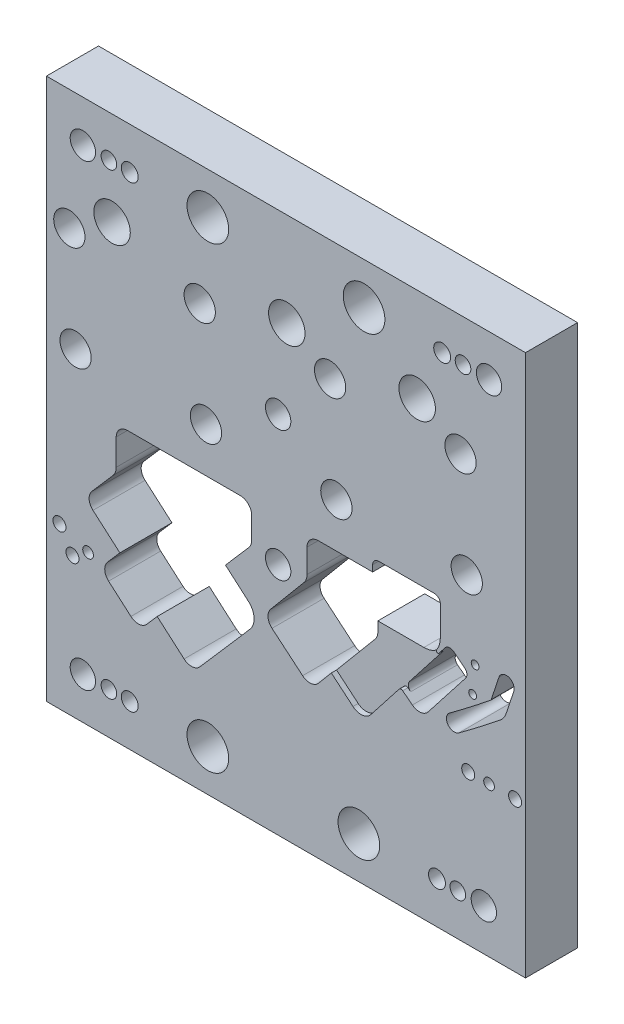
ISO-10303-21;
HEADER;
FILE_DESCRIPTION(('STEP AP214'),'2;1');
FILE_NAME('part.step','',(''),(''),'','','');
FILE_SCHEMA(('AUTOMOTIVE_DESIGN { 1 0 10303 214 1 1 1 1 }'));
ENDSEC;
DATA;
#1=APPLICATION_CONTEXT('core data for automotive mechanical design processes');
#2=APPLICATION_PROTOCOL_DEFINITION('international standard','automotive_design',2000,#1);
#3=PRODUCT_CONTEXT('',#1,'mechanical');
#4=PRODUCT('Part','Part','',(#3));
#5=PRODUCT_RELATED_PRODUCT_CATEGORY('part','',(#4));
#6=PRODUCT_DEFINITION_FORMATION('','',#4);
#7=PRODUCT_DEFINITION_CONTEXT('part definition',#1,'design');
#8=PRODUCT_DEFINITION('design','',#6,#7);
#9=PRODUCT_DEFINITION_SHAPE('','',#8);
#10=(LENGTH_UNIT() NAMED_UNIT(*) SI_UNIT(.MILLI.,.METRE.));
#11=(NAMED_UNIT(*) PLANE_ANGLE_UNIT() SI_UNIT($,.RADIAN.));
#12=(NAMED_UNIT(*) SI_UNIT($,.STERADIAN.) SOLID_ANGLE_UNIT());
#13=UNCERTAINTY_MEASURE_WITH_UNIT(LENGTH_MEASURE(1.E-05),#10,'distance_accuracy_value','');
#14=(GEOMETRIC_REPRESENTATION_CONTEXT(3) GLOBAL_UNCERTAINTY_ASSIGNED_CONTEXT((#13)) GLOBAL_UNIT_ASSIGNED_CONTEXT((#10,
#11,#12)) REPRESENTATION_CONTEXT('',''));
#15=CARTESIAN_POINT('',(0.,0.,0.));
#16=DIRECTION('',(0.,0.,1.));
#17=DIRECTION('',(1.,0.,0.));
#18=AXIS2_PLACEMENT_3D('',#15,#16,#17);
#19=CARTESIAN_POINT('',(-506.356245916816,-34.8275813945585,24.765));
#20=CARTESIAN_POINT('',(-506.356245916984,-34.8275813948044,24.9766666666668));
#21=CARTESIAN_POINT('',(-506.356245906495,-34.8275813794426,25.1883333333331));
#22=CARTESIAN_POINT('',(-506.356245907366,-34.8275813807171,26.4583333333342));
#23=CARTESIAN_POINT('',(-506.356245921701,-34.8275814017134,27.5166666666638));
#24=CARTESIAN_POINT('',(-506.356245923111,-34.8275814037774,29.6333333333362));
#25=CARTESIAN_POINT('',(-506.356245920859,-34.8275814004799,30.6916666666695));
#26=CARTESIAN_POINT('',(-506.356245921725,-34.8275814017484,31.9616666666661));
#27=CARTESIAN_POINT('',(-506.356245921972,-34.8275814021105,32.1733333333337));
#28=CARTESIAN_POINT('',(-506.356245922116,-34.8275814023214,32.385));
#29=CARTESIAN_POINT('',(-507.314513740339,-36.2310532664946,24.765));
#30=CARTESIAN_POINT('',(-507.314513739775,-36.2310532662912,24.9766666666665));
#31=CARTESIAN_POINT('',(-507.314513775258,-36.2310532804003,25.1883333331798));
#32=CARTESIAN_POINT('',(-507.314513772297,-36.2310532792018,26.4583333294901));
#33=CARTESIAN_POINT('',(-507.314513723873,-36.2310532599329,27.51666666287));
#34=CARTESIAN_POINT('',(-507.314513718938,-36.2310532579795,29.6333333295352));
#35=CARTESIAN_POINT('',(-507.314513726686,-36.2310532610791,30.6916666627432));
#36=CARTESIAN_POINT('',(-507.314513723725,-36.2310532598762,31.9616666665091));
#37=CARTESIAN_POINT('',(-507.314513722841,-36.231053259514,32.1733333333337));
#38=CARTESIAN_POINT('',(-507.314513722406,-36.2310532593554,32.385));
#39=CARTESIAN_POINT('',(-505.942493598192,-37.2338350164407,24.765));
#40=CARTESIAN_POINT('',(-505.942493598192,-37.2338350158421,24.9766666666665));
#41=CARTESIAN_POINT('',(-505.942493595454,-37.2338350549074,25.1883333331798));
#42=CARTESIAN_POINT('',(-505.942493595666,-37.2338350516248,26.4583333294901));
#43=CARTESIAN_POINT('',(-505.94249359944,-37.2338349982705,27.5166666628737));
#44=CARTESIAN_POINT('',(-505.94249359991,-37.2338349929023,29.6333333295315));
#45=CARTESIAN_POINT('',(-505.942493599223,-37.2338350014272,30.6916666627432));
#46=CARTESIAN_POINT('',(-505.942493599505,-37.2338349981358,31.9616666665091));
#47=CARTESIAN_POINT('',(-505.942493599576,-37.2338349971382,32.1733333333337));
#48=CARTESIAN_POINT('',(-505.9424935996,-37.2338349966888,32.385));
#49=CARTESIAN_POINT('',(-504.896229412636,-35.8946779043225,24.765));
#50=CARTESIAN_POINT('',(-504.896229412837,-35.8946779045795,24.9766666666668));
#51=CARTESIAN_POINT('',(-504.896229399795,-35.8946778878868,25.1883333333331));
#52=CARTESIAN_POINT('',(-504.896229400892,-35.8946778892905,26.4583333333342));
#53=CARTESIAN_POINT('',(-504.896229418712,-35.8946779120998,27.5166666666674));
#54=CARTESIAN_POINT('',(-504.896229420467,-35.8946779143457,29.6333333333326));
#55=CARTESIAN_POINT('',(-504.896229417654,-35.894677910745,30.6916666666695));
#56=CARTESIAN_POINT('',(-504.896229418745,-35.8946779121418,31.9616666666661));
#57=CARTESIAN_POINT('',(-504.896229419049,-35.894677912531,32.1733333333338));
#58=CARTESIAN_POINT('',(-504.896229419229,-35.8946779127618,32.385));
#59=(BOUNDED_SURFACE() B_SPLINE_SURFACE(3,3,((#19,#20,#21,#22,#23,#24,#25,#26,#27,#28),(#29,#30,
#31,#32,#33,#34,#35,#36,#37,#38),(#39,#40,#41,#42,#43,#44,#45,#46,#47,#48),(#49,#50,#51,#52,#53,
#54,#55,#56,#57,#58)),.UNSPECIFIED.,.F.,.F.,.F.) B_SPLINE_SURFACE_WITH_KNOTS((4,4),(4,2,2,2,4),
(0.,1.),(-1.2,-1.,0.,1.,1.2),
.UNSPECIFIED.) GEOMETRIC_REPRESENTATION_ITEM() RATIONAL_B_SPLINE_SURFACE(((1.,1.,1.,1.,1.,1.,1.,
1.,1.,1.),(0.354712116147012,0.354712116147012,0.354712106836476,0.354712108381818,
0.354712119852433,0.354712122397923,0.354712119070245,0.354712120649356,0.354712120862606,
0.354712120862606),(0.354712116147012,0.354712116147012,0.354712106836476,0.354712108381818,
0.354712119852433,0.354712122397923,0.354712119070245,0.354712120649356,0.354712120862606,
0.354712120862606),(1.,1.,1.,1.,1.,1.,1.,1.,1.,1.))) REPRESENTATION_ITEM('') SURFACE());
#60=CARTESIAN_POINT('',(-504.896229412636,-35.8946779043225,24.765));
#61=CARTESIAN_POINT('',(-504.896229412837,-35.8946779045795,24.9766666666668));
#62=CARTESIAN_POINT('',(-504.896229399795,-35.8946778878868,25.1883333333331));
#63=CARTESIAN_POINT('',(-504.896229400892,-35.8946778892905,26.4583333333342));
#64=CARTESIAN_POINT('',(-504.896229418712,-35.8946779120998,27.5166666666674));
#65=CARTESIAN_POINT('',(-504.896229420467,-35.8946779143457,29.6333333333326));
#66=CARTESIAN_POINT('',(-504.896229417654,-35.894677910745,30.6916666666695));
#67=CARTESIAN_POINT('',(-504.896229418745,-35.8946779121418,31.9616666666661));
#68=CARTESIAN_POINT('',(-504.896229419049,-35.894677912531,32.1733333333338));
#69=CARTESIAN_POINT('',(-504.896229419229,-35.8946779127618,32.385));
#70=(BOUNDED_CURVE() B_SPLINE_CURVE(3,(#60,#61,#62,#63,#64,#65,#66,#67,#68,#69),.UNSPECIFIED.,
.F.,.F.) B_SPLINE_CURVE_WITH_KNOTS((4,2,2,2,4),(-1.2,-1.,0.,1.,1.2),
.UNSPECIFIED.) CURVE() GEOMETRIC_REPRESENTATION_ITEM() RATIONAL_B_SPLINE_CURVE((1.,1.,1.,1.,1.,
1.,1.,1.,1.,1.)) REPRESENTATION_ITEM(''));
#71=CARTESIAN_POINT('',(-504.896229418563,-35.894677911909,31.75));
#72=VERTEX_POINT('',#71);
#73=CARTESIAN_POINT('',(-504.896229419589,-35.8946779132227,28.575));
#74=VERTEX_POINT('',#73);
#75=EDGE_CURVE('E1407',#72,#74,#70,.F.);
#76=CARTESIAN_POINT('',(-504.896229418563,-35.894677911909,31.75));
#77=CARTESIAN_POINT('',(-505.942493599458,-37.2338349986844,31.75));
#78=CARTESIAN_POINT('',(-507.314513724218,-36.2310532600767,31.75));
#79=CARTESIAN_POINT('',(-506.356245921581,-34.827581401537,31.75));
#80=(BOUNDED_CURVE() B_SPLINE_CURVE(3,(#76,#77,#78,#79),.UNSPECIFIED.,.F.,
.F.) B_SPLINE_CURVE_WITH_KNOTS((4,4),(0.,1.),
.UNSPECIFIED.) CURVE() GEOMETRIC_REPRESENTATION_ITEM() RATIONAL_B_SPLINE_CURVE((1.,
0.354712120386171,0.354712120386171,1.)) REPRESENTATION_ITEM(''));
#81=CARTESIAN_POINT('',(-506.356245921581,-34.827581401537,31.75));
#82=VERTEX_POINT('',#81);
#83=EDGE_CURVE('E66',#82,#72,#80,.F.);
#84=CARTESIAN_POINT('',(-506.356245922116,-34.8275814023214,32.385));
#85=CARTESIAN_POINT('',(-506.356245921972,-34.8275814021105,32.1733333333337));
#86=CARTESIAN_POINT('',(-506.356245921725,-34.8275814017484,31.9616666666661));
#87=CARTESIAN_POINT('',(-506.356245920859,-34.8275814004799,30.6916666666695));
#88=CARTESIAN_POINT('',(-506.356245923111,-34.8275814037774,29.6333333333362));
#89=CARTESIAN_POINT('',(-506.356245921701,-34.8275814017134,27.5166666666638));
#90=CARTESIAN_POINT('',(-506.356245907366,-34.8275813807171,26.4583333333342));
#91=CARTESIAN_POINT('',(-506.356245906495,-34.8275813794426,25.1883333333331));
#92=CARTESIAN_POINT('',(-506.356245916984,-34.8275813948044,24.9766666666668));
#93=CARTESIAN_POINT('',(-506.356245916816,-34.8275813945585,24.765));
#94=(BOUNDED_CURVE() B_SPLINE_CURVE(3,(#84,#85,#86,#87,#88,#89,#90,#91,#92,#93),.UNSPECIFIED.,
.F.,.F.) B_SPLINE_CURVE_WITH_KNOTS((4,2,2,2,4),(-1.2,-1.,0.,1.,1.2),
.UNSPECIFIED.) CURVE() GEOMETRIC_REPRESENTATION_ITEM() RATIONAL_B_SPLINE_CURVE((1.,1.,1.,1.,1.,
1.,1.,1.,1.,1.)) REPRESENTATION_ITEM(''));
#95=CARTESIAN_POINT('',(-506.356245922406,-34.8275814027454,28.575));
#96=VERTEX_POINT('',#95);
#97=EDGE_CURVE('E1283',#96,#82,#94,.F.);
#98=CARTESIAN_POINT('',(-506.356245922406,-34.8275814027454,28.575));
#99=CARTESIAN_POINT('',(-507.314513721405,-36.2310532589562,28.575));
#100=CARTESIAN_POINT('',(-505.942493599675,-37.2338349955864,28.575));
#101=CARTESIAN_POINT('',(-504.896229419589,-35.8946779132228,28.575));
#102=(BOUNDED_CURVE() B_SPLINE_CURVE(3,(#98,#99,#100,#101),.UNSPECIFIED.,.F.,
.F.) B_SPLINE_CURVE_WITH_KNOTS((4,4),(0.,1.),
.UNSPECIFIED.) CURVE() GEOMETRIC_REPRESENTATION_ITEM() RATIONAL_B_SPLINE_CURVE((1.,
0.354712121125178,0.354712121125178,1.)) REPRESENTATION_ITEM(''));
#103=EDGE_CURVE('E11',#74,#96,#102,.F.);
#104=ORIENTED_EDGE('',*,*,#75,.F.);
#105=ORIENTED_EDGE('',*,*,#83,.F.);
#106=ORIENTED_EDGE('',*,*,#97,.F.);
#107=ORIENTED_EDGE('',*,*,#103,.F.);
#108=EDGE_LOOP('',(#104,#105,#106,#107));
#109=FACE_BOUND('',#108,.T.);
#110=ADVANCED_FACE('F53',(#109),#59,.T.);
#111=CARTESIAN_POINT('',(-523.041675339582,-65.1226014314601,0.));
#112=DIRECTION('',(0.,0.,1.));
#113=DIRECTION('',(1.,0.,0.));
#114=AXIS2_PLACEMENT_3D('',#111,#112,#113);
#115=CYLINDRICAL_SURFACE('',#114,3.69570000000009);
#116=CARTESIAN_POINT('',(-523.041675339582,-65.1226014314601,28.575));
#117=DIRECTION('',(0.,0.,-1.));
#118=DIRECTION('',(1.,0.,0.));
#119=AXIS2_PLACEMENT_3D('',#116,#117,#118);
#120=CIRCLE('',#119,3.69570000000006);
#121=CARTESIAN_POINT('',(-525.316975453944,-68.0348527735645,28.575));
#122=VERTEX_POINT('',#121);
#123=CARTESIAN_POINT('',(-525.953926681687,-62.847301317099,28.575));
#124=VERTEX_POINT('',#123);
#125=EDGE_CURVE('E3142',#122,#124,#120,.T.);
#126=ORIENTED_EDGE('',*,*,#125,.F.);
#127=DIRECTION('',(0.,0.,1.));
#128=VECTOR('',#127,1.);
#129=CARTESIAN_POINT('',(-525.316975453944,-68.0348527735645,0.));
#130=LINE('',#129,#128);
#131=CARTESIAN_POINT('',(-525.316975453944,-68.0348527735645,0.));
#132=VERTEX_POINT('',#131);
#133=EDGE_CURVE('E2930',#132,#122,#130,.T.);
#134=ORIENTED_EDGE('',*,*,#133,.F.);
#135=CARTESIAN_POINT('',(-523.041675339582,-65.1226014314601,0.));
#136=DIRECTION('',(0.,0.,1.));
#137=DIRECTION('',(1.,0.,0.));
#138=AXIS2_PLACEMENT_3D('',#135,#136,#137);
#139=CIRCLE('',#138,3.69570000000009);
#140=CARTESIAN_POINT('',(-525.953926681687,-62.8473013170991,0.));
#141=VERTEX_POINT('',#140);
#142=EDGE_CURVE('E3109',#141,#132,#139,.T.);
#143=ORIENTED_EDGE('',*,*,#142,.F.);
#144=DIRECTION('',(0.,0.,1.));
#145=VECTOR('',#144,1.);
#146=CARTESIAN_POINT('',(-525.953926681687,-62.8473013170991,0.));
#147=LINE('',#146,#145);
#148=EDGE_CURVE('E2934',#141,#124,#147,.T.);
#149=ORIENTED_EDGE('',*,*,#148,.T.);
#150=EDGE_LOOP('',(#126,#134,#143,#149));
#151=FACE_BOUND('',#150,.T.);
#152=ADVANCED_FACE('F1306',(#151),#115,.F.);
#153=CARTESIAN_POINT('',(-545.331152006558,-40.5878402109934,0.));
#154=DIRECTION('',(0.,-1.,0.));
#155=DIRECTION('',(1.,0.,0.));
#156=AXIS2_PLACEMENT_3D('',#153,#154,#155);
#157=PLANE('',#156);
#158=DIRECTION('',(-1.,0.,0.));
#159=VECTOR('',#158,1.);
#160=CARTESIAN_POINT('',(-545.331152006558,-40.5878402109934,28.575));
#161=LINE('',#160,#159);
#162=CARTESIAN_POINT('',(-517.264152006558,-40.5878402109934,28.575));
#163=VERTEX_POINT('',#162);
#164=CARTESIAN_POINT('',(-545.331152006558,-40.5878402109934,28.575));
#165=VERTEX_POINT('',#164);
#166=EDGE_CURVE('E505',#163,#165,#161,.T.);
#167=ORIENTED_EDGE('',*,*,#166,.F.);
#168=DIRECTION('',(0.,0.,1.));
#169=VECTOR('',#168,1.);
#170=CARTESIAN_POINT('',(-517.264152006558,-40.5878402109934,0.));
#171=LINE('',#170,#169);
#172=CARTESIAN_POINT('',(-517.264152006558,-40.5878402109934,0.));
#173=VERTEX_POINT('',#172);
#174=EDGE_CURVE('E3072',#173,#163,#171,.T.);
#175=ORIENTED_EDGE('',*,*,#174,.F.);
#176=DIRECTION('',(1.,0.,0.));
#177=VECTOR('',#176,1.);
#178=CARTESIAN_POINT('',(-545.331152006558,-40.5878402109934,0.));
#179=LINE('',#178,#177);
#180=CARTESIAN_POINT('',(-545.331152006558,-40.5878402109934,0.));
#181=VERTEX_POINT('',#180);
#182=EDGE_CURVE('E1240',#181,#173,#179,.T.);
#183=ORIENTED_EDGE('',*,*,#182,.F.);
#184=DIRECTION('',(0.,0.,1.));
#185=VECTOR('',#184,1.);
#186=CARTESIAN_POINT('',(-545.331152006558,-40.5878402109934,0.));
#187=LINE('',#186,#185);
#188=EDGE_CURVE('E1265',#181,#165,#187,.T.);
#189=ORIENTED_EDGE('',*,*,#188,.T.);
#190=EDGE_LOOP('',(#167,#175,#183,#189));
#191=FACE_BOUND('',#190,.T.);
#192=ADVANCED_FACE('F1302',(#191),#157,.F.);
#193=CARTESIAN_POINT('',(-545.331152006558,-46.5969853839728,0.));
#194=DIRECTION('',(1.,0.,0.));
#195=DIRECTION('',(0.,0.,-1.));
#196=AXIS2_PLACEMENT_3D('',#193,#194,#195);
#197=PLANE('',#196);
#198=DIRECTION('',(0.,-1.,0.));
#199=VECTOR('',#198,1.);
#200=CARTESIAN_POINT('',(-545.331152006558,-46.5969853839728,28.575));
#201=LINE('',#200,#199);
#202=CARTESIAN_POINT('',(-545.331152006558,-46.5969853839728,28.575));
#203=VERTEX_POINT('',#202);
#204=EDGE_CURVE('E498',#165,#203,#201,.T.);
#205=ORIENTED_EDGE('',*,*,#204,.F.);
#206=ORIENTED_EDGE('',*,*,#188,.F.);
#207=DIRECTION('',(0.,1.,0.));
#208=VECTOR('',#207,1.);
#209=CARTESIAN_POINT('',(-545.331152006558,-46.5969853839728,0.));
#210=LINE('',#209,#208);
#211=CARTESIAN_POINT('',(-545.331152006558,-46.5969853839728,0.));
#212=VERTEX_POINT('',#211);
#213=EDGE_CURVE('E1128',#212,#181,#210,.T.);
#214=ORIENTED_EDGE('',*,*,#213,.F.);
#215=DIRECTION('',(0.,0.,1.));
#216=VECTOR('',#215,1.);
#217=CARTESIAN_POINT('',(-545.331152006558,-46.5969853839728,0.));
#218=LINE('',#217,#216);
#219=EDGE_CURVE('E1168',#212,#203,#218,.T.);
#220=ORIENTED_EDGE('',*,*,#219,.T.);
#221=EDGE_LOOP('',(#205,#206,#214,#220));
#222=FACE_BOUND('',#221,.T.);
#223=ADVANCED_FACE('F1305',(#222),#197,.F.);
#224=CARTESIAN_POINT('',(-552.189152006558,-46.5969853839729,0.));
#225=DIRECTION('',(0.,0.,1.));
#226=DIRECTION('',(1.,0.,0.));
#227=AXIS2_PLACEMENT_3D('',#224,#225,#226);
#228=CYLINDRICAL_SURFACE('',#227,6.85799999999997);
#229=CARTESIAN_POINT('',(-552.189152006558,-46.5969853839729,28.575));
#230=DIRECTION('',(0.,0.,-1.));
#231=DIRECTION('',(1.,0.,0.));
#232=AXIS2_PLACEMENT_3D('',#229,#230,#231);
#233=CIRCLE('',#232,6.85799999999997);
#234=CARTESIAN_POINT('',(-546.935619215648,-51.0052228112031,28.575));
#235=VERTEX_POINT('',#234);
#236=EDGE_CURVE('E488',#203,#235,#233,.T.);
#237=ORIENTED_EDGE('',*,*,#236,.F.);
#238=ORIENTED_EDGE('',*,*,#219,.F.);
#239=CARTESIAN_POINT('',(-552.189152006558,-46.5969853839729,0.));
#240=DIRECTION('',(0.,0.,1.));
#241=DIRECTION('',(1.,0.,0.));
#242=AXIS2_PLACEMENT_3D('',#239,#240,#241);
#243=CIRCLE('',#242,6.85799999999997);
#244=CARTESIAN_POINT('',(-546.935619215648,-51.0052228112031,0.));
#245=VERTEX_POINT('',#244);
#246=EDGE_CURVE('E1124',#245,#212,#243,.T.);
#247=ORIENTED_EDGE('',*,*,#246,.F.);
#248=DIRECTION('',(0.,0.,1.));
#249=VECTOR('',#248,1.);
#250=CARTESIAN_POINT('',(-546.935619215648,-51.0052228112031,0.));
#251=LINE('',#250,#249);
#252=EDGE_CURVE('E1202',#245,#235,#251,.T.);
#253=ORIENTED_EDGE('',*,*,#252,.T.);
#254=EDGE_LOOP('',(#237,#238,#247,#253));
#255=FACE_BOUND('',#254,.T.);
#256=ADVANCED_FACE('F1813',(#255),#228,.F.);
#257=CARTESIAN_POINT('',(-452.12,-180.975,31.75));
#258=DIRECTION('',(-1.,0.,0.));
#259=DIRECTION('',(0.,0.,1.));
#260=AXIS2_PLACEMENT_3D('',#257,#258,#259);
#261=PLANE('',#260);
#262=DIRECTION('',(0.,1.,0.));
#263=VECTOR('',#262,1.);
#264=CARTESIAN_POINT('',(-452.12,-180.975,0.));
#265=LINE('',#264,#263);
#266=CARTESIAN_POINT('',(-452.12,-180.975,0.));
#267=VERTEX_POINT('',#266);
#268=CARTESIAN_POINT('',(-452.12,149.225,0.));
#269=VERTEX_POINT('',#268);
#270=EDGE_CURVE('E2843',#267,#269,#265,.T.);
#271=ORIENTED_EDGE('',*,*,#270,.T.);
#272=DIRECTION('',(0.,0.,-1.));
#273=VECTOR('',#272,1.);
#274=CARTESIAN_POINT('',(-452.12,149.225,31.75));
#275=LINE('',#274,#273);
#276=CARTESIAN_POINT('',(-452.12,149.225,31.75));
#277=VERTEX_POINT('',#276);
#278=EDGE_CURVE('E2846',#277,#269,#275,.T.);
#279=ORIENTED_EDGE('',*,*,#278,.F.);
#280=DIRECTION('',(0.,1.,0.));
#281=VECTOR('',#280,1.);
#282=CARTESIAN_POINT('',(-452.12,-180.975,31.75));
#283=LINE('',#282,#281);
#284=CARTESIAN_POINT('',(-452.12,-180.975,31.75));
#285=VERTEX_POINT('',#284);
#286=EDGE_CURVE('E2872',#285,#277,#283,.T.);
#287=ORIENTED_EDGE('',*,*,#286,.F.);
#288=DIRECTION('',(0.,0.,-1.));
#289=VECTOR('',#288,1.);
#290=CARTESIAN_POINT('',(-452.12,-180.975,31.75));
#291=LINE('',#290,#289);
#292=EDGE_CURVE('E2848',#285,#267,#291,.T.);
#293=ORIENTED_EDGE('',*,*,#292,.T.);
#294=EDGE_LOOP('',(#271,#279,#287,#293));
#295=FACE_BOUND('',#294,.T.);
#296=ADVANCED_FACE('F1817',(#295),#261,.F.);
#297=CARTESIAN_POINT('',(-452.12,149.225,31.75));
#298=DIRECTION('',(0.,-1.,0.));
#299=DIRECTION('',(0.,0.,-1.));
#300=AXIS2_PLACEMENT_3D('',#297,#298,#299);
#301=PLANE('',#300);
#302=DIRECTION('',(-1.,0.,0.));
#303=VECTOR('',#302,1.);
#304=CARTESIAN_POINT('',(-452.12,149.225,0.));
#305=LINE('',#304,#303);
#306=CARTESIAN_POINT('',(-744.22,149.225,0.));
#307=VERTEX_POINT('',#306);
#308=EDGE_CURVE('E2852',#269,#307,#305,.T.);
#309=ORIENTED_EDGE('',*,*,#308,.T.);
#310=DIRECTION('',(0.,0.,-1.));
#311=VECTOR('',#310,1.);
#312=CARTESIAN_POINT('',(-744.22,149.225,31.75));
#313=LINE('',#312,#311);
#314=CARTESIAN_POINT('',(-744.22,149.225,31.75));
#315=VERTEX_POINT('',#314);
#316=EDGE_CURVE('E2879',#315,#307,#313,.T.);
#317=ORIENTED_EDGE('',*,*,#316,.F.);
#318=DIRECTION('',(-1.,0.,0.));
#319=VECTOR('',#318,1.);
#320=CARTESIAN_POINT('',(-452.12,149.225,31.75));
#321=LINE('',#320,#319);
#322=EDGE_CURVE('E3052',#277,#315,#321,.T.);
#323=ORIENTED_EDGE('',*,*,#322,.F.);
#324=ORIENTED_EDGE('',*,*,#278,.T.);
#325=EDGE_LOOP('',(#309,#317,#323,#324));
#326=FACE_BOUND('',#325,.T.);
#327=ADVANCED_FACE('F2559',(#326),#301,.F.);
#328=CARTESIAN_POINT('',(-744.22,-180.975,31.75));
#329=DIRECTION('',(1.,0.,0.));
#330=DIRECTION('',(0.,0.,-1.));
#331=AXIS2_PLACEMENT_3D('',#328,#329,#330);
#332=PLANE('',#331);
#333=DIRECTION('',(0.,-1.,0.));
#334=VECTOR('',#333,1.);
#335=CARTESIAN_POINT('',(-744.22,-180.975,0.));
#336=LINE('',#335,#334);
#337=CARTESIAN_POINT('',(-744.22,-180.975,0.));
#338=VERTEX_POINT('',#337);
#339=EDGE_CURVE('E2858',#307,#338,#336,.T.);
#340=ORIENTED_EDGE('',*,*,#339,.T.);
#341=DIRECTION('',(0.,0.,-1.));
#342=VECTOR('',#341,1.);
#343=CARTESIAN_POINT('',(-744.22,-180.975,31.75));
#344=LINE('',#343,#342);
#345=CARTESIAN_POINT('',(-744.22,-180.975,31.75));
#346=VERTEX_POINT('',#345);
#347=EDGE_CURVE('E2875',#346,#338,#344,.T.);
#348=ORIENTED_EDGE('',*,*,#347,.F.);
#349=DIRECTION('',(0.,-1.,0.));
#350=VECTOR('',#349,1.);
#351=CARTESIAN_POINT('',(-744.22,-180.975,31.75));
#352=LINE('',#351,#350);
#353=EDGE_CURVE('E3054',#315,#346,#352,.T.);
#354=ORIENTED_EDGE('',*,*,#353,.F.);
#355=ORIENTED_EDGE('',*,*,#316,.T.);
#356=EDGE_LOOP('',(#340,#348,#354,#355));
#357=FACE_BOUND('',#356,.T.);
#358=ADVANCED_FACE('F2551',(#357),#332,.F.);
#359=CARTESIAN_POINT('',(-452.12,-180.975,31.75));
#360=DIRECTION('',(0.,1.,0.));
#361=DIRECTION('',(-1.,0.,0.));
#362=AXIS2_PLACEMENT_3D('',#359,#360,#361);
#363=PLANE('',#362);
#364=DIRECTION('',(1.,0.,0.));
#365=VECTOR('',#364,1.);
#366=CARTESIAN_POINT('',(-452.12,-180.975,0.));
#367=LINE('',#366,#365);
#368=EDGE_CURVE('E2869',#338,#267,#367,.T.);
#369=ORIENTED_EDGE('',*,*,#368,.T.);
#370=ORIENTED_EDGE('',*,*,#292,.F.);
#371=DIRECTION('',(1.,0.,0.));
#372=VECTOR('',#371,1.);
#373=CARTESIAN_POINT('',(-452.12,-180.975,31.75));
#374=LINE('',#373,#372);
#375=EDGE_CURVE('E2864',#346,#285,#374,.T.);
#376=ORIENTED_EDGE('',*,*,#375,.F.);
#377=ORIENTED_EDGE('',*,*,#347,.T.);
#378=EDGE_LOOP('',(#369,#370,#376,#377));
#379=FACE_BOUND('',#378,.T.);
#380=ADVANCED_FACE('F1393',(#379),#363,.F.);
#381=CARTESIAN_POINT('',(0.,0.,31.75));
#382=DIRECTION('',(0.,0.,1.));
#383=DIRECTION('',(1.,0.,0.));
#384=AXIS2_PLACEMENT_3D('',#381,#382,#383);
#385=PLANE('',#384);
#386=CARTESIAN_POINT('',(-517.264152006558,-27.3798402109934,31.75));
#387=DIRECTION('',(0.,0.,1.));
#388=DIRECTION('',(1.,0.,0.));
#389=AXIS2_PLACEMENT_3D('',#386,#387,#388);
#390=CIRCLE('',#389,13.2079999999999);
#391=CARTESIAN_POINT('',(-504.056152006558,-27.3798402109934,31.75));
#392=VERTEX_POINT('',#391);
#393=EDGE_CURVE('E1269',#82,#392,#390,.T.);
#394=ORIENTED_EDGE('',*,*,#393,.F.);
#395=ORIENTED_EDGE('',*,*,#83,.T.);
#396=DIRECTION('',(-0.615661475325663,-0.788010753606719,0.));
#397=VECTOR('',#396,1.);
#398=CARTESIAN_POINT('',(-501.168011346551,-31.1227763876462,31.75));
#399=LINE('',#398,#397);
#400=CARTESIAN_POINT('',(-501.168011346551,-31.1227763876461,31.75));
#401=VERTEX_POINT('',#400);
#402=EDGE_CURVE('E2885',#401,#72,#399,.T.);
#403=ORIENTED_EDGE('',*,*,#402,.F.);
#404=CARTESIAN_POINT('',(-498.255760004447,-33.3980765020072,31.75));
#405=DIRECTION('',(0.,0.,1.));
#406=DIRECTION('',(1.,0.,0.));
#407=AXIS2_PLACEMENT_3D('',#404,#405,#406);
#408=CIRCLE('',#407,3.69570000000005);
#409=CARTESIAN_POINT('',(-495.980459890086,-30.4858251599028,31.75));
#410=VERTEX_POINT('',#409);
#411=EDGE_CURVE('E2889',#410,#401,#408,.T.);
#412=ORIENTED_EDGE('',*,*,#411,.F.);
#413=DIRECTION('',(-0.788010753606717,0.615661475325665,0.));
#414=VECTOR('',#413,1.);
#415=CARTESIAN_POINT('',(-489.275276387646,-35.7244886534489,31.75));
#416=LINE('',#415,#414);
#417=CARTESIAN_POINT('',(-489.275276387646,-35.7244886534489,31.75));
#418=VERTEX_POINT('',#417);
#419=EDGE_CURVE('E2909',#418,#410,#416,.T.);
#420=ORIENTED_EDGE('',*,*,#419,.F.);
#421=CARTESIAN_POINT('',(-491.550576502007,-38.6367399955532,31.75));
#422=DIRECTION('',(0.,0.,1.));
#423=DIRECTION('',(1.,0.,0.));
#424=AXIS2_PLACEMENT_3D('',#421,#422,#423);
#425=CIRCLE('',#424,3.69569999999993);
#426=CARTESIAN_POINT('',(-488.638325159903,-40.9120401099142,31.75));
#427=VERTEX_POINT('',#426);
#428=EDGE_CURVE('E2905',#427,#418,#425,.T.);
#429=ORIENTED_EDGE('',*,*,#428,.F.);
#430=DIRECTION('',(0.61566147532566,0.788010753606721,0.));
#431=VECTOR('',#430,1.);
#432=CARTESIAN_POINT('',(-511.46951531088,-70.1346308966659,31.75));
#433=LINE('',#432,#431);
#434=CARTESIAN_POINT('',(-511.46951531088,-70.1346308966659,31.75));
#435=VERTEX_POINT('',#434);
#436=EDGE_CURVE('E2901',#435,#427,#433,.T.);
#437=ORIENTED_EDGE('',*,*,#436,.F.);
#438=CARTESIAN_POINT('',(-516.883700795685,-65.9046055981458,31.75));
#439=DIRECTION('',(0.,0.,1.));
#440=DIRECTION('',(1.,0.,0.));
#441=AXIS2_PLACEMENT_3D('',#438,#439,#440);
#442=CIRCLE('',#441,6.87070000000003);
#443=CARTESIAN_POINT('',(-521.113726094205,-71.3187910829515,31.75));
#444=VERTEX_POINT('',#443);
#445=EDGE_CURVE('E2897',#444,#435,#442,.T.);
#446=ORIENTED_EDGE('',*,*,#445,.F.);
#447=DIRECTION('',(0.788010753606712,-0.615661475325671,0.));
#448=VECTOR('',#447,1.);
#449=CARTESIAN_POINT('',(-525.316975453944,-68.0348527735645,31.75));
#450=LINE('',#449,#448);
#451=CARTESIAN_POINT('',(-526.978259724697,-66.7369152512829,31.75));
#452=VERTEX_POINT('',#451);
#453=EDGE_CURVE('E2888',#452,#444,#450,.T.);
#454=ORIENTED_EDGE('',*,*,#453,.F.);
#455=CARTESIAN_POINT('',(-527.955622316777,-67.9878823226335,31.75));
#456=DIRECTION('',(0.,0.,-1.));
#457=DIRECTION('',(1.,0.,0.));
#458=AXIS2_PLACEMENT_3D('',#455,#456,#457);
#459=CIRCLE('',#458,1.58749999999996);
#460=CARTESIAN_POINT('',(-529.206589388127,-67.0105197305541,31.75));
#461=VERTEX_POINT('',#460);
#462=EDGE_CURVE('E3207',#461,#452,#459,.T.);
#463=ORIENTED_EDGE('',*,*,#462,.F.);
#464=DIRECTION('',(0.615661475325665,0.788010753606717,0.));
#465=VECTOR('',#464,1.);
#466=CARTESIAN_POINT('',(-529.206589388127,-67.0105197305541,31.75));
#467=LINE('',#466,#465);
#468=CARTESIAN_POINT('',(-546.413966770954,-89.0349584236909,31.75));
#469=VERTEX_POINT('',#468);
#470=EDGE_CURVE('E3203',#469,#461,#467,.T.);
#471=ORIENTED_EDGE('',*,*,#470,.F.);
#472=CARTESIAN_POINT('',(-552.418608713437,-84.3436179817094,31.75));
#473=DIRECTION('',(0.,0.,1.));
#474=DIRECTION('',(1.,0.,0.));
#475=AXIS2_PLACEMENT_3D('',#472,#473,#474);
#476=CIRCLE('',#475,7.61999999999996);
#477=CARTESIAN_POINT('',(-557.316650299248,-90.1808766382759,31.75));
#478=VERTEX_POINT('',#477);
#479=EDGE_CURVE('E3199',#478,#469,#476,.T.);
#480=ORIENTED_EDGE('',*,*,#479,.F.);
#481=DIRECTION('',(0.76604444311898,-0.642787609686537,0.));
#482=VECTOR('',#481,1.);
#483=CARTESIAN_POINT('',(-570.515055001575,-79.1061001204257,31.75));
#484=LINE('',#483,#482);
#485=CARTESIAN_POINT('',(-570.515055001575,-79.1061001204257,31.75));
#486=VERTEX_POINT('',#485);
#487=EDGE_CURVE('E3196',#486,#478,#484,.T.);
#488=ORIENTED_EDGE('',*,*,#487,.F.);
#489=DIRECTION('',(0.642787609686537,0.76604444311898,0.));
#490=VECTOR('',#489,1.);
#491=CARTESIAN_POINT('',(-578.351921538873,-88.4457139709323,31.75));
#492=LINE('',#491,#490);
#493=CARTESIAN_POINT('',(-578.351921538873,-88.4457139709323,31.75));
#494=VERTEX_POINT('',#493);
#495=EDGE_CURVE('E496',#494,#486,#492,.T.);
#496=ORIENTED_EDGE('',*,*,#495,.F.);
#497=CARTESIAN_POINT('',(-583.605454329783,-84.037476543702,31.75));
#498=DIRECTION('',(0.,0.,1.));
#499=DIRECTION('',(1.,0.,0.));
#500=AXIS2_PLACEMENT_3D('',#497,#498,#499);
#501=CIRCLE('',#500,6.85799999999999);
#502=CARTESIAN_POINT('',(-588.013691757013,-89.2910093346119,31.75));
#503=VERTEX_POINT('',#502);
#504=EDGE_CURVE('E1196',#503,#494,#501,.T.);
#505=ORIENTED_EDGE('',*,*,#504,.F.);
#506=DIRECTION('',(0.766044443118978,-0.64278760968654,0.));
#507=VECTOR('',#506,1.);
#508=CARTESIAN_POINT('',(-606.692919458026,-73.6172762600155,31.75));
#509=LINE('',#508,#507);
#510=CARTESIAN_POINT('',(-606.692919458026,-73.6172762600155,31.75));
#511=VERTEX_POINT('',#510);
#512=EDGE_CURVE('E1192',#511,#503,#509,.T.);
#513=ORIENTED_EDGE('',*,*,#512,.F.);
#514=CARTESIAN_POINT('',(-602.284682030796,-68.3637434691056,31.75));
#515=DIRECTION('',(0.,0.,1.));
#516=DIRECTION('',(1.,0.,0.));
#517=AXIS2_PLACEMENT_3D('',#514,#515,#516);
#518=CIRCLE('',#517,6.8580000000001);
#519=CARTESIAN_POINT('',(-607.538214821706,-63.9555060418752,31.75));
#520=VERTEX_POINT('',#519);
#521=EDGE_CURVE('E1188',#520,#511,#518,.T.);
#522=ORIENTED_EDGE('',*,*,#521,.F.);
#523=DIRECTION('',(-0.642787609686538,-0.766044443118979,0.));
#524=VECTOR('',#523,1.);
#525=CARTESIAN_POINT('',(-587.237742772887,-39.7623455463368,31.75));
#526=LINE('',#525,#524);
#527=CARTESIAN_POINT('',(-587.237742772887,-39.7623455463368,31.75));
#528=VERTEX_POINT('',#527);
#529=EDGE_CURVE('E1184',#528,#520,#526,.T.);
#530=ORIENTED_EDGE('',*,*,#529,.F.);
#531=CARTESIAN_POINT('',(-593.464152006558,-34.5377678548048,31.75));
#532=DIRECTION('',(0.,0.,-1.));
#533=DIRECTION('',(1.,0.,0.));
#534=AXIS2_PLACEMENT_3D('',#531,#532,#533);
#535=CIRCLE('',#534,8.12799999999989);
#536=CARTESIAN_POINT('',(-585.336152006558,-34.5377678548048,31.75));
#537=VERTEX_POINT('',#536);
#538=EDGE_CURVE('E1180',#537,#528,#535,.T.);
#539=ORIENTED_EDGE('',*,*,#538,.F.);
#540=DIRECTION('',(0.,-1.,0.));
#541=VECTOR('',#540,1.);
#542=CARTESIAN_POINT('',(-585.336152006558,-20.0578728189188,31.75));
#543=LINE('',#542,#541);
#544=CARTESIAN_POINT('',(-585.336152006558,-20.0578728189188,31.75));
#545=VERTEX_POINT('',#544);
#546=EDGE_CURVE('E1176',#545,#537,#543,.T.);
#547=ORIENTED_EDGE('',*,*,#546,.F.);
#548=CARTESIAN_POINT('',(-578.478152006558,-20.0578728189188,31.75));
#549=DIRECTION('',(0.,0.,1.));
#550=DIRECTION('',(1.,0.,0.));
#551=AXIS2_PLACEMENT_3D('',#548,#549,#550);
#552=CIRCLE('',#551,6.85800000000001);
#553=CARTESIAN_POINT('',(-578.478152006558,-13.1998728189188,31.75));
#554=VERTEX_POINT('',#553);
#555=EDGE_CURVE('E1172',#554,#545,#552,.T.);
#556=ORIENTED_EDGE('',*,*,#555,.F.);
#557=DIRECTION('',(-1.,0.,0.));
#558=VECTOR('',#557,1.);
#559=CARTESIAN_POINT('',(-545.331152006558,-13.1998728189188,31.75));
#560=LINE('',#559,#558);
#561=CARTESIAN_POINT('',(-545.331152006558,-13.1998728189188,31.75));
#562=VERTEX_POINT('',#561);
#563=EDGE_CURVE('E1108',#562,#554,#560,.T.);
#564=ORIENTED_EDGE('',*,*,#563,.F.);
#565=DIRECTION('',(0.,-1.,0.));
#566=VECTOR('',#565,1.);
#567=CARTESIAN_POINT('',(-545.331152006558,-9.34584021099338,31.75));
#568=LINE('',#567,#566);
#569=CARTESIAN_POINT('',(-545.331152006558,-9.34584021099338,31.75));
#570=VERTEX_POINT('',#569);
#571=EDGE_CURVE('E1205',#570,#562,#568,.T.);
#572=ORIENTED_EDGE('',*,*,#571,.F.);
#573=CARTESIAN_POINT('',(-541.648152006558,-9.34584021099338,31.75));
#574=DIRECTION('',(0.,0.,1.));
#575=DIRECTION('',(1.,0.,0.));
#576=AXIS2_PLACEMENT_3D('',#573,#574,#575);
#577=CIRCLE('',#576,3.68299999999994);
#578=CARTESIAN_POINT('',(-541.648152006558,-5.66284021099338,31.75));
#579=VERTEX_POINT('',#578);
#580=EDGE_CURVE('E1241',#579,#570,#577,.T.);
#581=ORIENTED_EDGE('',*,*,#580,.F.);
#582=DIRECTION('',(-1.,0.,0.));
#583=VECTOR('',#582,1.);
#584=CARTESIAN_POINT('',(-507.739152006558,-5.6628402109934,31.75));
#585=LINE('',#584,#583);
#586=CARTESIAN_POINT('',(-507.739152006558,-5.66284021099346,31.75));
#587=VERTEX_POINT('',#586);
#588=EDGE_CURVE('E3168',#587,#579,#585,.T.);
#589=ORIENTED_EDGE('',*,*,#588,.F.);
#590=CARTESIAN_POINT('',(-507.739152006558,-9.3458402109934,31.75));
#591=DIRECTION('',(0.,0.,1.));
#592=DIRECTION('',(1.,0.,0.));
#593=AXIS2_PLACEMENT_3D('',#590,#591,#592);
#594=CIRCLE('',#593,3.68299999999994);
#595=CARTESIAN_POINT('',(-504.056152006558,-9.3458402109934,31.75));
#596=VERTEX_POINT('',#595);
#597=EDGE_CURVE('E3171',#596,#587,#594,.T.);
#598=ORIENTED_EDGE('',*,*,#597,.F.);
#599=DIRECTION('',(0.,1.,0.));
#600=VECTOR('',#599,1.);
#601=CARTESIAN_POINT('',(-504.056152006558,-27.3798402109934,31.75));
#602=LINE('',#601,#600);
#603=EDGE_CURVE('E1272',#392,#596,#602,.T.);
#604=ORIENTED_EDGE('',*,*,#603,.F.);
#605=EDGE_LOOP('',(#394,#395,#403,#412,#420,#429,#437,#446,#454,#463,#471,#480,#488,#496,#505,
#513,#522,#530,#539,#547,#556,#564,#572,#581,#589,#598,#604));
#606=FACE_BOUND('',#605,.T.);
#607=CARTESIAN_POINT('',(-484.346782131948,-47.2994414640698,31.75));
#608=DIRECTION('',(0.,0.,1.));
#609=DIRECTION('',(1.,0.,0.));
#610=AXIS2_PLACEMENT_3D('',#607,#608,#609);
#611=CIRCLE('',#610,2.38125);
#612=CARTESIAN_POINT('',(-481.965532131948,-47.2994414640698,31.75));
#613=VERTEX_POINT('',#612);
#614=EDGE_CURVE('E513',#613,#613,#611,.T.);
#615=ORIENTED_EDGE('',*,*,#614,.F.);
#616=EDGE_LOOP('',(#615));
#617=FACE_BOUND('',#616,.T.);
#618=CARTESIAN_POINT('',(-482.821795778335,-31.0085922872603,31.75));
#619=DIRECTION('',(0.,0.,1.));
#620=DIRECTION('',(1.,0.,0.));
#621=AXIS2_PLACEMENT_3D('',#618,#619,#620);
#622=CIRCLE('',#621,2.38125);
#623=CARTESIAN_POINT('',(-480.440545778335,-31.0085922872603,31.75));
#624=VERTEX_POINT('',#623);
#625=EDGE_CURVE('E522',#624,#624,#622,.T.);
#626=ORIENTED_EDGE('',*,*,#625,.F.);
#627=EDGE_LOOP('',(#626));
#628=FACE_BOUND('',#627,.T.);
#629=CARTESIAN_POINT('',(-693.42,123.825,31.75));
#630=DIRECTION('',(0.,0.,1.));
#631=DIRECTION('',(1.,0.,0.));
#632=AXIS2_PLACEMENT_3D('',#629,#630,#631);
#633=CIRCLE('',#632,5.15937499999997);
#634=CARTESIAN_POINT('',(-688.260625,123.825,31.75));
#635=VERTEX_POINT('',#634);
#636=EDGE_CURVE('E538',#635,#635,#633,.T.);
#637=ORIENTED_EDGE('',*,*,#636,.F.);
#638=EDGE_LOOP('',(#637));
#639=FACE_BOUND('',#638,.T.);
#640=CARTESIAN_POINT('',(-502.92,123.825,31.75));
#641=DIRECTION('',(0.,0.,1.));
#642=DIRECTION('',(1.,0.,0.));
#643=AXIS2_PLACEMENT_3D('',#640,#641,#642);
#644=CIRCLE('',#643,5.15937500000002);
#645=CARTESIAN_POINT('',(-497.760625,123.825,31.75));
#646=VERTEX_POINT('',#645);
#647=EDGE_CURVE('E554',#646,#646,#644,.T.);
#648=ORIENTED_EDGE('',*,*,#647,.F.);
#649=EDGE_LOOP('',(#648));
#650=FACE_BOUND('',#649,.T.);
#651=CARTESIAN_POINT('',(-506.095,-155.575,31.75));
#652=DIRECTION('',(0.,0.,1.));
#653=DIRECTION('',(1.,0.,0.));
#654=AXIS2_PLACEMENT_3D('',#651,#652,#653);
#655=CIRCLE('',#654,5.15937499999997);
#656=CARTESIAN_POINT('',(-500.935625,-155.575,31.75));
#657=VERTEX_POINT('',#656);
#658=EDGE_CURVE('E570',#657,#657,#655,.T.);
#659=ORIENTED_EDGE('',*,*,#658,.F.);
#660=EDGE_LOOP('',(#659));
#661=FACE_BOUND('',#660,.T.);
#662=CARTESIAN_POINT('',(-693.42,-155.575,31.75));
#663=DIRECTION('',(0.,0.,1.));
#664=DIRECTION('',(1.,0.,0.));
#665=AXIS2_PLACEMENT_3D('',#662,#663,#664);
#666=CIRCLE('',#665,5.15937499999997);
#667=CARTESIAN_POINT('',(-688.260625,-155.575,31.75));
#668=VERTEX_POINT('',#667);
#669=EDGE_CURVE('E586',#668,#668,#666,.T.);
#670=ORIENTED_EDGE('',*,*,#669,.F.);
#671=EDGE_LOOP('',(#670));
#672=FACE_BOUND('',#671,.T.);
#673=CARTESIAN_POINT('',(-493.395,-155.575,31.75));
#674=DIRECTION('',(0.,0.,-1.));
#675=DIRECTION('',(-1.,0.,0.));
#676=AXIS2_PLACEMENT_3D('',#673,#674,#675);
#677=CIRCLE('',#676,4.7625);
#678=CARTESIAN_POINT('',(-498.1575,-155.575,31.75));
#679=VERTEX_POINT('',#678);
#680=EDGE_CURVE('E590',#679,#679,#677,.T.);
#681=ORIENTED_EDGE('',*,*,#680,.T.);
#682=EDGE_LOOP('',(#681));
#683=FACE_BOUND('',#682,.T.);
#684=CARTESIAN_POINT('',(-706.12,-155.575,31.75));
#685=DIRECTION('',(0.,0.,-1.));
#686=DIRECTION('',(-1.,0.,0.));
#687=AXIS2_PLACEMENT_3D('',#684,#685,#686);
#688=CIRCLE('',#687,4.7625);
#689=CARTESIAN_POINT('',(-710.8825,-155.575,31.75));
#690=VERTEX_POINT('',#689);
#691=EDGE_CURVE('E598',#690,#690,#688,.T.);
#692=ORIENTED_EDGE('',*,*,#691,.T.);
#693=EDGE_LOOP('',(#692));
#694=FACE_BOUND('',#693,.T.);
#695=CARTESIAN_POINT('',(-706.12,123.825,31.75));
#696=DIRECTION('',(0.,0.,-1.));
#697=DIRECTION('',(-1.,0.,0.));
#698=AXIS2_PLACEMENT_3D('',#695,#696,#697);
#699=CIRCLE('',#698,4.7625);
#700=CARTESIAN_POINT('',(-710.8825,123.825,31.75));
#701=VERTEX_POINT('',#700);
#702=EDGE_CURVE('E606',#701,#701,#699,.T.);
#703=ORIENTED_EDGE('',*,*,#702,.T.);
#704=EDGE_LOOP('',(#703));
#705=FACE_BOUND('',#704,.T.);
#706=CARTESIAN_POINT('',(-490.22,123.825,31.75));
#707=DIRECTION('',(0.,0.,-1.));
#708=DIRECTION('',(-1.,0.,0.));
#709=AXIS2_PLACEMENT_3D('',#706,#707,#708);
#710=CIRCLE('',#709,4.7625);
#711=CARTESIAN_POINT('',(-494.9825,123.825,31.75));
#712=VERTEX_POINT('',#711);
#713=EDGE_CURVE('E614',#712,#712,#710,.T.);
#714=ORIENTED_EDGE('',*,*,#713,.T.);
#715=EDGE_LOOP('',(#714));
#716=FACE_BOUND('',#715,.T.);
#717=CARTESIAN_POINT('',(-645.795,123.825,31.75));
#718=DIRECTION('',(0.,0.,-1.));
#719=DIRECTION('',(-1.,0.,0.));
#720=AXIS2_PLACEMENT_3D('',#717,#718,#719);
#721=CIRCLE('',#720,12.7);
#722=CARTESIAN_POINT('',(-658.495,123.825,31.75));
#723=VERTEX_POINT('',#722);
#724=EDGE_CURVE('E634',#723,#723,#721,.T.);
#725=ORIENTED_EDGE('',*,*,#724,.T.);
#726=EDGE_LOOP('',(#725));
#727=FACE_BOUND('',#726,.T.);
#728=CARTESIAN_POINT('',(-550.545,123.825,31.75));
#729=DIRECTION('',(0.,0.,-1.));
#730=DIRECTION('',(-1.,0.,0.));
#731=AXIS2_PLACEMENT_3D('',#728,#729,#730);
#732=CIRCLE('',#731,12.7);
#733=CARTESIAN_POINT('',(-563.245,123.825,31.75));
#734=VERTEX_POINT('',#733);
#735=EDGE_CURVE('E650',#734,#734,#732,.T.);
#736=ORIENTED_EDGE('',*,*,#735,.T.);
#737=EDGE_LOOP('',(#736));
#738=FACE_BOUND('',#737,.T.);
#739=CARTESIAN_POINT('',(-553.72,-155.575,31.75));
#740=DIRECTION('',(0.,0.,-1.));
#741=DIRECTION('',(-1.,0.,0.));
#742=AXIS2_PLACEMENT_3D('',#739,#740,#741);
#743=CIRCLE('',#742,12.7);
#744=CARTESIAN_POINT('',(-566.42,-155.575,31.75));
#745=VERTEX_POINT('',#744);
#746=EDGE_CURVE('E666',#745,#745,#743,.T.);
#747=ORIENTED_EDGE('',*,*,#746,.T.);
#748=EDGE_LOOP('',(#747));
#749=FACE_BOUND('',#748,.T.);
#750=CARTESIAN_POINT('',(-645.795,-155.575,31.75));
#751=DIRECTION('',(0.,0.,-1.));
#752=DIRECTION('',(-1.,0.,0.));
#753=AXIS2_PLACEMENT_3D('',#750,#751,#752);
#754=CIRCLE('',#753,12.7);
#755=CARTESIAN_POINT('',(-658.495,-155.575,31.75));
#756=VERTEX_POINT('',#755);
#757=EDGE_CURVE('E682',#756,#756,#754,.T.);
#758=ORIENTED_EDGE('',*,*,#757,.T.);
#759=EDGE_LOOP('',(#758));
#760=FACE_BOUND('',#759,.T.);
#761=CARTESIAN_POINT('',(-477.52,-155.575,31.75));
#762=DIRECTION('',(0.,0.,1.));
#763=DIRECTION('',(1.,0.,0.));
#764=AXIS2_PLACEMENT_3D('',#761,#762,#763);
#765=CIRCLE('',#764,7.73429999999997);
#766=CARTESIAN_POINT('',(-469.7857,-155.575,31.75));
#767=VERTEX_POINT('',#766);
#768=EDGE_CURVE('E698',#767,#767,#765,.T.);
#769=ORIENTED_EDGE('',*,*,#768,.F.);
#770=EDGE_LOOP('',(#769));
#771=FACE_BOUND('',#770,.T.);
#772=CARTESIAN_POINT('',(-474.345,123.825,31.75));
#773=DIRECTION('',(0.,0.,1.));
#774=DIRECTION('',(1.,0.,0.));
#775=AXIS2_PLACEMENT_3D('',#772,#773,#774);
#776=CIRCLE('',#775,7.73430000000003);
#777=CARTESIAN_POINT('',(-466.6107,123.825,31.75));
#778=VERTEX_POINT('',#777);
#779=EDGE_CURVE('E714',#778,#778,#776,.T.);
#780=ORIENTED_EDGE('',*,*,#779,.F.);
#781=EDGE_LOOP('',(#780));
#782=FACE_BOUND('',#781,.T.);
#783=CARTESIAN_POINT('',(-721.995,123.825,31.75));
#784=DIRECTION('',(0.,0.,1.));
#785=DIRECTION('',(1.,0.,0.));
#786=AXIS2_PLACEMENT_3D('',#783,#784,#785);
#787=CIRCLE('',#786,7.73429999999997);
#788=CARTESIAN_POINT('',(-714.2607,123.825,31.75));
#789=VERTEX_POINT('',#788);
#790=EDGE_CURVE('E730',#789,#789,#787,.T.);
#791=ORIENTED_EDGE('',*,*,#790,.F.);
#792=EDGE_LOOP('',(#791));
#793=FACE_BOUND('',#792,.T.);
#794=CARTESIAN_POINT('',(-721.995,-155.575,31.75));
#795=DIRECTION('',(0.,0.,1.));
#796=DIRECTION('',(1.,0.,0.));
#797=AXIS2_PLACEMENT_3D('',#794,#795,#796);
#798=CIRCLE('',#797,7.73429999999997);
#799=CARTESIAN_POINT('',(-714.2607,-155.575,31.75));
#800=VERTEX_POINT('',#799);
#801=EDGE_CURVE('E746',#800,#800,#798,.T.);
#802=ORIENTED_EDGE('',*,*,#801,.F.);
#803=EDGE_LOOP('',(#802));
#804=FACE_BOUND('',#803,.T.);
#805=CARTESIAN_POINT('',(-602.9325,41.275,31.75));
#806=DIRECTION('',(0.,0.,1.));
#807=DIRECTION('',(1.,0.,0.));
#808=AXIS2_PLACEMENT_3D('',#805,#806,#807);
#809=CIRCLE('',#808,7.73429999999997);
#810=CARTESIAN_POINT('',(-595.1982,41.275,31.75));
#811=VERTEX_POINT('',#810);
#812=EDGE_CURVE('E762',#811,#811,#809,.T.);
#813=ORIENTED_EDGE('',*,*,#812,.F.);
#814=EDGE_LOOP('',(#813));
#815=FACE_BOUND('',#814,.T.);
#816=CARTESIAN_POINT('',(-602.9325,-38.1,31.75));
#817=DIRECTION('',(0.,0.,1.));
#818=DIRECTION('',(1.,0.,0.));
#819=AXIS2_PLACEMENT_3D('',#816,#817,#818);
#820=CIRCLE('',#819,7.73429999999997);
#821=CARTESIAN_POINT('',(-595.1982,-38.1,31.75));
#822=VERTEX_POINT('',#821);
#823=EDGE_CURVE('E778',#822,#822,#820,.T.);
#824=ORIENTED_EDGE('',*,*,#823,.F.);
#825=EDGE_LOOP('',(#824));
#826=FACE_BOUND('',#825,.T.);
#827=CARTESIAN_POINT('',(-728.345,-95.9484788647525,31.75));
#828=DIRECTION('',(0.,0.,-1.));
#829=DIRECTION('',(-1.,0.,0.));
#830=AXIS2_PLACEMENT_3D('',#827,#828,#829);
#831=CIRCLE('',#830,3.96874999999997);
#832=CARTESIAN_POINT('',(-732.31375,-95.9484788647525,31.75));
#833=VERTEX_POINT('',#832);
#834=EDGE_CURVE('E782',#833,#833,#831,.T.);
#835=ORIENTED_EDGE('',*,*,#834,.T.);
#836=EDGE_LOOP('',(#835));
#837=FACE_BOUND('',#836,.T.);
#838=CARTESIAN_POINT('',(-736.2825,-83.2484788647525,31.75));
#839=DIRECTION('',(0.,0.,-1.));
#840=DIRECTION('',(-1.,0.,0.));
#841=AXIS2_PLACEMENT_3D('',#838,#839,#840);
#842=CIRCLE('',#841,3.96874999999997);
#843=CARTESIAN_POINT('',(-740.25125,-83.2484788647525,31.75));
#844=VERTEX_POINT('',#843);
#845=EDGE_CURVE('E790',#844,#844,#842,.T.);
#846=ORIENTED_EDGE('',*,*,#845,.T.);
#847=EDGE_LOOP('',(#846));
#848=FACE_BOUND('',#847,.T.);
#849=CARTESIAN_POINT('',(-718.82,-89.5984788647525,31.75));
#850=DIRECTION('',(0.,0.,1.));
#851=DIRECTION('',(1.,0.,0.));
#852=AXIS2_PLACEMENT_3D('',#849,#850,#851);
#853=CIRCLE('',#852,3.26389999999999);
#854=CARTESIAN_POINT('',(-715.5561,-89.5984788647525,31.75));
#855=VERTEX_POINT('',#854);
#856=EDGE_CURVE('E802',#855,#855,#853,.T.);
#857=ORIENTED_EDGE('',*,*,#856,.F.);
#858=EDGE_LOOP('',(#857));
#859=FACE_BOUND('',#858,.T.);
#860=CARTESIAN_POINT('',(-487.045,-89.6018579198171,31.75));
#861=DIRECTION('',(0.,0.,-1.));
#862=DIRECTION('',(-1.,0.,0.));
#863=AXIS2_PLACEMENT_3D('',#860,#861,#862);
#864=CIRCLE('',#863,3.96874999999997);
#865=CARTESIAN_POINT('',(-491.01375,-89.6018579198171,31.75));
#866=VERTEX_POINT('',#865);
#867=EDGE_CURVE('E806',#866,#866,#864,.T.);
#868=ORIENTED_EDGE('',*,*,#867,.T.);
#869=EDGE_LOOP('',(#868));
#870=FACE_BOUND('',#869,.T.);
#871=CARTESIAN_POINT('',(-458.47,-89.6018579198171,31.75));
#872=DIRECTION('',(0.,0.,-1.));
#873=DIRECTION('',(-1.,0.,0.));
#874=AXIS2_PLACEMENT_3D('',#871,#872,#873);
#875=CIRCLE('',#874,3.96874999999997);
#876=CARTESIAN_POINT('',(-462.43875,-89.6018579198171,31.75));
#877=VERTEX_POINT('',#876);
#878=EDGE_CURVE('E814',#877,#877,#875,.T.);
#879=ORIENTED_EDGE('',*,*,#878,.T.);
#880=EDGE_LOOP('',(#879));
#881=FACE_BOUND('',#880,.T.);
#882=CARTESIAN_POINT('',(-474.345,-89.6018579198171,31.75));
#883=DIRECTION('',(0.,0.,1.));
#884=DIRECTION('',(1.,0.,0.));
#885=AXIS2_PLACEMENT_3D('',#882,#883,#884);
#886=CIRCLE('',#885,3.26389999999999);
#887=CARTESIAN_POINT('',(-471.0811,-89.6018579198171,31.75));
#888=VERTEX_POINT('',#887);
#889=EDGE_CURVE('E826',#888,#888,#886,.T.);
#890=ORIENTED_EDGE('',*,*,#889,.F.);
#891=EDGE_LOOP('',(#890));
#892=FACE_BOUND('',#891,.T.);
#893=CARTESIAN_POINT('',(-491.744,75.8952,31.75));
#894=DIRECTION('',(0.,0.,-1.));
#895=DIRECTION('',(-1.,0.,0.));
#896=AXIS2_PLACEMENT_3D('',#893,#894,#895);
#897=CIRCLE('',#896,9.53769999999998);
#898=CARTESIAN_POINT('',(-501.2817,75.8952,31.75));
#899=VERTEX_POINT('',#898);
#900=EDGE_CURVE('E830',#899,#899,#897,.T.);
#901=ORIENTED_EDGE('',*,*,#900,.T.);
#902=EDGE_LOOP('',(#901));
#903=FACE_BOUND('',#902,.T.);
#904=CARTESIAN_POINT('',(-567.436,13.97,31.75));
#905=DIRECTION('',(0.,0.,-1.));
#906=DIRECTION('',(-1.,0.,0.));
#907=AXIS2_PLACEMENT_3D('',#904,#905,#906);
#908=CIRCLE('',#907,9.53769999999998);
#909=CARTESIAN_POINT('',(-576.9737,13.97,31.75));
#910=VERTEX_POINT('',#909);
#911=EDGE_CURVE('E838',#910,#910,#908,.T.);
#912=ORIENTED_EDGE('',*,*,#911,.T.);
#913=EDGE_LOOP('',(#912));
#914=FACE_BOUND('',#913,.T.);
#915=CARTESIAN_POINT('',(-571.246,75.8952,31.75));
#916=DIRECTION('',(0.,0.,-1.));
#917=DIRECTION('',(-1.,0.,0.));
#918=AXIS2_PLACEMENT_3D('',#915,#916,#917);
#919=CIRCLE('',#918,9.53769999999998);
#920=CARTESIAN_POINT('',(-580.7837,75.8952,31.75));
#921=VERTEX_POINT('',#920);
#922=EDGE_CURVE('E846',#921,#921,#919,.T.);
#923=ORIENTED_EDGE('',*,*,#922,.T.);
#924=EDGE_LOOP('',(#923));
#925=FACE_BOUND('',#924,.T.);
#926=CARTESIAN_POINT('',(-650.748,75.8952,31.75));
#927=DIRECTION('',(0.,0.,-1.));
#928=DIRECTION('',(-1.,0.,0.));
#929=AXIS2_PLACEMENT_3D('',#926,#927,#928);
#930=CIRCLE('',#929,9.53769999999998);
#931=CARTESIAN_POINT('',(-660.2857,75.8952,31.75));
#932=VERTEX_POINT('',#931);
#933=EDGE_CURVE('E854',#932,#932,#930,.T.);
#934=ORIENTED_EDGE('',*,*,#933,.T.);
#935=EDGE_LOOP('',(#934));
#936=FACE_BOUND('',#935,.T.);
#937=CARTESIAN_POINT('',(-646.938,13.97,31.75));
#938=DIRECTION('',(0.,0.,-1.));
#939=DIRECTION('',(-1.,0.,0.));
#940=AXIS2_PLACEMENT_3D('',#937,#938,#939);
#941=CIRCLE('',#940,9.53769999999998);
#942=CARTESIAN_POINT('',(-656.4757,13.97,31.75));
#943=VERTEX_POINT('',#942);
#944=EDGE_CURVE('E862',#943,#943,#941,.T.);
#945=ORIENTED_EDGE('',*,*,#944,.T.);
#946=EDGE_LOOP('',(#945));
#947=FACE_BOUND('',#946,.T.);
#948=CARTESIAN_POINT('',(-730.25,75.8952,31.75));
#949=DIRECTION('',(0.,0.,-1.));
#950=DIRECTION('',(-1.,0.,0.));
#951=AXIS2_PLACEMENT_3D('',#948,#949,#950);
#952=CIRCLE('',#951,9.53769999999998);
#953=CARTESIAN_POINT('',(-739.7877,75.8952,31.75));
#954=VERTEX_POINT('',#953);
#955=EDGE_CURVE('E870',#954,#954,#952,.T.);
#956=ORIENTED_EDGE('',*,*,#955,.T.);
#957=EDGE_LOOP('',(#956));
#958=FACE_BOUND('',#957,.T.);
#959=CARTESIAN_POINT('',(-726.44,13.97,31.75));
#960=DIRECTION('',(0.,0.,-1.));
#961=DIRECTION('',(-1.,0.,0.));
#962=AXIS2_PLACEMENT_3D('',#959,#960,#961);
#963=CIRCLE('',#962,9.53769999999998);
#964=CARTESIAN_POINT('',(-735.9777,13.97,31.75));
#965=VERTEX_POINT('',#964);
#966=EDGE_CURVE('E878',#965,#965,#963,.T.);
#967=ORIENTED_EDGE('',*,*,#966,.T.);
#968=EDGE_LOOP('',(#967));
#969=FACE_BOUND('',#968,.T.);
#970=CARTESIAN_POINT('',(-487.934,13.97,31.75));
#971=DIRECTION('',(0.,0.,-1.));
#972=DIRECTION('',(-1.,0.,0.));
#973=AXIS2_PLACEMENT_3D('',#970,#971,#972);
#974=CIRCLE('',#973,9.53769999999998);
#975=CARTESIAN_POINT('',(-497.4717,13.97,31.75));
#976=VERTEX_POINT('',#975);
#977=EDGE_CURVE('E886',#976,#976,#974,.T.);
#978=ORIENTED_EDGE('',*,*,#977,.T.);
#979=EDGE_LOOP('',(#978));
#980=FACE_BOUND('',#979,.T.);
#981=DIRECTION('',(0.755030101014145,-0.655690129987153,0.));
#982=VECTOR('',#981,1.);
#983=CARTESIAN_POINT('',(-715.836786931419,-65.8955238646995,31.75));
#984=LINE('',#983,#982);
#985=CARTESIAN_POINT('',(-715.836786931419,-65.8955238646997,31.75));
#986=VERTEX_POINT('',#985);
#987=CARTESIAN_POINT('',(-699.439798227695,-80.1351464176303,31.75));
#988=VERTEX_POINT('',#987);
#989=EDGE_CURVE('E900',#986,#988,#984,.T.);
#990=ORIENTED_EDGE('',*,*,#989,.F.);
#991=CARTESIAN_POINT('',(-711.340064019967,-60.7175274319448,31.75));
#992=DIRECTION('',(0.,0.,1.));
#993=DIRECTION('',(1.,0.,0.));
#994=AXIS2_PLACEMENT_3D('',#991,#992,#993);
#995=CIRCLE('',#994,6.85800000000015);
#996=CARTESIAN_POINT('',(-716.518060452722,-56.2208045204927,31.75));
#997=VERTEX_POINT('',#996);
#998=EDGE_CURVE('E936',#997,#986,#995,.T.);
#999=ORIENTED_EDGE('',*,*,#998,.F.);
#1000=DIRECTION('',(-0.655690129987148,-0.75503010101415,0.));
#1001=VECTOR('',#1000,1.);
#1002=CARTESIAN_POINT('',(-703.666115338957,-41.4217325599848,31.75));
#1003=LINE('',#1002,#1001);
#1004=CARTESIAN_POINT('',(-703.666115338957,-41.4217325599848,31.75));
#1005=VERTEX_POINT('',#1004);
#1006=EDGE_CURVE('E932',#1005,#997,#1003,.T.);
#1007=ORIENTED_EDGE('',*,*,#1006,.F.);
#1008=CARTESIAN_POINT('',(-709.803,-36.0922831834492,31.75));
#1009=DIRECTION('',(0.,0.,-1.));
#1010=DIRECTION('',(1.,0.,0.));
#1011=AXIS2_PLACEMENT_3D('',#1008,#1009,#1010);
#1012=CIRCLE('',#1011,8.12800000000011);
#1013=CARTESIAN_POINT('',(-701.675,-36.0922831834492,31.75));
#1014=VERTEX_POINT('',#1013);
#1015=EDGE_CURVE('E928',#1014,#1005,#1012,.T.);
#1016=ORIENTED_EDGE('',*,*,#1015,.F.);
#1017=DIRECTION('',(0.,-1.,0.));
#1018=VECTOR('',#1017,1.);
#1019=CARTESIAN_POINT('',(-701.675,-20.0578728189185,31.75));
#1020=LINE('',#1019,#1018);
#1021=CARTESIAN_POINT('',(-701.675,-20.0578728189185,31.75));
#1022=VERTEX_POINT('',#1021);
#1023=EDGE_CURVE('E924',#1022,#1014,#1020,.T.);
#1024=ORIENTED_EDGE('',*,*,#1023,.F.);
#1025=CARTESIAN_POINT('',(-694.817,-20.0578728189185,31.75));
#1026=DIRECTION('',(0.,0.,1.));
#1027=DIRECTION('',(1.,0.,0.));
#1028=AXIS2_PLACEMENT_3D('',#1025,#1026,#1027);
#1029=CIRCLE('',#1028,6.85800000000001);
#1030=CARTESIAN_POINT('',(-694.817,-13.1998728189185,31.75));
#1031=VERTEX_POINT('',#1030);
#1032=EDGE_CURVE('E894',#1031,#1022,#1029,.T.);
#1033=ORIENTED_EDGE('',*,*,#1032,.F.);
#1034=DIRECTION('',(-1.,0.,0.));
#1035=VECTOR('',#1034,1.);
#1036=CARTESIAN_POINT('',(-625.983,-13.1998728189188,31.75));
#1037=LINE('',#1036,#1035);
#1038=CARTESIAN_POINT('',(-625.983,-13.1998728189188,31.75));
#1039=VERTEX_POINT('',#1038);
#1040=EDGE_CURVE('E1047',#1039,#1031,#1037,.T.);
#1041=ORIENTED_EDGE('',*,*,#1040,.F.);
#1042=CARTESIAN_POINT('',(-625.983,-20.0578728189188,31.75));
#1043=DIRECTION('',(0.,0.,1.));
#1044=DIRECTION('',(1.,0.,0.));
#1045=AXIS2_PLACEMENT_3D('',#1042,#1043,#1044);
#1046=CIRCLE('',#1045,6.85799999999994);
#1047=CARTESIAN_POINT('',(-619.125,-20.0578728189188,31.75));
#1048=VERTEX_POINT('',#1047);
#1049=EDGE_CURVE('E1043',#1048,#1039,#1046,.T.);
#1050=ORIENTED_EDGE('',*,*,#1049,.F.);
#1051=DIRECTION('',(0.,1.,0.));
#1052=VECTOR('',#1051,1.);
#1053=CARTESIAN_POINT('',(-619.125,-33.5123708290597,31.75));
#1054=LINE('',#1053,#1052);
#1055=CARTESIAN_POINT('',(-619.125,-33.5123708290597,31.75));
#1056=VERTEX_POINT('',#1055);
#1057=EDGE_CURVE('E1039',#1056,#1048,#1054,.T.);
#1058=ORIENTED_EDGE('',*,*,#1057,.F.);
#1059=CARTESIAN_POINT('',(-625.983,-33.5123708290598,31.75));
#1060=DIRECTION('',(0.,0.,1.));
#1061=DIRECTION('',(1.,0.,0.));
#1062=AXIS2_PLACEMENT_3D('',#1059,#1060,#1061);
#1063=CIRCLE('',#1062,6.85800000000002);
#1064=CARTESIAN_POINT('',(-620.805003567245,-38.0090937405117,31.75));
#1065=VERTEX_POINT('',#1064);
#1066=EDGE_CURVE('E1035',#1065,#1056,#1063,.T.);
#1067=ORIENTED_EDGE('',*,*,#1066,.F.);
#1068=DIRECTION('',(0.65569012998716,0.755030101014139,0.));
#1069=VECTOR('',#1068,1.);
#1070=CARTESIAN_POINT('',(-658.377463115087,-81.2739480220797,31.75));
#1071=LINE('',#1070,#1069);
#1072=CARTESIAN_POINT('',(-635.041885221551,-54.4029262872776,31.75));
#1073=VERTEX_POINT('',#1072);
#1074=EDGE_CURVE('E999',#1073,#1065,#1071,.T.);
#1075=ORIENTED_EDGE('',*,*,#1074,.F.);
#1076=DIRECTION('',(-0.755030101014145,0.655690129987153,0.));
#1077=VECTOR('',#1076,1.);
#1078=CARTESIAN_POINT('',(-621.042117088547,-66.560732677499,31.75));
#1079=LINE('',#1078,#1077);
#1080=CARTESIAN_POINT('',(-621.042117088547,-66.560732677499,31.75));
#1081=VERTEX_POINT('',#1080);
#1082=EDGE_CURVE('E1070',#1081,#1073,#1079,.T.);
#1083=ORIENTED_EDGE('',*,*,#1082,.F.);
#1084=CARTESIAN_POINT('',(-627.620656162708,-74.1359496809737,31.75));
#1085=DIRECTION('',(0.,0.,1.));
#1086=DIRECTION('',(1.,0.,0.));
#1087=AXIS2_PLACEMENT_3D('',#1084,#1085,#1086);
#1088=CIRCLE('',#1087,10.0329999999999);
#1089=CARTESIAN_POINT('',(-620.045439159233,-80.7144887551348,31.75));
#1090=VERTEX_POINT('',#1089);
#1091=EDGE_CURVE('E1098',#1090,#1081,#1088,.T.);
#1092=ORIENTED_EDGE('',*,*,#1091,.F.);
#1093=DIRECTION('',(0.655690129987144,0.755030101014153,0.));
#1094=VECTOR('',#1093,1.);
#1095=CARTESIAN_POINT('',(-650.606500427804,-115.905686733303,31.75));
#1096=LINE('',#1095,#1094);
#1097=CARTESIAN_POINT('',(-650.606500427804,-115.905686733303,31.75));
#1098=VERTEX_POINT('',#1097);
#1099=EDGE_CURVE('E1094',#1098,#1090,#1096,.T.);
#1100=ORIENTED_EDGE('',*,*,#1099,.F.);
#1101=CARTESIAN_POINT('',(-655.784496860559,-111.408963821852,31.75));
#1102=DIRECTION('',(0.,0.,1.));
#1103=DIRECTION('',(1.,0.,0.));
#1104=AXIS2_PLACEMENT_3D('',#1101,#1102,#1103);
#1105=CIRCLE('',#1104,6.85800000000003);
#1106=CARTESIAN_POINT('',(-660.281219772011,-116.586960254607,31.75));
#1107=VERTEX_POINT('',#1106);
#1108=EDGE_CURVE('E1090',#1107,#1098,#1105,.T.);
#1109=ORIENTED_EDGE('',*,*,#1108,.F.);
#1110=DIRECTION('',(0.755030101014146,-0.655690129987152,0.));
#1111=VECTOR('',#1110,1.);
#1112=CARTESIAN_POINT('',(-676.678208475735,-102.347337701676,31.75));
#1113=LINE('',#1112,#1111);
#1114=CARTESIAN_POINT('',(-676.678208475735,-102.347337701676,31.75));
#1115=VERTEX_POINT('',#1114);
#1116=EDGE_CURVE('E1055',#1115,#1107,#1113,.T.);
#1117=ORIENTED_EDGE('',*,*,#1116,.F.);
#1118=DIRECTION('',(0.655690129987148,0.755030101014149,0.));
#1119=VECTOR('',#1118,1.);
#1120=CARTESIAN_POINT('',(-683.026166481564,-109.657039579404,31.75));
#1121=LINE('',#1120,#1119);
#1122=CARTESIAN_POINT('',(-683.026166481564,-109.657039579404,31.75));
#1123=VERTEX_POINT('',#1122);
#1124=EDGE_CURVE('E970',#1123,#1115,#1121,.T.);
#1125=ORIENTED_EDGE('',*,*,#1124,.F.);
#1126=CARTESIAN_POINT('',(-688.204162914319,-105.160316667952,31.75));
#1127=DIRECTION('',(0.,0.,1.));
#1128=DIRECTION('',(1.,0.,0.));
#1129=AXIS2_PLACEMENT_3D('',#1126,#1127,#1128);
#1130=CIRCLE('',#1129,6.85799999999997);
#1131=CARTESIAN_POINT('',(-692.700885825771,-110.338313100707,31.75));
#1132=VERTEX_POINT('',#1131);
#1133=EDGE_CURVE('E990',#1132,#1123,#1130,.T.);
#1134=ORIENTED_EDGE('',*,*,#1133,.F.);
#1135=DIRECTION('',(0.755030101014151,-0.655690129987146,0.));
#1136=VECTOR('',#1135,1.);
#1137=CARTESIAN_POINT('',(-706.31709866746,-98.5135972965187,31.75));
#1138=LINE('',#1137,#1136);
#1139=CARTESIAN_POINT('',(-706.31709866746,-98.5135972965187,31.75));
#1140=VERTEX_POINT('',#1139);
#1141=EDGE_CURVE('E986',#1140,#1132,#1138,.T.);
#1142=ORIENTED_EDGE('',*,*,#1141,.F.);
#1143=CARTESIAN_POINT('',(-701.820375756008,-93.3356008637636,31.75));
#1144=DIRECTION('',(0.,0.,1.));
#1145=DIRECTION('',(1.,0.,0.));
#1146=AXIS2_PLACEMENT_3D('',#1143,#1144,#1145);
#1147=CIRCLE('',#1146,6.85799999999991);
#1148=CARTESIAN_POINT('',(-706.998372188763,-88.8388779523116,31.75));
#1149=VERTEX_POINT('',#1148);
#1150=EDGE_CURVE('E946',#1149,#1140,#1147,.T.);
#1151=ORIENTED_EDGE('',*,*,#1150,.F.);
#1152=DIRECTION('',(-0.655690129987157,-0.755030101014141,0.));
#1153=VECTOR('',#1152,1.);
#1154=CARTESIAN_POINT('',(-665.441670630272,-40.9861512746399,31.75));
#1155=LINE('',#1154,#1153);
#1156=EDGE_CURVE('E1014',#988,#1149,#1155,.T.);
#1157=ORIENTED_EDGE('',*,*,#1156,.F.);
#1158=EDGE_LOOP('',(#990,#999,#1007,#1016,#1024,#1033,#1041,#1050,#1058,#1067,#1075,#1083,#1092,
#1100,#1109,#1117,#1125,#1134,#1142,#1151,#1157));
#1159=FACE_BOUND('',#1158,.T.);
#1160=CARTESIAN_POINT('',(-463.795238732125,-31.75,31.75));
#1161=DIRECTION('',(0.,0.,1.));
#1162=DIRECTION('',(1.,0.,0.));
#1163=AXIS2_PLACEMENT_3D('',#1160,#1161,#1162);
#1164=CIRCLE('',#1163,4.76250000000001);
#1165=CARTESIAN_POINT('',(-459.275981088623,-33.252569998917,31.75));
#1166=VERTEX_POINT('',#1165);
#1167=CARTESIAN_POINT('',(-468.314496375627,-30.247430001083,31.75));
#1168=VERTEX_POINT('',#1167);
#1169=EDGE_CURVE('E2917',#1166,#1168,#1164,.T.);
#1170=ORIENTED_EDGE('',*,*,#1169,.F.);
#1171=DIRECTION('',(0.315500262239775,0.948925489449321,0.));
#1172=VECTOR('',#1171,1.);
#1173=CARTESIAN_POINT('',(-463.969987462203,-47.3706637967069,31.75));
#1174=LINE('',#1173,#1172);
#1175=CARTESIAN_POINT('',(-463.969987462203,-47.3706637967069,31.75));
#1176=VERTEX_POINT('',#1175);
#1177=EDGE_CURVE('E2948',#1176,#1166,#1174,.T.);
#1178=ORIENTED_EDGE('',*,*,#1177,.F.);
#1179=CARTESIAN_POINT('',(-474.213638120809,-43.9648384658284,31.75));
#1180=DIRECTION('',(0.,0.,1.));
#1181=DIRECTION('',(1.,0.,0.));
#1182=AXIS2_PLACEMENT_3D('',#1179,#1180,#1181);
#1183=CIRCLE('',#1182,10.7950000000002);
#1184=CARTESIAN_POINT('',(-467.434976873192,-52.3661345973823,31.75));
#1185=VERTEX_POINT('',#1184);
#1186=EDGE_CURVE('E2999',#1185,#1176,#1183,.T.);
#1187=ORIENTED_EDGE('',*,*,#1186,.F.);
#1188=CARTESIAN_POINT('',(-912.977322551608,499.827439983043,31.75));
#1189=DIRECTION('',(0.,0.,1.));
#1190=DIRECTION('',(1.,0.,0.));
#1191=AXIS2_PLACEMENT_3D('',#1188,#1189,#1190);
#1192=CIRCLE('',#1191,709.524999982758);
#1193=CARTESIAN_POINT('',(-492.748014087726,-71.8657066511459,31.75));
#1194=VERTEX_POINT('',#1193);
#1195=EDGE_CURVE('E2995',#1194,#1185,#1192,.T.);
#1196=ORIENTED_EDGE('',*,*,#1195,.F.);
#1197=CARTESIAN_POINT('',(-495.568692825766,-68.0283667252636,31.75));
#1198=DIRECTION('',(0.,0.,1.));
#1199=DIRECTION('',(1.,0.,0.));
#1200=AXIS2_PLACEMENT_3D('',#1197,#1198,#1199);
#1201=CIRCLE('',#1200,4.76250000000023);
#1202=CARTESIAN_POINT('',(-498.389371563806,-64.1910267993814,31.75));
#1203=VERTEX_POINT('',#1202);
#1204=EDGE_CURVE('E2991',#1203,#1194,#1201,.T.);
#1205=ORIENTED_EDGE('',*,*,#1204,.F.);
#1206=CARTESIAN_POINT('',(-912.977322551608,499.827439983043,31.75));
#1207=DIRECTION('',(0.,0.,-1.));
#1208=DIRECTION('',(1.,0.,0.));
#1209=AXIS2_PLACEMENT_3D('',#1206,#1207,#1208);
#1210=CIRCLE('',#1209,699.999999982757);
#1211=CARTESIAN_POINT('',(-473.416148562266,-44.953226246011,31.75));
#1212=VERTEX_POINT('',#1211);
#1213=EDGE_CURVE('E2987',#1212,#1203,#1210,.T.);
#1214=ORIENTED_EDGE('',*,*,#1213,.F.);
#1215=CARTESIAN_POINT('',(-474.213638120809,-43.9648384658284,31.75));
#1216=DIRECTION('',(0.,0.,-1.));
#1217=DIRECTION('',(1.,0.,0.));
#1218=AXIS2_PLACEMENT_3D('',#1215,#1216,#1217);
#1219=CIRCLE('',#1218,1.26999999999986);
#1220=CARTESIAN_POINT('',(-473.008502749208,-44.3655237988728,31.75));
#1221=VERTEX_POINT('',#1220);
#1222=EDGE_CURVE('E2983',#1221,#1212,#1219,.T.);
#1223=ORIENTED_EDGE('',*,*,#1222,.F.);
#1224=DIRECTION('',(-0.31550026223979,-0.948925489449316,0.));
#1225=VECTOR('',#1224,1.);
#1226=CARTESIAN_POINT('',(-468.314496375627,-30.247430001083,31.75));
#1227=LINE('',#1226,#1225);
#1228=EDGE_CURVE('E2979',#1168,#1221,#1227,.T.);
#1229=ORIENTED_EDGE('',*,*,#1228,.F.);
#1230=EDGE_LOOP('',(#1170,#1178,#1187,#1196,#1205,#1214,#1223,#1229));
#1231=FACE_BOUND('',#1230,.T.);
#1232=CARTESIAN_POINT('',(-518.16,92.075,31.75));
#1233=DIRECTION('',(0.,0.,1.));
#1234=DIRECTION('',(1.,0.,0.));
#1235=AXIS2_PLACEMENT_3D('',#1232,#1233,#1234);
#1236=CIRCLE('',#1235,11.1251999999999);
#1237=CARTESIAN_POINT('',(-507.0348,92.075,31.75));
#1238=VERTEX_POINT('',#1237);
#1239=EDGE_CURVE('E3034',#1238,#1238,#1236,.T.);
#1240=ORIENTED_EDGE('',*,*,#1239,.F.);
#1241=EDGE_LOOP('',(#1240));
#1242=FACE_BOUND('',#1241,.T.);
#1243=CARTESIAN_POINT('',(-597.662,92.075,31.75));
#1244=DIRECTION('',(0.,0.,1.));
#1245=DIRECTION('',(1.,0.,0.));
#1246=AXIS2_PLACEMENT_3D('',#1243,#1244,#1245);
#1247=CIRCLE('',#1246,11.1251999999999);
#1248=CARTESIAN_POINT('',(-586.5368,92.075,31.75));
#1249=VERTEX_POINT('',#1248);
#1250=EDGE_CURVE('E3042',#1249,#1249,#1247,.T.);
#1251=ORIENTED_EDGE('',*,*,#1250,.F.);
#1252=EDGE_LOOP('',(#1251));
#1253=FACE_BOUND('',#1252,.T.);
#1254=CARTESIAN_POINT('',(-704.215,92.075,31.75));
#1255=DIRECTION('',(0.,0.,1.));
#1256=DIRECTION('',(1.,0.,0.));
#1257=AXIS2_PLACEMENT_3D('',#1254,#1255,#1256);
#1258=CIRCLE('',#1257,11.1251999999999);
#1259=CARTESIAN_POINT('',(-693.0898,92.075,31.75));
#1260=VERTEX_POINT('',#1259);
#1261=EDGE_CURVE('E2853',#1260,#1260,#1258,.T.);
#1262=ORIENTED_EDGE('',*,*,#1261,.F.);
#1263=EDGE_LOOP('',(#1262));
#1264=FACE_BOUND('',#1263,.T.);
#1265=ORIENTED_EDGE('',*,*,#286,.T.);
#1266=ORIENTED_EDGE('',*,*,#322,.T.);
#1267=ORIENTED_EDGE('',*,*,#353,.T.);
#1268=ORIENTED_EDGE('',*,*,#375,.T.);
#1269=EDGE_LOOP('',(#1265,#1266,#1267,#1268));
#1270=FACE_BOUND('',#1269,.T.);
#1271=ADVANCED_FACE('F1389',(#606,#617,#628,#639,#650,#661,#672,#683,#694,#705,#716,#727,#738,
#749,#760,#771,#782,#793,#804,#815,#826,#837,#848,#859,#870,#881,#892,#903,#914,#925,#936,#947,
#958,#969,#980,#1159,#1231,#1242,#1253,#1264,#1270),#385,.T.);
#1272=CARTESIAN_POINT('',(0.,0.,0.));
#1273=DIRECTION('',(0.,0.,1.));
#1274=DIRECTION('',(1.,0.,0.));
#1275=AXIS2_PLACEMENT_3D('',#1272,#1273,#1274);
#1276=PLANE('',#1275);
#1277=CARTESIAN_POINT('',(-484.346782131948,-47.2994414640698,0.));
#1278=DIRECTION('',(0.,0.,1.));
#1279=DIRECTION('',(1.,0.,0.));
#1280=AXIS2_PLACEMENT_3D('',#1277,#1278,#1279);
#1281=CIRCLE('',#1280,2.38125);
#1282=CARTESIAN_POINT('',(-481.965532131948,-47.2994414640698,0.));
#1283=VERTEX_POINT('',#1282);
#1284=EDGE_CURVE('E509',#1283,#1283,#1281,.T.);
#1285=ORIENTED_EDGE('',*,*,#1284,.T.);
#1286=EDGE_LOOP('',(#1285));
#1287=FACE_BOUND('',#1286,.T.);
#1288=CARTESIAN_POINT('',(-482.821795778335,-31.0085922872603,0.));
#1289=DIRECTION('',(0.,0.,1.));
#1290=DIRECTION('',(1.,0.,0.));
#1291=AXIS2_PLACEMENT_3D('',#1288,#1289,#1290);
#1292=CIRCLE('',#1291,2.38125);
#1293=CARTESIAN_POINT('',(-480.440545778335,-31.0085922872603,0.));
#1294=VERTEX_POINT('',#1293);
#1295=EDGE_CURVE('E518',#1294,#1294,#1292,.T.);
#1296=ORIENTED_EDGE('',*,*,#1295,.T.);
#1297=EDGE_LOOP('',(#1296));
#1298=FACE_BOUND('',#1297,.T.);
#1299=CARTESIAN_POINT('',(-693.42,123.825,0.));
#1300=DIRECTION('',(0.,0.,1.));
#1301=DIRECTION('',(1.,0.,0.));
#1302=AXIS2_PLACEMENT_3D('',#1299,#1300,#1301);
#1303=CIRCLE('',#1302,3.96874999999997);
#1304=CARTESIAN_POINT('',(-689.45125,123.825,0.));
#1305=VERTEX_POINT('',#1304);
#1306=EDGE_CURVE('E526',#1305,#1305,#1303,.T.);
#1307=ORIENTED_EDGE('',*,*,#1306,.T.);
#1308=EDGE_LOOP('',(#1307));
#1309=FACE_BOUND('',#1308,.T.);
#1310=CARTESIAN_POINT('',(-502.92,123.825,0.));
#1311=DIRECTION('',(0.,0.,1.));
#1312=DIRECTION('',(1.,0.,0.));
#1313=AXIS2_PLACEMENT_3D('',#1310,#1311,#1312);
#1314=CIRCLE('',#1313,3.96875000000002);
#1315=CARTESIAN_POINT('',(-498.95125,123.825,0.));
#1316=VERTEX_POINT('',#1315);
#1317=EDGE_CURVE('E542',#1316,#1316,#1314,.T.);
#1318=ORIENTED_EDGE('',*,*,#1317,.T.);
#1319=EDGE_LOOP('',(#1318));
#1320=FACE_BOUND('',#1319,.T.);
#1321=CARTESIAN_POINT('',(-506.095,-155.575,0.));
#1322=DIRECTION('',(0.,0.,1.));
#1323=DIRECTION('',(1.,0.,0.));
#1324=AXIS2_PLACEMENT_3D('',#1321,#1322,#1323);
#1325=CIRCLE('',#1324,3.96874999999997);
#1326=CARTESIAN_POINT('',(-502.12625,-155.575,0.));
#1327=VERTEX_POINT('',#1326);
#1328=EDGE_CURVE('E558',#1327,#1327,#1325,.T.);
#1329=ORIENTED_EDGE('',*,*,#1328,.T.);
#1330=EDGE_LOOP('',(#1329));
#1331=FACE_BOUND('',#1330,.T.);
#1332=CARTESIAN_POINT('',(-693.42,-155.575,0.));
#1333=DIRECTION('',(0.,0.,1.));
#1334=DIRECTION('',(1.,0.,0.));
#1335=AXIS2_PLACEMENT_3D('',#1332,#1333,#1334);
#1336=CIRCLE('',#1335,3.96874999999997);
#1337=CARTESIAN_POINT('',(-689.45125,-155.575,0.));
#1338=VERTEX_POINT('',#1337);
#1339=EDGE_CURVE('E574',#1338,#1338,#1336,.T.);
#1340=ORIENTED_EDGE('',*,*,#1339,.T.);
#1341=EDGE_LOOP('',(#1340));
#1342=FACE_BOUND('',#1341,.T.);
#1343=CARTESIAN_POINT('',(-493.395,-155.575,0.));
#1344=DIRECTION('',(0.,0.,-1.));
#1345=DIRECTION('',(-1.,0.,0.));
#1346=AXIS2_PLACEMENT_3D('',#1343,#1344,#1345);
#1347=CIRCLE('',#1346,4.7625);
#1348=CARTESIAN_POINT('',(-498.1575,-155.575,0.));
#1349=VERTEX_POINT('',#1348);
#1350=EDGE_CURVE('E594',#1349,#1349,#1347,.T.);
#1351=ORIENTED_EDGE('',*,*,#1350,.F.);
#1352=EDGE_LOOP('',(#1351));
#1353=FACE_BOUND('',#1352,.T.);
#1354=CARTESIAN_POINT('',(-706.12,-155.575,0.));
#1355=DIRECTION('',(0.,0.,-1.));
#1356=DIRECTION('',(-1.,0.,0.));
#1357=AXIS2_PLACEMENT_3D('',#1354,#1355,#1356);
#1358=CIRCLE('',#1357,4.7625);
#1359=CARTESIAN_POINT('',(-710.8825,-155.575,0.));
#1360=VERTEX_POINT('',#1359);
#1361=EDGE_CURVE('E602',#1360,#1360,#1358,.T.);
#1362=ORIENTED_EDGE('',*,*,#1361,.F.);
#1363=EDGE_LOOP('',(#1362));
#1364=FACE_BOUND('',#1363,.T.);
#1365=CARTESIAN_POINT('',(-706.12,123.825,0.));
#1366=DIRECTION('',(0.,0.,-1.));
#1367=DIRECTION('',(-1.,0.,0.));
#1368=AXIS2_PLACEMENT_3D('',#1365,#1366,#1367);
#1369=CIRCLE('',#1368,4.7625);
#1370=CARTESIAN_POINT('',(-710.8825,123.825,0.));
#1371=VERTEX_POINT('',#1370);
#1372=EDGE_CURVE('E610',#1371,#1371,#1369,.T.);
#1373=ORIENTED_EDGE('',*,*,#1372,.F.);
#1374=EDGE_LOOP('',(#1373));
#1375=FACE_BOUND('',#1374,.T.);
#1376=CARTESIAN_POINT('',(-490.22,123.825,0.));
#1377=DIRECTION('',(0.,0.,-1.));
#1378=DIRECTION('',(-1.,0.,0.));
#1379=AXIS2_PLACEMENT_3D('',#1376,#1377,#1378);
#1380=CIRCLE('',#1379,4.7625);
#1381=CARTESIAN_POINT('',(-494.9825,123.825,0.));
#1382=VERTEX_POINT('',#1381);
#1383=EDGE_CURVE('E618',#1382,#1382,#1380,.T.);
#1384=ORIENTED_EDGE('',*,*,#1383,.F.);
#1385=EDGE_LOOP('',(#1384));
#1386=FACE_BOUND('',#1385,.T.);
#1387=CARTESIAN_POINT('',(-645.795,123.825,0.));
#1388=DIRECTION('',(0.,0.,-1.));
#1389=DIRECTION('',(-1.,0.,0.));
#1390=AXIS2_PLACEMENT_3D('',#1387,#1388,#1389);
#1391=CIRCLE('',#1390,16.271875);
#1392=CARTESIAN_POINT('',(-662.066875,123.825,0.));
#1393=VERTEX_POINT('',#1392);
#1394=EDGE_CURVE('E622',#1393,#1393,#1391,.T.);
#1395=ORIENTED_EDGE('',*,*,#1394,.F.);
#1396=EDGE_LOOP('',(#1395));
#1397=FACE_BOUND('',#1396,.T.);
#1398=CARTESIAN_POINT('',(-550.545,123.825,0.));
#1399=DIRECTION('',(0.,0.,-1.));
#1400=DIRECTION('',(-1.,0.,0.));
#1401=AXIS2_PLACEMENT_3D('',#1398,#1399,#1400);
#1402=CIRCLE('',#1401,16.271875);
#1403=CARTESIAN_POINT('',(-566.816875,123.825,0.));
#1404=VERTEX_POINT('',#1403);
#1405=EDGE_CURVE('E638',#1404,#1404,#1402,.T.);
#1406=ORIENTED_EDGE('',*,*,#1405,.F.);
#1407=EDGE_LOOP('',(#1406));
#1408=FACE_BOUND('',#1407,.T.);
#1409=CARTESIAN_POINT('',(-553.72,-155.575,0.));
#1410=DIRECTION('',(0.,0.,-1.));
#1411=DIRECTION('',(-1.,0.,0.));
#1412=AXIS2_PLACEMENT_3D('',#1409,#1410,#1411);
#1413=CIRCLE('',#1412,16.2718749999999);
#1414=CARTESIAN_POINT('',(-569.991875,-155.575,0.));
#1415=VERTEX_POINT('',#1414);
#1416=EDGE_CURVE('E654',#1415,#1415,#1413,.T.);
#1417=ORIENTED_EDGE('',*,*,#1416,.F.);
#1418=EDGE_LOOP('',(#1417));
#1419=FACE_BOUND('',#1418,.T.);
#1420=CARTESIAN_POINT('',(-645.795,-155.575,0.));
#1421=DIRECTION('',(0.,0.,-1.));
#1422=DIRECTION('',(-1.,0.,0.));
#1423=AXIS2_PLACEMENT_3D('',#1420,#1421,#1422);
#1424=CIRCLE('',#1423,16.271875);
#1425=CARTESIAN_POINT('',(-662.066875,-155.575,0.));
#1426=VERTEX_POINT('',#1425);
#1427=EDGE_CURVE('E670',#1426,#1426,#1424,.T.);
#1428=ORIENTED_EDGE('',*,*,#1427,.F.);
#1429=EDGE_LOOP('',(#1428));
#1430=FACE_BOUND('',#1429,.T.);
#1431=CARTESIAN_POINT('',(-477.52,-155.575,0.));
#1432=DIRECTION('',(0.,0.,1.));
#1433=DIRECTION('',(1.,0.,0.));
#1434=AXIS2_PLACEMENT_3D('',#1431,#1432,#1433);
#1435=CIRCLE('',#1434,5.1562);
#1436=CARTESIAN_POINT('',(-472.3638,-155.575,0.));
#1437=VERTEX_POINT('',#1436);
#1438=EDGE_CURVE('E686',#1437,#1437,#1435,.T.);
#1439=ORIENTED_EDGE('',*,*,#1438,.T.);
#1440=EDGE_LOOP('',(#1439));
#1441=FACE_BOUND('',#1440,.T.);
#1442=CARTESIAN_POINT('',(-474.345,123.825,0.));
#1443=DIRECTION('',(0.,0.,1.));
#1444=DIRECTION('',(1.,0.,0.));
#1445=AXIS2_PLACEMENT_3D('',#1442,#1443,#1444);
#1446=CIRCLE('',#1445,5.1562);
#1447=CARTESIAN_POINT('',(-469.1888,123.825,0.));
#1448=VERTEX_POINT('',#1447);
#1449=EDGE_CURVE('E702',#1448,#1448,#1446,.T.);
#1450=ORIENTED_EDGE('',*,*,#1449,.T.);
#1451=EDGE_LOOP('',(#1450));
#1452=FACE_BOUND('',#1451,.T.);
#1453=CARTESIAN_POINT('',(-721.995,123.825,0.));
#1454=DIRECTION('',(0.,0.,1.));
#1455=DIRECTION('',(1.,0.,0.));
#1456=AXIS2_PLACEMENT_3D('',#1453,#1454,#1455);
#1457=CIRCLE('',#1456,5.15619999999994);
#1458=CARTESIAN_POINT('',(-716.8388,123.825,0.));
#1459=VERTEX_POINT('',#1458);
#1460=EDGE_CURVE('E718',#1459,#1459,#1457,.T.);
#1461=ORIENTED_EDGE('',*,*,#1460,.T.);
#1462=EDGE_LOOP('',(#1461));
#1463=FACE_BOUND('',#1462,.T.);
#1464=CARTESIAN_POINT('',(-721.995,-155.575,0.));
#1465=DIRECTION('',(0.,0.,1.));
#1466=DIRECTION('',(1.,0.,0.));
#1467=AXIS2_PLACEMENT_3D('',#1464,#1465,#1466);
#1468=CIRCLE('',#1467,5.15619999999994);
#1469=CARTESIAN_POINT('',(-716.8388,-155.575,0.));
#1470=VERTEX_POINT('',#1469);
#1471=EDGE_CURVE('E734',#1470,#1470,#1468,.T.);
#1472=ORIENTED_EDGE('',*,*,#1471,.T.);
#1473=EDGE_LOOP('',(#1472));
#1474=FACE_BOUND('',#1473,.T.);
#1475=CARTESIAN_POINT('',(-602.9325,41.275,0.));
#1476=DIRECTION('',(0.,0.,1.));
#1477=DIRECTION('',(1.,0.,0.));
#1478=AXIS2_PLACEMENT_3D('',#1475,#1476,#1477);
#1479=CIRCLE('',#1478,5.15619999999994);
#1480=CARTESIAN_POINT('',(-597.7763,41.275,0.));
#1481=VERTEX_POINT('',#1480);
#1482=EDGE_CURVE('E750',#1481,#1481,#1479,.T.);
#1483=ORIENTED_EDGE('',*,*,#1482,.T.);
#1484=EDGE_LOOP('',(#1483));
#1485=FACE_BOUND('',#1484,.T.);
#1486=CARTESIAN_POINT('',(-602.9325,-38.1,0.));
#1487=DIRECTION('',(0.,0.,1.));
#1488=DIRECTION('',(1.,0.,0.));
#1489=AXIS2_PLACEMENT_3D('',#1486,#1487,#1488);
#1490=CIRCLE('',#1489,5.15619999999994);
#1491=CARTESIAN_POINT('',(-597.7763,-38.1,0.));
#1492=VERTEX_POINT('',#1491);
#1493=EDGE_CURVE('E766',#1492,#1492,#1490,.T.);
#1494=ORIENTED_EDGE('',*,*,#1493,.T.);
#1495=EDGE_LOOP('',(#1494));
#1496=FACE_BOUND('',#1495,.T.);
#1497=CARTESIAN_POINT('',(-728.345,-95.9484788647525,0.));
#1498=DIRECTION('',(0.,0.,-1.));
#1499=DIRECTION('',(-1.,0.,0.));
#1500=AXIS2_PLACEMENT_3D('',#1497,#1498,#1499);
#1501=CIRCLE('',#1500,3.96874999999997);
#1502=CARTESIAN_POINT('',(-732.31375,-95.9484788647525,0.));
#1503=VERTEX_POINT('',#1502);
#1504=EDGE_CURVE('E786',#1503,#1503,#1501,.T.);
#1505=ORIENTED_EDGE('',*,*,#1504,.F.);
#1506=EDGE_LOOP('',(#1505));
#1507=FACE_BOUND('',#1506,.T.);
#1508=CARTESIAN_POINT('',(-736.2825,-83.2484788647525,0.));
#1509=DIRECTION('',(0.,0.,-1.));
#1510=DIRECTION('',(-1.,0.,0.));
#1511=AXIS2_PLACEMENT_3D('',#1508,#1509,#1510);
#1512=CIRCLE('',#1511,3.96874999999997);
#1513=CARTESIAN_POINT('',(-740.25125,-83.2484788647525,0.));
#1514=VERTEX_POINT('',#1513);
#1515=EDGE_CURVE('E794',#1514,#1514,#1512,.T.);
#1516=ORIENTED_EDGE('',*,*,#1515,.F.);
#1517=EDGE_LOOP('',(#1516));
#1518=FACE_BOUND('',#1517,.T.);
#1519=CARTESIAN_POINT('',(-718.82,-89.5984788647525,0.));
#1520=DIRECTION('',(0.,0.,1.));
#1521=DIRECTION('',(1.,0.,0.));
#1522=AXIS2_PLACEMENT_3D('',#1519,#1520,#1521);
#1523=CIRCLE('',#1522,3.26389999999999);
#1524=CARTESIAN_POINT('',(-715.5561,-89.5984788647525,0.));
#1525=VERTEX_POINT('',#1524);
#1526=EDGE_CURVE('E798',#1525,#1525,#1523,.T.);
#1527=ORIENTED_EDGE('',*,*,#1526,.T.);
#1528=EDGE_LOOP('',(#1527));
#1529=FACE_BOUND('',#1528,.T.);
#1530=CARTESIAN_POINT('',(-487.045,-89.6018579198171,0.));
#1531=DIRECTION('',(0.,0.,-1.));
#1532=DIRECTION('',(-1.,0.,0.));
#1533=AXIS2_PLACEMENT_3D('',#1530,#1531,#1532);
#1534=CIRCLE('',#1533,3.96875000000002);
#1535=CARTESIAN_POINT('',(-491.01375,-89.6018579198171,0.));
#1536=VERTEX_POINT('',#1535);
#1537=EDGE_CURVE('E810',#1536,#1536,#1534,.T.);
#1538=ORIENTED_EDGE('',*,*,#1537,.F.);
#1539=EDGE_LOOP('',(#1538));
#1540=FACE_BOUND('',#1539,.T.);
#1541=CARTESIAN_POINT('',(-458.47,-89.6018579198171,0.));
#1542=DIRECTION('',(0.,0.,-1.));
#1543=DIRECTION('',(-1.,0.,0.));
#1544=AXIS2_PLACEMENT_3D('',#1541,#1542,#1543);
#1545=CIRCLE('',#1544,3.96875000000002);
#1546=CARTESIAN_POINT('',(-462.43875,-89.6018579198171,0.));
#1547=VERTEX_POINT('',#1546);
#1548=EDGE_CURVE('E818',#1547,#1547,#1545,.T.);
#1549=ORIENTED_EDGE('',*,*,#1548,.F.);
#1550=EDGE_LOOP('',(#1549));
#1551=FACE_BOUND('',#1550,.T.);
#1552=CARTESIAN_POINT('',(-474.345,-89.6018579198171,0.));
#1553=DIRECTION('',(0.,0.,1.));
#1554=DIRECTION('',(1.,0.,0.));
#1555=AXIS2_PLACEMENT_3D('',#1552,#1553,#1554);
#1556=CIRCLE('',#1555,3.26389999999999);
#1557=CARTESIAN_POINT('',(-471.0811,-89.6018579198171,0.));
#1558=VERTEX_POINT('',#1557);
#1559=EDGE_CURVE('E822',#1558,#1558,#1556,.T.);
#1560=ORIENTED_EDGE('',*,*,#1559,.T.);
#1561=EDGE_LOOP('',(#1560));
#1562=FACE_BOUND('',#1561,.T.);
#1563=CARTESIAN_POINT('',(-491.744,75.8952,0.));
#1564=DIRECTION('',(0.,0.,-1.));
#1565=DIRECTION('',(-1.,0.,0.));
#1566=AXIS2_PLACEMENT_3D('',#1563,#1564,#1565);
#1567=CIRCLE('',#1566,9.53769999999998);
#1568=CARTESIAN_POINT('',(-501.2817,75.8952,0.));
#1569=VERTEX_POINT('',#1568);
#1570=EDGE_CURVE('E834',#1569,#1569,#1567,.T.);
#1571=ORIENTED_EDGE('',*,*,#1570,.F.);
#1572=EDGE_LOOP('',(#1571));
#1573=FACE_BOUND('',#1572,.T.);
#1574=CARTESIAN_POINT('',(-567.436,13.97,0.));
#1575=DIRECTION('',(0.,0.,-1.));
#1576=DIRECTION('',(-1.,0.,0.));
#1577=AXIS2_PLACEMENT_3D('',#1574,#1575,#1576);
#1578=CIRCLE('',#1577,9.53769999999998);
#1579=CARTESIAN_POINT('',(-576.9737,13.97,0.));
#1580=VERTEX_POINT('',#1579);
#1581=EDGE_CURVE('E842',#1580,#1580,#1578,.T.);
#1582=ORIENTED_EDGE('',*,*,#1581,.F.);
#1583=EDGE_LOOP('',(#1582));
#1584=FACE_BOUND('',#1583,.T.);
#1585=CARTESIAN_POINT('',(-571.246,75.8952,0.));
#1586=DIRECTION('',(0.,0.,-1.));
#1587=DIRECTION('',(-1.,0.,0.));
#1588=AXIS2_PLACEMENT_3D('',#1585,#1586,#1587);
#1589=CIRCLE('',#1588,9.53769999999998);
#1590=CARTESIAN_POINT('',(-580.7837,75.8952,0.));
#1591=VERTEX_POINT('',#1590);
#1592=EDGE_CURVE('E850',#1591,#1591,#1589,.T.);
#1593=ORIENTED_EDGE('',*,*,#1592,.F.);
#1594=EDGE_LOOP('',(#1593));
#1595=FACE_BOUND('',#1594,.T.);
#1596=CARTESIAN_POINT('',(-650.748,75.8952,0.));
#1597=DIRECTION('',(0.,0.,-1.));
#1598=DIRECTION('',(-1.,0.,0.));
#1599=AXIS2_PLACEMENT_3D('',#1596,#1597,#1598);
#1600=CIRCLE('',#1599,9.53769999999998);
#1601=CARTESIAN_POINT('',(-660.2857,75.8952,0.));
#1602=VERTEX_POINT('',#1601);
#1603=EDGE_CURVE('E858',#1602,#1602,#1600,.T.);
#1604=ORIENTED_EDGE('',*,*,#1603,.F.);
#1605=EDGE_LOOP('',(#1604));
#1606=FACE_BOUND('',#1605,.T.);
#1607=CARTESIAN_POINT('',(-646.938,13.97,0.));
#1608=DIRECTION('',(0.,0.,-1.));
#1609=DIRECTION('',(-1.,0.,0.));
#1610=AXIS2_PLACEMENT_3D('',#1607,#1608,#1609);
#1611=CIRCLE('',#1610,9.53769999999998);
#1612=CARTESIAN_POINT('',(-656.4757,13.97,0.));
#1613=VERTEX_POINT('',#1612);
#1614=EDGE_CURVE('E866',#1613,#1613,#1611,.T.);
#1615=ORIENTED_EDGE('',*,*,#1614,.F.);
#1616=EDGE_LOOP('',(#1615));
#1617=FACE_BOUND('',#1616,.T.);
#1618=CARTESIAN_POINT('',(-730.25,75.8952,0.));
#1619=DIRECTION('',(0.,0.,-1.));
#1620=DIRECTION('',(-1.,0.,0.));
#1621=AXIS2_PLACEMENT_3D('',#1618,#1619,#1620);
#1622=CIRCLE('',#1621,9.53769999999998);
#1623=CARTESIAN_POINT('',(-739.7877,75.8952,0.));
#1624=VERTEX_POINT('',#1623);
#1625=EDGE_CURVE('E874',#1624,#1624,#1622,.T.);
#1626=ORIENTED_EDGE('',*,*,#1625,.F.);
#1627=EDGE_LOOP('',(#1626));
#1628=FACE_BOUND('',#1627,.T.);
#1629=CARTESIAN_POINT('',(-726.44,13.97,0.));
#1630=DIRECTION('',(0.,0.,-1.));
#1631=DIRECTION('',(-1.,0.,0.));
#1632=AXIS2_PLACEMENT_3D('',#1629,#1630,#1631);
#1633=CIRCLE('',#1632,9.53769999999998);
#1634=CARTESIAN_POINT('',(-735.9777,13.97,0.));
#1635=VERTEX_POINT('',#1634);
#1636=EDGE_CURVE('E882',#1635,#1635,#1633,.T.);
#1637=ORIENTED_EDGE('',*,*,#1636,.F.);
#1638=EDGE_LOOP('',(#1637));
#1639=FACE_BOUND('',#1638,.T.);
#1640=CARTESIAN_POINT('',(-487.934,13.97,0.));
#1641=DIRECTION('',(0.,0.,-1.));
#1642=DIRECTION('',(-1.,0.,0.));
#1643=AXIS2_PLACEMENT_3D('',#1640,#1641,#1642);
#1644=CIRCLE('',#1643,9.53769999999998);
#1645=CARTESIAN_POINT('',(-497.4717,13.97,0.));
#1646=VERTEX_POINT('',#1645);
#1647=EDGE_CURVE('E890',#1646,#1646,#1644,.T.);
#1648=ORIENTED_EDGE('',*,*,#1647,.F.);
#1649=EDGE_LOOP('',(#1648));
#1650=FACE_BOUND('',#1649,.T.);
#1651=CARTESIAN_POINT('',(-711.340064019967,-60.7175274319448,0.));
#1652=DIRECTION('',(0.,0.,1.));
#1653=DIRECTION('',(1.,0.,0.));
#1654=AXIS2_PLACEMENT_3D('',#1651,#1652,#1653);
#1655=CIRCLE('',#1654,6.85800000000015);
#1656=CARTESIAN_POINT('',(-716.518060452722,-56.2208045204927,0.));
#1657=VERTEX_POINT('',#1656);
#1658=CARTESIAN_POINT('',(-715.836786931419,-65.8955238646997,0.));
#1659=VERTEX_POINT('',#1658);
#1660=EDGE_CURVE('E912',#1657,#1659,#1655,.T.);
#1661=ORIENTED_EDGE('',*,*,#1660,.T.);
#1662=DIRECTION('',(0.755030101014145,-0.655690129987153,0.));
#1663=VECTOR('',#1662,1.);
#1664=CARTESIAN_POINT('',(-715.836786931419,-65.8955238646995,0.));
#1665=LINE('',#1664,#1663);
#1666=CARTESIAN_POINT('',(-699.439798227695,-80.1351464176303,0.));
#1667=VERTEX_POINT('',#1666);
#1668=EDGE_CURVE('E916',#1659,#1667,#1665,.T.);
#1669=ORIENTED_EDGE('',*,*,#1668,.T.);
#1670=DIRECTION('',(-0.655690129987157,-0.755030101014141,0.));
#1671=VECTOR('',#1670,1.);
#1672=CARTESIAN_POINT('',(-665.441670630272,-40.9861512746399,0.));
#1673=LINE('',#1672,#1671);
#1674=CARTESIAN_POINT('',(-706.998372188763,-88.8388779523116,0.));
#1675=VERTEX_POINT('',#1674);
#1676=EDGE_CURVE('E1029',#1667,#1675,#1673,.T.);
#1677=ORIENTED_EDGE('',*,*,#1676,.T.);
#1678=CARTESIAN_POINT('',(-701.820375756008,-93.3356008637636,0.));
#1679=DIRECTION('',(0.,0.,1.));
#1680=DIRECTION('',(1.,0.,0.));
#1681=AXIS2_PLACEMENT_3D('',#1678,#1679,#1680);
#1682=CIRCLE('',#1681,6.85799999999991);
#1683=CARTESIAN_POINT('',(-706.31709866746,-98.5135972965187,0.));
#1684=VERTEX_POINT('',#1683);
#1685=EDGE_CURVE('E965',#1675,#1684,#1682,.T.);
#1686=ORIENTED_EDGE('',*,*,#1685,.T.);
#1687=DIRECTION('',(0.755030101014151,-0.655690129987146,0.));
#1688=VECTOR('',#1687,1.);
#1689=CARTESIAN_POINT('',(-706.31709866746,-98.5135972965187,0.));
#1690=LINE('',#1689,#1688);
#1691=CARTESIAN_POINT('',(-692.700885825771,-110.338313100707,0.));
#1692=VERTEX_POINT('',#1691);
#1693=EDGE_CURVE('E969',#1684,#1692,#1690,.T.);
#1694=ORIENTED_EDGE('',*,*,#1693,.T.);
#1695=CARTESIAN_POINT('',(-688.204162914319,-105.160316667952,0.));
#1696=DIRECTION('',(0.,0.,1.));
#1697=DIRECTION('',(1.,0.,0.));
#1698=AXIS2_PLACEMENT_3D('',#1695,#1696,#1697);
#1699=CIRCLE('',#1698,6.85799999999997);
#1700=CARTESIAN_POINT('',(-683.026166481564,-109.657039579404,0.));
#1701=VERTEX_POINT('',#1700);
#1702=EDGE_CURVE('E974',#1692,#1701,#1699,.T.);
#1703=ORIENTED_EDGE('',*,*,#1702,.T.);
#1704=DIRECTION('',(0.655690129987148,0.755030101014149,0.));
#1705=VECTOR('',#1704,1.);
#1706=CARTESIAN_POINT('',(-683.026166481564,-109.657039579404,0.));
#1707=LINE('',#1706,#1705);
#1708=CARTESIAN_POINT('',(-676.678208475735,-102.347337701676,0.));
#1709=VERTEX_POINT('',#1708);
#1710=EDGE_CURVE('E978',#1701,#1709,#1707,.T.);
#1711=ORIENTED_EDGE('',*,*,#1710,.T.);
#1712=DIRECTION('',(0.755030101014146,-0.655690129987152,0.));
#1713=VECTOR('',#1712,1.);
#1714=CARTESIAN_POINT('',(-676.678208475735,-102.347337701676,0.));
#1715=LINE('',#1714,#1713);
#1716=CARTESIAN_POINT('',(-660.281219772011,-116.586960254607,0.));
#1717=VERTEX_POINT('',#1716);
#1718=EDGE_CURVE('E1065',#1709,#1717,#1715,.T.);
#1719=ORIENTED_EDGE('',*,*,#1718,.T.);
#1720=CARTESIAN_POINT('',(-655.784496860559,-111.408963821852,0.));
#1721=DIRECTION('',(0.,0.,1.));
#1722=DIRECTION('',(1.,0.,0.));
#1723=AXIS2_PLACEMENT_3D('',#1720,#1721,#1722);
#1724=CIRCLE('',#1723,6.85800000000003);
#1725=CARTESIAN_POINT('',(-650.606500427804,-115.905686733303,0.));
#1726=VERTEX_POINT('',#1725);
#1727=EDGE_CURVE('E1069',#1717,#1726,#1724,.T.);
#1728=ORIENTED_EDGE('',*,*,#1727,.T.);
#1729=DIRECTION('',(0.655690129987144,0.755030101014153,0.));
#1730=VECTOR('',#1729,1.);
#1731=CARTESIAN_POINT('',(-650.606500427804,-115.905686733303,0.));
#1732=LINE('',#1731,#1730);
#1733=CARTESIAN_POINT('',(-620.045439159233,-80.7144887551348,0.));
#1734=VERTEX_POINT('',#1733);
#1735=EDGE_CURVE('E1074',#1726,#1734,#1732,.T.);
#1736=ORIENTED_EDGE('',*,*,#1735,.T.);
#1737=CARTESIAN_POINT('',(-627.620656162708,-74.1359496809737,0.));
#1738=DIRECTION('',(0.,0.,1.));
#1739=DIRECTION('',(1.,0.,0.));
#1740=AXIS2_PLACEMENT_3D('',#1737,#1738,#1739);
#1741=CIRCLE('',#1740,10.0329999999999);
#1742=CARTESIAN_POINT('',(-621.042117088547,-66.560732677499,0.));
#1743=VERTEX_POINT('',#1742);
#1744=EDGE_CURVE('E1078',#1734,#1743,#1741,.T.);
#1745=ORIENTED_EDGE('',*,*,#1744,.T.);
#1746=DIRECTION('',(-0.755030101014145,0.655690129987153,0.));
#1747=VECTOR('',#1746,1.);
#1748=CARTESIAN_POINT('',(-621.042117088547,-66.560732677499,0.));
#1749=LINE('',#1748,#1747);
#1750=CARTESIAN_POINT('',(-635.041885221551,-54.4029262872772,0.));
#1751=VERTEX_POINT('',#1750);
#1752=EDGE_CURVE('E1082',#1743,#1751,#1749,.T.);
#1753=ORIENTED_EDGE('',*,*,#1752,.T.);
#1754=DIRECTION('',(0.65569012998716,0.755030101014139,0.));
#1755=VECTOR('',#1754,1.);
#1756=CARTESIAN_POINT('',(-658.377463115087,-81.2739480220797,0.));
#1757=LINE('',#1756,#1755);
#1758=CARTESIAN_POINT('',(-620.805003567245,-38.0090937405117,0.));
#1759=VERTEX_POINT('',#1758);
#1760=EDGE_CURVE('E1009',#1751,#1759,#1757,.T.);
#1761=ORIENTED_EDGE('',*,*,#1760,.T.);
#1762=CARTESIAN_POINT('',(-625.983,-33.5123708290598,0.));
#1763=DIRECTION('',(0.,0.,1.));
#1764=DIRECTION('',(1.,0.,0.));
#1765=AXIS2_PLACEMENT_3D('',#1762,#1763,#1764);
#1766=CIRCLE('',#1765,6.85800000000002);
#1767=CARTESIAN_POINT('',(-619.125,-33.5123708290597,0.));
#1768=VERTEX_POINT('',#1767);
#1769=EDGE_CURVE('E1013',#1759,#1768,#1766,.T.);
#1770=ORIENTED_EDGE('',*,*,#1769,.T.);
#1771=DIRECTION('',(0.,1.,0.));
#1772=VECTOR('',#1771,1.);
#1773=CARTESIAN_POINT('',(-619.125,-33.5123708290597,0.));
#1774=LINE('',#1773,#1772);
#1775=CARTESIAN_POINT('',(-619.125,-20.0578728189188,0.));
#1776=VERTEX_POINT('',#1775);
#1777=EDGE_CURVE('E1018',#1768,#1776,#1774,.T.);
#1778=ORIENTED_EDGE('',*,*,#1777,.T.);
#1779=CARTESIAN_POINT('',(-625.983,-20.0578728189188,0.));
#1780=DIRECTION('',(0.,0.,1.));
#1781=DIRECTION('',(1.,0.,0.));
#1782=AXIS2_PLACEMENT_3D('',#1779,#1780,#1781);
#1783=CIRCLE('',#1782,6.85799999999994);
#1784=CARTESIAN_POINT('',(-625.983,-13.1998728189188,0.));
#1785=VERTEX_POINT('',#1784);
#1786=EDGE_CURVE('E1022',#1776,#1785,#1783,.T.);
#1787=ORIENTED_EDGE('',*,*,#1786,.T.);
#1788=DIRECTION('',(-1.,0.,0.));
#1789=VECTOR('',#1788,1.);
#1790=CARTESIAN_POINT('',(-625.983,-13.1998728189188,0.));
#1791=LINE('',#1790,#1789);
#1792=CARTESIAN_POINT('',(-694.817,-13.1998728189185,0.));
#1793=VERTEX_POINT('',#1792);
#1794=EDGE_CURVE('E1026',#1785,#1793,#1791,.T.);
#1795=ORIENTED_EDGE('',*,*,#1794,.T.);
#1796=CARTESIAN_POINT('',(-694.817,-20.0578728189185,0.));
#1797=DIRECTION('',(0.,0.,1.));
#1798=DIRECTION('',(1.,0.,0.));
#1799=AXIS2_PLACEMENT_3D('',#1796,#1797,#1798);
#1800=CIRCLE('',#1799,6.85800000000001);
#1801=CARTESIAN_POINT('',(-701.675,-20.0578728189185,0.));
#1802=VERTEX_POINT('',#1801);
#1803=EDGE_CURVE('E895',#1793,#1802,#1800,.T.);
#1804=ORIENTED_EDGE('',*,*,#1803,.T.);
#1805=DIRECTION('',(0.,-1.,0.));
#1806=VECTOR('',#1805,1.);
#1807=CARTESIAN_POINT('',(-701.675,-20.0578728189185,0.));
#1808=LINE('',#1807,#1806);
#1809=CARTESIAN_POINT('',(-701.675,-36.0922831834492,0.));
#1810=VERTEX_POINT('',#1809);
#1811=EDGE_CURVE('E899',#1802,#1810,#1808,.T.);
#1812=ORIENTED_EDGE('',*,*,#1811,.T.);
#1813=CARTESIAN_POINT('',(-709.803,-36.0922831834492,0.));
#1814=DIRECTION('',(0.,0.,-1.));
#1815=DIRECTION('',(1.,0.,0.));
#1816=AXIS2_PLACEMENT_3D('',#1813,#1814,#1815);
#1817=CIRCLE('',#1816,8.12800000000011);
#1818=CARTESIAN_POINT('',(-703.666115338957,-41.4217325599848,0.));
#1819=VERTEX_POINT('',#1818);
#1820=EDGE_CURVE('E904',#1810,#1819,#1817,.T.);
#1821=ORIENTED_EDGE('',*,*,#1820,.T.);
#1822=DIRECTION('',(-0.655690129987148,-0.75503010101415,0.));
#1823=VECTOR('',#1822,1.);
#1824=CARTESIAN_POINT('',(-703.666115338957,-41.4217325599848,0.));
#1825=LINE('',#1824,#1823);
#1826=EDGE_CURVE('E908',#1819,#1657,#1825,.T.);
#1827=ORIENTED_EDGE('',*,*,#1826,.T.);
#1828=EDGE_LOOP('',(#1661,#1669,#1677,#1686,#1694,#1703,#1711,#1719,#1728,#1736,#1745,#1753,
#1761,#1770,#1778,#1787,#1795,#1804,#1812,#1821,#1827));
#1829=FACE_BOUND('',#1828,.T.);
#1830=DIRECTION('',(0.,-1.,0.));
#1831=VECTOR('',#1830,1.);
#1832=CARTESIAN_POINT('',(-545.331152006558,-9.34584021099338,0.));
#1833=LINE('',#1832,#1831);
#1834=CARTESIAN_POINT('',(-545.331152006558,-9.34584021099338,0.));
#1835=VERTEX_POINT('',#1834);
#1836=CARTESIAN_POINT('',(-545.331152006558,-13.1998728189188,0.));
#1837=VERTEX_POINT('',#1836);
#1838=EDGE_CURVE('E1236',#1835,#1837,#1833,.T.);
#1839=ORIENTED_EDGE('',*,*,#1838,.T.);
#1840=DIRECTION('',(-1.,0.,0.));
#1841=VECTOR('',#1840,1.);
#1842=CARTESIAN_POINT('',(-545.331152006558,-13.1998728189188,0.));
#1843=LINE('',#1842,#1841);
#1844=CARTESIAN_POINT('',(-578.478152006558,-13.1998728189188,0.));
#1845=VERTEX_POINT('',#1844);
#1846=EDGE_CURVE('E1132',#1837,#1845,#1843,.T.);
#1847=ORIENTED_EDGE('',*,*,#1846,.T.);
#1848=CARTESIAN_POINT('',(-578.478152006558,-20.0578728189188,0.));
#1849=DIRECTION('',(0.,0.,1.));
#1850=DIRECTION('',(1.,0.,0.));
#1851=AXIS2_PLACEMENT_3D('',#1848,#1849,#1850);
#1852=CIRCLE('',#1851,6.85800000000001);
#1853=CARTESIAN_POINT('',(-585.336152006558,-20.0578728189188,0.));
#1854=VERTEX_POINT('',#1853);
#1855=EDGE_CURVE('E1136',#1845,#1854,#1852,.T.);
#1856=ORIENTED_EDGE('',*,*,#1855,.T.);
#1857=DIRECTION('',(0.,-1.,0.));
#1858=VECTOR('',#1857,1.);
#1859=CARTESIAN_POINT('',(-585.336152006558,-20.0578728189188,0.));
#1860=LINE('',#1859,#1858);
#1861=CARTESIAN_POINT('',(-585.336152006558,-34.5377678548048,0.));
#1862=VERTEX_POINT('',#1861);
#1863=EDGE_CURVE('E1140',#1854,#1862,#1860,.T.);
#1864=ORIENTED_EDGE('',*,*,#1863,.T.);
#1865=CARTESIAN_POINT('',(-593.464152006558,-34.5377678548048,0.));
#1866=DIRECTION('',(0.,0.,-1.));
#1867=DIRECTION('',(1.,0.,0.));
#1868=AXIS2_PLACEMENT_3D('',#1865,#1866,#1867);
#1869=CIRCLE('',#1868,8.12799999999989);
#1870=CARTESIAN_POINT('',(-587.237742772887,-39.7623455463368,0.));
#1871=VERTEX_POINT('',#1870);
#1872=EDGE_CURVE('E1144',#1862,#1871,#1869,.T.);
#1873=ORIENTED_EDGE('',*,*,#1872,.T.);
#1874=DIRECTION('',(-0.642787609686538,-0.766044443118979,0.));
#1875=VECTOR('',#1874,1.);
#1876=CARTESIAN_POINT('',(-587.237742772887,-39.7623455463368,0.));
#1877=LINE('',#1876,#1875);
#1878=CARTESIAN_POINT('',(-607.538214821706,-63.9555060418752,0.));
#1879=VERTEX_POINT('',#1878);
#1880=EDGE_CURVE('E1148',#1871,#1879,#1877,.T.);
#1881=ORIENTED_EDGE('',*,*,#1880,.T.);
#1882=CARTESIAN_POINT('',(-602.284682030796,-68.3637434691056,0.));
#1883=DIRECTION('',(0.,0.,1.));
#1884=DIRECTION('',(1.,0.,0.));
#1885=AXIS2_PLACEMENT_3D('',#1882,#1883,#1884);
#1886=CIRCLE('',#1885,6.8580000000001);
#1887=CARTESIAN_POINT('',(-606.692919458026,-73.6172762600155,0.));
#1888=VERTEX_POINT('',#1887);
#1889=EDGE_CURVE('E1152',#1879,#1888,#1886,.T.);
#1890=ORIENTED_EDGE('',*,*,#1889,.T.);
#1891=DIRECTION('',(0.766044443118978,-0.64278760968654,0.));
#1892=VECTOR('',#1891,1.);
#1893=CARTESIAN_POINT('',(-606.692919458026,-73.6172762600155,0.));
#1894=LINE('',#1893,#1892);
#1895=CARTESIAN_POINT('',(-588.013691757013,-89.2910093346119,0.));
#1896=VERTEX_POINT('',#1895);
#1897=EDGE_CURVE('E1156',#1888,#1896,#1894,.T.);
#1898=ORIENTED_EDGE('',*,*,#1897,.T.);
#1899=CARTESIAN_POINT('',(-583.605454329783,-84.037476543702,0.));
#1900=DIRECTION('',(0.,0.,1.));
#1901=DIRECTION('',(1.,0.,0.));
#1902=AXIS2_PLACEMENT_3D('',#1899,#1900,#1901);
#1903=CIRCLE('',#1902,6.85799999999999);
#1904=CARTESIAN_POINT('',(-578.351921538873,-88.4457139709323,0.));
#1905=VERTEX_POINT('',#1904);
#1906=EDGE_CURVE('E1160',#1896,#1905,#1903,.T.);
#1907=ORIENTED_EDGE('',*,*,#1906,.T.);
#1908=DIRECTION('',(0.642787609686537,0.76604444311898,0.));
#1909=VECTOR('',#1908,1.);
#1910=CARTESIAN_POINT('',(-578.351921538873,-88.4457139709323,0.));
#1911=LINE('',#1910,#1909);
#1912=EDGE_CURVE('E1164',#1905,#245,#1911,.T.);
#1913=ORIENTED_EDGE('',*,*,#1912,.T.);
#1914=ORIENTED_EDGE('',*,*,#246,.T.);
#1915=ORIENTED_EDGE('',*,*,#213,.T.);
#1916=ORIENTED_EDGE('',*,*,#182,.T.);
#1917=CARTESIAN_POINT('',(-517.264152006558,-27.3798402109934,0.));
#1918=DIRECTION('',(0.,0.,1.));
#1919=DIRECTION('',(1.,0.,0.));
#1920=AXIS2_PLACEMENT_3D('',#1917,#1918,#1919);
#1921=CIRCLE('',#1920,13.2079999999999);
#1922=CARTESIAN_POINT('',(-504.056152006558,-27.3798402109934,0.));
#1923=VERTEX_POINT('',#1922);
#1924=EDGE_CURVE('E1245',#173,#1923,#1921,.T.);
#1925=ORIENTED_EDGE('',*,*,#1924,.T.);
#1926=DIRECTION('',(0.,1.,0.));
#1927=VECTOR('',#1926,1.);
#1928=CARTESIAN_POINT('',(-504.056152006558,-27.3798402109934,0.));
#1929=LINE('',#1928,#1927);
#1930=CARTESIAN_POINT('',(-504.056152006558,-9.3458402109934,0.));
#1931=VERTEX_POINT('',#1930);
#1932=EDGE_CURVE('E1249',#1923,#1931,#1929,.T.);
#1933=ORIENTED_EDGE('',*,*,#1932,.T.);
#1934=CARTESIAN_POINT('',(-507.739152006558,-9.3458402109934,0.));
#1935=DIRECTION('',(0.,0.,1.));
#1936=DIRECTION('',(1.,0.,0.));
#1937=AXIS2_PLACEMENT_3D('',#1934,#1935,#1936);
#1938=CIRCLE('',#1937,3.68299999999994);
#1939=CARTESIAN_POINT('',(-507.739152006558,-5.66284021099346,0.));
#1940=VERTEX_POINT('',#1939);
#1941=EDGE_CURVE('E1253',#1931,#1940,#1938,.T.);
#1942=ORIENTED_EDGE('',*,*,#1941,.T.);
#1943=DIRECTION('',(-1.,0.,0.));
#1944=VECTOR('',#1943,1.);
#1945=CARTESIAN_POINT('',(-507.739152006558,-5.6628402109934,0.));
#1946=LINE('',#1945,#1944);
#1947=CARTESIAN_POINT('',(-541.648152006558,-5.66284021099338,0.));
#1948=VERTEX_POINT('',#1947);
#1949=EDGE_CURVE('E1257',#1940,#1948,#1946,.T.);
#1950=ORIENTED_EDGE('',*,*,#1949,.T.);
#1951=CARTESIAN_POINT('',(-541.648152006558,-9.34584021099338,0.));
#1952=DIRECTION('',(0.,0.,1.));
#1953=DIRECTION('',(1.,0.,0.));
#1954=AXIS2_PLACEMENT_3D('',#1951,#1952,#1953);
#1955=CIRCLE('',#1954,3.68299999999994);
#1956=EDGE_CURVE('E1261',#1948,#1835,#1955,.T.);
#1957=ORIENTED_EDGE('',*,*,#1956,.T.);
#1958=EDGE_LOOP('',(#1839,#1847,#1856,#1864,#1873,#1881,#1890,#1898,#1907,#1913,#1914,#1915,
#1916,#1925,#1933,#1942,#1950,#1957));
#1959=FACE_BOUND('',#1958,.T.);
#1960=DIRECTION('',(-0.788010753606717,0.615661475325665,0.));
#1961=VECTOR('',#1960,1.);
#1962=CARTESIAN_POINT('',(-489.275276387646,-35.7244886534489,0.));
#1963=LINE('',#1962,#1961);
#1964=CARTESIAN_POINT('',(-489.275276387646,-35.7244886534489,0.));
#1965=VERTEX_POINT('',#1964);
#1966=CARTESIAN_POINT('',(-495.980459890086,-30.4858251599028,0.));
#1967=VERTEX_POINT('',#1966);
#1968=EDGE_CURVE('E2942',#1965,#1967,#1963,.T.);
#1969=ORIENTED_EDGE('',*,*,#1968,.T.);
#1970=CARTESIAN_POINT('',(-498.255760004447,-33.3980765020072,0.));
#1971=DIRECTION('',(0.,0.,1.));
#1972=DIRECTION('',(1.,0.,0.));
#1973=AXIS2_PLACEMENT_3D('',#1970,#1971,#1972);
#1974=CIRCLE('',#1973,3.69570000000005);
#1975=CARTESIAN_POINT('',(-501.168011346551,-31.1227763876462,0.));
#1976=VERTEX_POINT('',#1975);
#1977=EDGE_CURVE('E2913',#1967,#1976,#1974,.T.);
#1978=ORIENTED_EDGE('',*,*,#1977,.T.);
#1979=DIRECTION('',(-0.615661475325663,-0.788010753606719,0.));
#1980=VECTOR('',#1979,1.);
#1981=CARTESIAN_POINT('',(-501.168011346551,-31.1227763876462,0.));
#1982=LINE('',#1981,#1980);
#1983=EDGE_CURVE('E3105',#1976,#141,#1982,.T.);
#1984=ORIENTED_EDGE('',*,*,#1983,.T.);
#1985=ORIENTED_EDGE('',*,*,#142,.T.);
#1986=DIRECTION('',(0.788010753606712,-0.615661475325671,0.));
#1987=VECTOR('',#1986,1.);
#1988=CARTESIAN_POINT('',(-525.316975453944,-68.0348527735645,0.));
#1989=LINE('',#1988,#1987);
#1990=CARTESIAN_POINT('',(-521.113726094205,-71.3187910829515,0.));
#1991=VERTEX_POINT('',#1990);
#1992=EDGE_CURVE('E3113',#132,#1991,#1989,.T.);
#1993=ORIENTED_EDGE('',*,*,#1992,.T.);
#1994=CARTESIAN_POINT('',(-516.883700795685,-65.9046055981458,0.));
#1995=DIRECTION('',(0.,0.,1.));
#1996=DIRECTION('',(1.,0.,0.));
#1997=AXIS2_PLACEMENT_3D('',#1994,#1995,#1996);
#1998=CIRCLE('',#1997,6.87070000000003);
#1999=CARTESIAN_POINT('',(-511.46951531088,-70.1346308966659,0.));
#2000=VERTEX_POINT('',#1999);
#2001=EDGE_CURVE('E3117',#1991,#2000,#1998,.T.);
#2002=ORIENTED_EDGE('',*,*,#2001,.T.);
#2003=DIRECTION('',(0.61566147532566,0.788010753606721,0.));
#2004=VECTOR('',#2003,1.);
#2005=CARTESIAN_POINT('',(-511.46951531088,-70.1346308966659,0.));
#2006=LINE('',#2005,#2004);
#2007=CARTESIAN_POINT('',(-488.638325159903,-40.9120401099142,0.));
#2008=VERTEX_POINT('',#2007);
#2009=EDGE_CURVE('E3121',#2000,#2008,#2006,.T.);
#2010=ORIENTED_EDGE('',*,*,#2009,.T.);
#2011=CARTESIAN_POINT('',(-491.550576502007,-38.6367399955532,0.));
#2012=DIRECTION('',(0.,0.,1.));
#2013=DIRECTION('',(1.,0.,0.));
#2014=AXIS2_PLACEMENT_3D('',#2011,#2012,#2013);
#2015=CIRCLE('',#2014,3.69569999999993);
#2016=EDGE_CURVE('E3125',#2008,#1965,#2015,.T.);
#2017=ORIENTED_EDGE('',*,*,#2016,.T.);
#2018=EDGE_LOOP('',(#1969,#1978,#1984,#1985,#1993,#2002,#2010,#2017));
#2019=FACE_BOUND('',#2018,.T.);
#2020=DIRECTION('',(0.315500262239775,0.948925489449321,0.));
#2021=VECTOR('',#2020,1.);
#2022=CARTESIAN_POINT('',(-463.969987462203,-47.3706637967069,0.));
#2023=LINE('',#2022,#2021);
#2024=CARTESIAN_POINT('',(-463.969987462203,-47.3706637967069,0.));
#2025=VERTEX_POINT('',#2024);
#2026=CARTESIAN_POINT('',(-459.275981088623,-33.252569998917,0.));
#2027=VERTEX_POINT('',#2026);
#2028=EDGE_CURVE('E2972',#2025,#2027,#2023,.T.);
#2029=ORIENTED_EDGE('',*,*,#2028,.T.);
#2030=CARTESIAN_POINT('',(-463.795238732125,-31.75,0.));
#2031=DIRECTION('',(0.,0.,1.));
#2032=DIRECTION('',(1.,0.,0.));
#2033=AXIS2_PLACEMENT_3D('',#2030,#2031,#2032);
#2034=CIRCLE('',#2033,4.76250000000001);
#2035=CARTESIAN_POINT('',(-468.314496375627,-30.247430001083,0.));
#2036=VERTEX_POINT('',#2035);
#2037=EDGE_CURVE('E2943',#2027,#2036,#2034,.T.);
#2038=ORIENTED_EDGE('',*,*,#2037,.T.);
#2039=DIRECTION('',(-0.31550026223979,-0.948925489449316,0.));
#2040=VECTOR('',#2039,1.);
#2041=CARTESIAN_POINT('',(-468.314496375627,-30.247430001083,0.));
#2042=LINE('',#2041,#2040);
#2043=CARTESIAN_POINT('',(-473.008502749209,-44.3655237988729,0.));
#2044=VERTEX_POINT('',#2043);
#2045=EDGE_CURVE('E2947',#2036,#2044,#2042,.T.);
#2046=ORIENTED_EDGE('',*,*,#2045,.T.);
#2047=CARTESIAN_POINT('',(-474.213638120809,-43.9648384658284,0.));
#2048=DIRECTION('',(0.,0.,-1.));
#2049=DIRECTION('',(1.,0.,0.));
#2050=AXIS2_PLACEMENT_3D('',#2047,#2048,#2049);
#2051=CIRCLE('',#2050,1.26999999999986);
#2052=CARTESIAN_POINT('',(-473.416148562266,-44.953226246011,0.));
#2053=VERTEX_POINT('',#2052);
#2054=EDGE_CURVE('E2952',#2044,#2053,#2051,.T.);
#2055=ORIENTED_EDGE('',*,*,#2054,.T.);
#2056=CARTESIAN_POINT('',(-912.977322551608,499.827439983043,0.));
#2057=DIRECTION('',(0.,0.,-1.));
#2058=DIRECTION('',(1.,0.,0.));
#2059=AXIS2_PLACEMENT_3D('',#2056,#2057,#2058);
#2060=CIRCLE('',#2059,699.999999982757);
#2061=CARTESIAN_POINT('',(-498.389371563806,-64.1910267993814,0.));
#2062=VERTEX_POINT('',#2061);
#2063=EDGE_CURVE('E2956',#2053,#2062,#2060,.T.);
#2064=ORIENTED_EDGE('',*,*,#2063,.T.);
#2065=CARTESIAN_POINT('',(-495.568692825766,-68.0283667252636,0.));
#2066=DIRECTION('',(0.,0.,1.));
#2067=DIRECTION('',(1.,0.,0.));
#2068=AXIS2_PLACEMENT_3D('',#2065,#2066,#2067);
#2069=CIRCLE('',#2068,4.76250000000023);
#2070=CARTESIAN_POINT('',(-492.748014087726,-71.8657066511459,0.));
#2071=VERTEX_POINT('',#2070);
#2072=EDGE_CURVE('E2960',#2062,#2071,#2069,.T.);
#2073=ORIENTED_EDGE('',*,*,#2072,.T.);
#2074=CARTESIAN_POINT('',(-912.977322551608,499.827439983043,0.));
#2075=DIRECTION('',(0.,0.,1.));
#2076=DIRECTION('',(1.,0.,0.));
#2077=AXIS2_PLACEMENT_3D('',#2074,#2075,#2076);
#2078=CIRCLE('',#2077,709.524999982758);
#2079=CARTESIAN_POINT('',(-467.434976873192,-52.3661345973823,0.));
#2080=VERTEX_POINT('',#2079);
#2081=EDGE_CURVE('E2964',#2071,#2080,#2078,.T.);
#2082=ORIENTED_EDGE('',*,*,#2081,.T.);
#2083=CARTESIAN_POINT('',(-474.213638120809,-43.9648384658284,0.));
#2084=DIRECTION('',(0.,0.,1.));
#2085=DIRECTION('',(1.,0.,0.));
#2086=AXIS2_PLACEMENT_3D('',#2083,#2084,#2085);
#2087=CIRCLE('',#2086,10.7950000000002);
#2088=EDGE_CURVE('E2968',#2080,#2025,#2087,.T.);
#2089=ORIENTED_EDGE('',*,*,#2088,.T.);
#2090=EDGE_LOOP('',(#2029,#2038,#2046,#2055,#2064,#2073,#2082,#2089));
#2091=FACE_BOUND('',#2090,.T.);
#2092=CARTESIAN_POINT('',(-518.16,92.075,0.));
#2093=DIRECTION('',(0.,0.,1.));
#2094=DIRECTION('',(1.,0.,0.));
#2095=AXIS2_PLACEMENT_3D('',#2092,#2093,#2094);
#2096=CIRCLE('',#2095,11.1251999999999);
#2097=CARTESIAN_POINT('',(-507.0348,92.075,0.));
#2098=VERTEX_POINT('',#2097);
#2099=EDGE_CURVE('E3009',#2098,#2098,#2096,.T.);
#2100=ORIENTED_EDGE('',*,*,#2099,.T.);
#2101=EDGE_LOOP('',(#2100));
#2102=FACE_BOUND('',#2101,.T.);
#2103=CARTESIAN_POINT('',(-597.662,92.075,0.));
#2104=DIRECTION('',(0.,0.,1.));
#2105=DIRECTION('',(1.,0.,0.));
#2106=AXIS2_PLACEMENT_3D('',#2103,#2104,#2105);
#2107=CIRCLE('',#2106,11.1251999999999);
#2108=CARTESIAN_POINT('',(-586.5368,92.075,0.));
#2109=VERTEX_POINT('',#2108);
#2110=EDGE_CURVE('E3038',#2109,#2109,#2107,.T.);
#2111=ORIENTED_EDGE('',*,*,#2110,.T.);
#2112=EDGE_LOOP('',(#2111));
#2113=FACE_BOUND('',#2112,.T.);
#2114=CARTESIAN_POINT('',(-704.215,92.075,0.));
#2115=DIRECTION('',(0.,0.,1.));
#2116=DIRECTION('',(1.,0.,0.));
#2117=AXIS2_PLACEMENT_3D('',#2114,#2115,#2116);
#2118=CIRCLE('',#2117,11.1251999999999);
#2119=CARTESIAN_POINT('',(-693.0898,92.075,0.));
#2120=VERTEX_POINT('',#2119);
#2121=EDGE_CURVE('E2861',#2120,#2120,#2118,.T.);
#2122=ORIENTED_EDGE('',*,*,#2121,.T.);
#2123=EDGE_LOOP('',(#2122));
#2124=FACE_BOUND('',#2123,.T.);
#2125=ORIENTED_EDGE('',*,*,#270,.F.);
#2126=ORIENTED_EDGE('',*,*,#368,.F.);
#2127=ORIENTED_EDGE('',*,*,#339,.F.);
#2128=ORIENTED_EDGE('',*,*,#308,.F.);
#2129=EDGE_LOOP('',(#2125,#2126,#2127,#2128));
#2130=FACE_BOUND('',#2129,.T.);
#2131=ADVANCED_FACE('F1387',(#1287,#1298,#1309,#1320,#1331,#1342,#1353,#1364,#1375,#1386,#1397,
#1408,#1419,#1430,#1441,#1452,#1463,#1474,#1485,#1496,#1507,#1518,#1529,#1540,#1551,#1562,#1573,
#1584,#1595,#1606,#1617,#1628,#1639,#1650,#1829,#1959,#2019,#2091,#2102,#2113,#2124,#2130),
#1276,.F.);
#2132=CARTESIAN_POINT('',(-704.215,92.075,31.75));
#2133=DIRECTION('',(0.,0.,1.));
#2134=DIRECTION('',(1.,0.,0.));
#2135=AXIS2_PLACEMENT_3D('',#2132,#2133,#2134);
#2136=CYLINDRICAL_SURFACE('',#2135,11.1251999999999);
#2137=ORIENTED_EDGE('',*,*,#2121,.F.);
#2138=EDGE_LOOP('',(#2137));
#2139=FACE_BOUND('',#2138,.T.);
#2140=ORIENTED_EDGE('',*,*,#1261,.T.);
#2141=EDGE_LOOP('',(#2140));
#2142=FACE_BOUND('',#2141,.T.);
#2143=ADVANCED_FACE('F1383',(#2139,#2142),#2136,.F.);
#2144=CARTESIAN_POINT('',(-597.662,92.075,31.75));
#2145=DIRECTION('',(0.,0.,1.));
#2146=DIRECTION('',(1.,0.,0.));
#2147=AXIS2_PLACEMENT_3D('',#2144,#2145,#2146);
#2148=CYLINDRICAL_SURFACE('',#2147,11.1251999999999);
#2149=ORIENTED_EDGE('',*,*,#2110,.F.);
#2150=EDGE_LOOP('',(#2149));
#2151=FACE_BOUND('',#2150,.T.);
#2152=ORIENTED_EDGE('',*,*,#1250,.T.);
#2153=EDGE_LOOP('',(#2152));
#2154=FACE_BOUND('',#2153,.T.);
#2155=ADVANCED_FACE('F1379',(#2151,#2154),#2148,.F.);
#2156=CARTESIAN_POINT('',(-518.16,92.075,31.75));
#2157=DIRECTION('',(0.,0.,1.));
#2158=DIRECTION('',(1.,0.,0.));
#2159=AXIS2_PLACEMENT_3D('',#2156,#2157,#2158);
#2160=CYLINDRICAL_SURFACE('',#2159,11.1251999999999);
#2161=ORIENTED_EDGE('',*,*,#2099,.F.);
#2162=EDGE_LOOP('',(#2161));
#2163=FACE_BOUND('',#2162,.T.);
#2164=ORIENTED_EDGE('',*,*,#1239,.T.);
#2165=EDGE_LOOP('',(#2164));
#2166=FACE_BOUND('',#2165,.T.);
#2167=ADVANCED_FACE('F1375',(#2163,#2166),#2160,.F.);
#2168=CARTESIAN_POINT('',(-463.795238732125,-31.75,0.));
#2169=DIRECTION('',(0.,0.,1.));
#2170=DIRECTION('',(1.,0.,0.));
#2171=AXIS2_PLACEMENT_3D('',#2168,#2169,#2170);
#2172=CYLINDRICAL_SURFACE('',#2171,4.76250000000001);
#2173=ORIENTED_EDGE('',*,*,#1169,.T.);
#2174=DIRECTION('',(0.,0.,1.));
#2175=VECTOR('',#2174,1.);
#2176=CARTESIAN_POINT('',(-468.314496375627,-30.247430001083,0.));
#2177=LINE('',#2176,#2175);
#2178=EDGE_CURVE('E2976',#2036,#1168,#2177,.T.);
#2179=ORIENTED_EDGE('',*,*,#2178,.F.);
#2180=ORIENTED_EDGE('',*,*,#2037,.F.);
#2181=DIRECTION('',(0.,0.,1.));
#2182=VECTOR('',#2181,1.);
#2183=CARTESIAN_POINT('',(-459.275981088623,-33.252569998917,0.));
#2184=LINE('',#2183,#2182);
#2185=EDGE_CURVE('E3006',#2027,#1166,#2184,.T.);
#2186=ORIENTED_EDGE('',*,*,#2185,.T.);
#2187=EDGE_LOOP('',(#2173,#2179,#2180,#2186));
#2188=FACE_BOUND('',#2187,.T.);
#2189=ADVANCED_FACE('F1349',(#2188),#2172,.F.);
#2190=CARTESIAN_POINT('',(-463.969987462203,-47.3706637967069,0.));
#2191=DIRECTION('',(0.948925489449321,-0.315500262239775,0.));
#2192=DIRECTION('',(0.315500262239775,0.948925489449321,0.));
#2193=AXIS2_PLACEMENT_3D('',#2190,#2191,#2192);
#2194=PLANE('',#2193);
#2195=ORIENTED_EDGE('',*,*,#1177,.T.);
#2196=ORIENTED_EDGE('',*,*,#2185,.F.);
#2197=ORIENTED_EDGE('',*,*,#2028,.F.);
#2198=DIRECTION('',(0.,0.,1.));
#2199=VECTOR('',#2198,1.);
#2200=CARTESIAN_POINT('',(-463.969987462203,-47.3706637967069,0.));
#2201=LINE('',#2200,#2199);
#2202=EDGE_CURVE('E3010',#2025,#1176,#2201,.T.);
#2203=ORIENTED_EDGE('',*,*,#2202,.T.);
#2204=EDGE_LOOP('',(#2195,#2196,#2197,#2203));
#2205=FACE_BOUND('',#2204,.T.);
#2206=ADVANCED_FACE('F1345',(#2205),#2194,.F.);
#2207=CARTESIAN_POINT('',(-474.213638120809,-43.9648384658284,0.));
#2208=DIRECTION('',(0.,0.,1.));
#2209=DIRECTION('',(1.,0.,0.));
#2210=AXIS2_PLACEMENT_3D('',#2207,#2208,#2209);
#2211=CYLINDRICAL_SURFACE('',#2210,10.7950000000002);
#2212=ORIENTED_EDGE('',*,*,#1186,.T.);
#2213=ORIENTED_EDGE('',*,*,#2202,.F.);
#2214=ORIENTED_EDGE('',*,*,#2088,.F.);
#2215=DIRECTION('',(0.,0.,1.));
#2216=VECTOR('',#2215,1.);
#2217=CARTESIAN_POINT('',(-467.434976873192,-52.3661345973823,0.));
#2218=LINE('',#2217,#2216);
#2219=EDGE_CURVE('E3013',#2080,#1185,#2218,.T.);
#2220=ORIENTED_EDGE('',*,*,#2219,.T.);
#2221=EDGE_LOOP('',(#2212,#2213,#2214,#2220));
#2222=FACE_BOUND('',#2221,.T.);
#2223=ADVANCED_FACE('F1348',(#2222),#2211,.F.);
#2224=CARTESIAN_POINT('',(-912.977322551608,499.827439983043,0.));
#2225=DIRECTION('',(0.,0.,1.));
#2226=DIRECTION('',(1.,0.,0.));
#2227=AXIS2_PLACEMENT_3D('',#2224,#2225,#2226);
#2228=CYLINDRICAL_SURFACE('',#2227,709.524999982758);
#2229=ORIENTED_EDGE('',*,*,#1195,.T.);
#2230=ORIENTED_EDGE('',*,*,#2219,.F.);
#2231=ORIENTED_EDGE('',*,*,#2081,.F.);
#2232=DIRECTION('',(0.,0.,1.));
#2233=VECTOR('',#2232,1.);
#2234=CARTESIAN_POINT('',(-492.748014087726,-71.8657066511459,0.));
#2235=LINE('',#2234,#2233);
#2236=EDGE_CURVE('E3016',#2071,#1194,#2235,.T.);
#2237=ORIENTED_EDGE('',*,*,#2236,.T.);
#2238=EDGE_LOOP('',(#2229,#2230,#2231,#2237));
#2239=FACE_BOUND('',#2238,.T.);
#2240=ADVANCED_FACE('F1353',(#2239),#2228,.F.);
#2241=CARTESIAN_POINT('',(-495.568692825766,-68.0283667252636,0.));
#2242=DIRECTION('',(0.,0.,1.));
#2243=DIRECTION('',(1.,0.,0.));
#2244=AXIS2_PLACEMENT_3D('',#2241,#2242,#2243);
#2245=CYLINDRICAL_SURFACE('',#2244,4.76250000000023);
#2246=ORIENTED_EDGE('',*,*,#1204,.T.);
#2247=ORIENTED_EDGE('',*,*,#2236,.F.);
#2248=ORIENTED_EDGE('',*,*,#2072,.F.);
#2249=DIRECTION('',(0.,0.,1.));
#2250=VECTOR('',#2249,1.);
#2251=CARTESIAN_POINT('',(-498.389371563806,-64.1910267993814,0.));
#2252=LINE('',#2251,#2250);
#2253=EDGE_CURVE('E3019',#2062,#1203,#2252,.T.);
#2254=ORIENTED_EDGE('',*,*,#2253,.T.);
#2255=EDGE_LOOP('',(#2246,#2247,#2248,#2254));
#2256=FACE_BOUND('',#2255,.T.);
#2257=ADVANCED_FACE('F1357',(#2256),#2245,.F.);
#2258=CARTESIAN_POINT('',(-912.977322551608,499.827439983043,0.));
#2259=DIRECTION('',(0.,0.,1.));
#2260=DIRECTION('',(1.,0.,0.));
#2261=AXIS2_PLACEMENT_3D('',#2258,#2259,#2260);
#2262=CYLINDRICAL_SURFACE('',#2261,699.999999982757);
#2263=ORIENTED_EDGE('',*,*,#1213,.T.);
#2264=ORIENTED_EDGE('',*,*,#2253,.F.);
#2265=ORIENTED_EDGE('',*,*,#2063,.F.);
#2266=DIRECTION('',(0.,0.,1.));
#2267=VECTOR('',#2266,1.);
#2268=CARTESIAN_POINT('',(-473.416148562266,-44.953226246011,0.));
#2269=LINE('',#2268,#2267);
#2270=EDGE_CURVE('E3022',#2053,#1212,#2269,.T.);
#2271=ORIENTED_EDGE('',*,*,#2270,.T.);
#2272=EDGE_LOOP('',(#2263,#2264,#2265,#2271));
#2273=FACE_BOUND('',#2272,.T.);
#2274=ADVANCED_FACE('F1361',(#2273),#2262,.T.);
#2275=CARTESIAN_POINT('',(-474.213638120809,-43.9648384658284,0.));
#2276=DIRECTION('',(0.,0.,1.));
#2277=DIRECTION('',(1.,0.,0.));
#2278=AXIS2_PLACEMENT_3D('',#2275,#2276,#2277);
#2279=CYLINDRICAL_SURFACE('',#2278,1.26999999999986);
#2280=ORIENTED_EDGE('',*,*,#1222,.T.);
#2281=ORIENTED_EDGE('',*,*,#2270,.F.);
#2282=ORIENTED_EDGE('',*,*,#2054,.F.);
#2283=DIRECTION('',(0.,0.,1.));
#2284=VECTOR('',#2283,1.);
#2285=CARTESIAN_POINT('',(-473.008502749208,-44.3655237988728,0.));
#2286=LINE('',#2285,#2284);
#2287=EDGE_CURVE('E3025',#2044,#1221,#2286,.T.);
#2288=ORIENTED_EDGE('',*,*,#2287,.T.);
#2289=EDGE_LOOP('',(#2280,#2281,#2282,#2288));
#2290=FACE_BOUND('',#2289,.T.);
#2291=ADVANCED_FACE('F1365',(#2290),#2279,.T.);
#2292=CARTESIAN_POINT('',(-468.314496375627,-30.247430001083,0.));
#2293=DIRECTION('',(-0.948925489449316,0.31550026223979,0.));
#2294=DIRECTION('',(-0.31550026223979,-0.948925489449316,0.));
#2295=AXIS2_PLACEMENT_3D('',#2292,#2293,#2294);
#2296=PLANE('',#2295);
#2297=ORIENTED_EDGE('',*,*,#1228,.T.);
#2298=ORIENTED_EDGE('',*,*,#2287,.F.);
#2299=ORIENTED_EDGE('',*,*,#2045,.F.);
#2300=ORIENTED_EDGE('',*,*,#2178,.T.);
#2301=EDGE_LOOP('',(#2297,#2298,#2299,#2300));
#2302=FACE_BOUND('',#2301,.T.);
#2303=ADVANCED_FACE('F1343',(#2302),#2296,.F.);
#2304=CARTESIAN_POINT('',(-498.255760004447,-33.3980765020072,0.));
#2305=DIRECTION('',(0.,0.,1.));
#2306=DIRECTION('',(1.,0.,0.));
#2307=AXIS2_PLACEMENT_3D('',#2304,#2305,#2306);
#2308=CYLINDRICAL_SURFACE('',#2307,3.69570000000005);
#2309=ORIENTED_EDGE('',*,*,#411,.T.);
#2310=DIRECTION('',(0.,0.,1.));
#2311=VECTOR('',#2310,1.);
#2312=CARTESIAN_POINT('',(-501.168011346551,-31.1227763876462,0.));
#2313=LINE('',#2312,#2311);
#2314=EDGE_CURVE('E2938',#1976,#401,#2313,.T.);
#2315=ORIENTED_EDGE('',*,*,#2314,.F.);
#2316=ORIENTED_EDGE('',*,*,#1977,.F.);
#2317=DIRECTION('',(0.,0.,1.));
#2318=VECTOR('',#2317,1.);
#2319=CARTESIAN_POINT('',(-495.980459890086,-30.4858251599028,0.));
#2320=LINE('',#2319,#2318);
#2321=EDGE_CURVE('E2914',#1967,#410,#2320,.T.);
#2322=ORIENTED_EDGE('',*,*,#2321,.T.);
#2323=EDGE_LOOP('',(#2309,#2315,#2316,#2322));
#2324=FACE_BOUND('',#2323,.T.);
#2325=ADVANCED_FACE('F1318',(#2324),#2308,.F.);
#2326=CARTESIAN_POINT('',(-489.275276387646,-35.7244886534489,0.));
#2327=DIRECTION('',(0.615661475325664,0.788010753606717,0.));
#2328=DIRECTION('',(-0.788010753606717,0.615661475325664,0.));
#2329=AXIS2_PLACEMENT_3D('',#2326,#2327,#2328);
#2330=PLANE('',#2329);
#2331=ORIENTED_EDGE('',*,*,#419,.T.);
#2332=ORIENTED_EDGE('',*,*,#2321,.F.);
#2333=ORIENTED_EDGE('',*,*,#1968,.F.);
#2334=DIRECTION('',(0.,0.,1.));
#2335=VECTOR('',#2334,1.);
#2336=CARTESIAN_POINT('',(-489.275276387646,-35.7244886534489,0.));
#2337=LINE('',#2336,#2335);
#2338=EDGE_CURVE('E2918',#1965,#418,#2337,.T.);
#2339=ORIENTED_EDGE('',*,*,#2338,.T.);
#2340=EDGE_LOOP('',(#2331,#2332,#2333,#2339));
#2341=FACE_BOUND('',#2340,.T.);
#2342=ADVANCED_FACE('F1314',(#2341),#2330,.F.);
#2343=CARTESIAN_POINT('',(-491.550576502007,-38.6367399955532,0.));
#2344=DIRECTION('',(0.,0.,1.));
#2345=DIRECTION('',(1.,0.,0.));
#2346=AXIS2_PLACEMENT_3D('',#2343,#2344,#2345);
#2347=CYLINDRICAL_SURFACE('',#2346,3.69569999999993);
#2348=ORIENTED_EDGE('',*,*,#428,.T.);
#2349=ORIENTED_EDGE('',*,*,#2338,.F.);
#2350=ORIENTED_EDGE('',*,*,#2016,.F.);
#2351=DIRECTION('',(0.,0.,1.));
#2352=VECTOR('',#2351,1.);
#2353=CARTESIAN_POINT('',(-488.638325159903,-40.9120401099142,0.));
#2354=LINE('',#2353,#2352);
#2355=EDGE_CURVE('E2921',#2008,#427,#2354,.T.);
#2356=ORIENTED_EDGE('',*,*,#2355,.T.);
#2357=EDGE_LOOP('',(#2348,#2349,#2350,#2356));
#2358=FACE_BOUND('',#2357,.T.);
#2359=ADVANCED_FACE('F1317',(#2358),#2347,.F.);
#2360=CARTESIAN_POINT('',(-511.46951531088,-70.1346308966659,0.));
#2361=DIRECTION('',(0.788010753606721,-0.61566147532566,0.));
#2362=DIRECTION('',(0.61566147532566,0.788010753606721,0.));
#2363=AXIS2_PLACEMENT_3D('',#2360,#2361,#2362);
#2364=PLANE('',#2363);
#2365=ORIENTED_EDGE('',*,*,#436,.T.);
#2366=ORIENTED_EDGE('',*,*,#2355,.F.);
#2367=ORIENTED_EDGE('',*,*,#2009,.F.);
#2368=DIRECTION('',(0.,0.,1.));
#2369=VECTOR('',#2368,1.);
#2370=CARTESIAN_POINT('',(-511.46951531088,-70.1346308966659,0.));
#2371=LINE('',#2370,#2369);
#2372=EDGE_CURVE('E2924',#2000,#435,#2371,.T.);
#2373=ORIENTED_EDGE('',*,*,#2372,.T.);
#2374=EDGE_LOOP('',(#2365,#2366,#2367,#2373));
#2375=FACE_BOUND('',#2374,.T.);
#2376=ADVANCED_FACE('F1322',(#2375),#2364,.F.);
#2377=CARTESIAN_POINT('',(-516.883700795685,-65.9046055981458,0.));
#2378=DIRECTION('',(0.,0.,1.));
#2379=DIRECTION('',(1.,0.,0.));
#2380=AXIS2_PLACEMENT_3D('',#2377,#2378,#2379);
#2381=CYLINDRICAL_SURFACE('',#2380,6.87070000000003);
#2382=ORIENTED_EDGE('',*,*,#445,.T.);
#2383=ORIENTED_EDGE('',*,*,#2372,.F.);
#2384=ORIENTED_EDGE('',*,*,#2001,.F.);
#2385=DIRECTION('',(0.,0.,1.));
#2386=VECTOR('',#2385,1.);
#2387=CARTESIAN_POINT('',(-521.113726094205,-71.3187910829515,0.));
#2388=LINE('',#2387,#2386);
#2389=EDGE_CURVE('E2927',#1991,#444,#2388,.T.);
#2390=ORIENTED_EDGE('',*,*,#2389,.T.);
#2391=EDGE_LOOP('',(#2382,#2383,#2384,#2390));
#2392=FACE_BOUND('',#2391,.T.);
#2393=ADVANCED_FACE('F1326',(#2392),#2381,.F.);
#2394=CARTESIAN_POINT('',(-525.316975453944,-68.0348527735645,0.));
#2395=DIRECTION('',(-0.615661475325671,-0.788010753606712,0.));
#2396=DIRECTION('',(0.788010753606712,-0.615661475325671,0.));
#2397=AXIS2_PLACEMENT_3D('',#2394,#2395,#2396);
#2398=PLANE('',#2397);
#2399=ORIENTED_EDGE('',*,*,#453,.T.);
#2400=ORIENTED_EDGE('',*,*,#2389,.F.);
#2401=ORIENTED_EDGE('',*,*,#1992,.F.);
#2402=ORIENTED_EDGE('',*,*,#133,.T.);
#2403=DIRECTION('',(0.788010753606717,-0.615661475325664,0.));
#2404=VECTOR('',#2403,1.);
#2405=CARTESIAN_POINT('',(-526.978259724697,-66.7369152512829,28.575));
#2406=LINE('',#2405,#2404);
#2407=CARTESIAN_POINT('',(-526.978259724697,-66.7369152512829,28.575));
#2408=VERTEX_POINT('',#2407);
#2409=EDGE_CURVE('E3227',#2408,#122,#2406,.T.);
#2410=ORIENTED_EDGE('',*,*,#2409,.F.);
#2411=DIRECTION('',(0.,0.,1.));
#2412=VECTOR('',#2411,1.);
#2413=CARTESIAN_POINT('',(-526.978259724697,-66.7369152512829,28.575));
#2414=LINE('',#2413,#2412);
#2415=EDGE_CURVE('E514',#2408,#452,#2414,.T.);
#2416=ORIENTED_EDGE('',*,*,#2415,.T.);
#2417=EDGE_LOOP('',(#2399,#2400,#2401,#2402,#2410,#2416));
#2418=FACE_BOUND('',#2417,.T.);
#2419=ADVANCED_FACE('F1330',(#2418),#2398,.F.);
#2420=CARTESIAN_POINT('',(-501.168011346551,-31.1227763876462,0.));
#2421=DIRECTION('',(-0.788010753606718,0.615661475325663,0.));
#2422=DIRECTION('',(-0.615661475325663,-0.788010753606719,0.));
#2423=AXIS2_PLACEMENT_3D('',#2420,#2421,#2422);
#2424=PLANE('',#2423);
#2425=ORIENTED_EDGE('',*,*,#402,.T.);
#2426=ORIENTED_EDGE('',*,*,#75,.T.);
#2427=DIRECTION('',(0.615661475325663,0.788010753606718,0.));
#2428=VECTOR('',#2427,1.);
#2429=CARTESIAN_POINT('',(-505.453199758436,-36.6075674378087,28.575));
#2430=LINE('',#2429,#2428);
#2431=EDGE_CURVE('E3191',#124,#74,#2430,.T.);
#2432=ORIENTED_EDGE('',*,*,#2431,.F.);
#2433=ORIENTED_EDGE('',*,*,#148,.F.);
#2434=ORIENTED_EDGE('',*,*,#1983,.F.);
#2435=ORIENTED_EDGE('',*,*,#2314,.T.);
#2436=EDGE_LOOP('',(#2425,#2426,#2432,#2433,#2434,#2435));
#2437=FACE_BOUND('',#2436,.T.);
#2438=ADVANCED_FACE('F1312',(#2437),#2424,.F.);
#2439=CARTESIAN_POINT('',(-545.331152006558,-9.34584021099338,0.));
#2440=DIRECTION('',(-1.,0.,0.));
#2441=DIRECTION('',(0.,-1.,0.));
#2442=AXIS2_PLACEMENT_3D('',#2439,#2440,#2441);
#2443=PLANE('',#2442);
#2444=ORIENTED_EDGE('',*,*,#571,.T.);
#2445=DIRECTION('',(0.,0.,1.));
#2446=VECTOR('',#2445,1.);
#2447=CARTESIAN_POINT('',(-545.331152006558,-13.1998728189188,0.));
#2448=LINE('',#2447,#2446);
#2449=EDGE_CURVE('E1230',#1837,#562,#2448,.T.);
#2450=ORIENTED_EDGE('',*,*,#2449,.F.);
#2451=ORIENTED_EDGE('',*,*,#1838,.F.);
#2452=DIRECTION('',(0.,0.,1.));
#2453=VECTOR('',#2452,1.);
#2454=CARTESIAN_POINT('',(-545.331152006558,-9.34584021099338,0.));
#2455=LINE('',#2454,#2453);
#2456=EDGE_CURVE('E3151',#1835,#570,#2455,.T.);
#2457=ORIENTED_EDGE('',*,*,#2456,.T.);
#2458=EDGE_LOOP('',(#2444,#2450,#2451,#2457));
#2459=FACE_BOUND('',#2458,.T.);
#2460=ADVANCED_FACE('F1308',(#2459),#2443,.F.);
#2461=CARTESIAN_POINT('',(-541.648152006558,-9.34584021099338,0.));
#2462=DIRECTION('',(0.,0.,1.));
#2463=DIRECTION('',(1.,0.,0.));
#2464=AXIS2_PLACEMENT_3D('',#2461,#2462,#2463);
#2465=CYLINDRICAL_SURFACE('',#2464,3.68299999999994);
#2466=ORIENTED_EDGE('',*,*,#580,.T.);
#2467=ORIENTED_EDGE('',*,*,#2456,.F.);
#2468=ORIENTED_EDGE('',*,*,#1956,.F.);
#2469=DIRECTION('',(0.,0.,1.));
#2470=VECTOR('',#2469,1.);
#2471=CARTESIAN_POINT('',(-541.648152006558,-5.66284021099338,0.));
#2472=LINE('',#2471,#2470);
#2473=EDGE_CURVE('E3154',#1948,#579,#2472,.T.);
#2474=ORIENTED_EDGE('',*,*,#2473,.T.);
#2475=EDGE_LOOP('',(#2466,#2467,#2468,#2474));
#2476=FACE_BOUND('',#2475,.T.);
#2477=ADVANCED_FACE('F1311',(#2476),#2465,.F.);
#2478=CARTESIAN_POINT('',(-507.739152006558,-5.6628402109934,0.));
#2479=DIRECTION('',(0.,1.,0.));
#2480=DIRECTION('',(-1.,0.,0.));
#2481=AXIS2_PLACEMENT_3D('',#2478,#2479,#2480);
#2482=PLANE('',#2481);
#2483=ORIENTED_EDGE('',*,*,#588,.T.);
#2484=ORIENTED_EDGE('',*,*,#2473,.F.);
#2485=ORIENTED_EDGE('',*,*,#1949,.F.);
#2486=DIRECTION('',(0.,0.,1.));
#2487=VECTOR('',#2486,1.);
#2488=CARTESIAN_POINT('',(-507.739152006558,-5.66284021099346,0.));
#2489=LINE('',#2488,#2487);
#2490=EDGE_CURVE('E3097',#1940,#587,#2489,.T.);
#2491=ORIENTED_EDGE('',*,*,#2490,.T.);
#2492=EDGE_LOOP('',(#2483,#2484,#2485,#2491));
#2493=FACE_BOUND('',#2492,.T.);
#2494=ADVANCED_FACE('F1821',(#2493),#2482,.F.);
#2495=CARTESIAN_POINT('',(-507.739152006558,-9.3458402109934,0.));
#2496=DIRECTION('',(0.,0.,1.));
#2497=DIRECTION('',(1.,0.,0.));
#2498=AXIS2_PLACEMENT_3D('',#2495,#2496,#2497);
#2499=CYLINDRICAL_SURFACE('',#2498,3.68299999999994);
#2500=ORIENTED_EDGE('',*,*,#597,.T.);
#2501=ORIENTED_EDGE('',*,*,#2490,.F.);
#2502=ORIENTED_EDGE('',*,*,#1941,.F.);
#2503=DIRECTION('',(0.,0.,1.));
#2504=VECTOR('',#2503,1.);
#2505=CARTESIAN_POINT('',(-504.056152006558,-9.3458402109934,0.));
#2506=LINE('',#2505,#2504);
#2507=EDGE_CURVE('E3092',#1931,#596,#2506,.T.);
#2508=ORIENTED_EDGE('',*,*,#2507,.T.);
#2509=EDGE_LOOP('',(#2500,#2501,#2502,#2508));
#2510=FACE_BOUND('',#2509,.T.);
#2511=ADVANCED_FACE('F1824',(#2510),#2499,.F.);
#2512=CARTESIAN_POINT('',(-504.056152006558,-27.3798402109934,0.));
#2513=DIRECTION('',(1.,0.,0.));
#2514=DIRECTION('',(0.,0.,-1.));
#2515=AXIS2_PLACEMENT_3D('',#2512,#2513,#2514);
#2516=PLANE('',#2515);
#2517=ORIENTED_EDGE('',*,*,#603,.T.);
#2518=ORIENTED_EDGE('',*,*,#2507,.F.);
#2519=ORIENTED_EDGE('',*,*,#1932,.F.);
#2520=DIRECTION('',(0.,0.,1.));
#2521=VECTOR('',#2520,1.);
#2522=CARTESIAN_POINT('',(-504.056152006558,-27.3798402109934,0.));
#2523=LINE('',#2522,#2521);
#2524=EDGE_CURVE('E3089',#1923,#392,#2523,.T.);
#2525=ORIENTED_EDGE('',*,*,#2524,.T.);
#2526=EDGE_LOOP('',(#2517,#2518,#2519,#2525));
#2527=FACE_BOUND('',#2526,.T.);
#2528=ADVANCED_FACE('F1300',(#2527),#2516,.F.);
#2529=CARTESIAN_POINT('',(-517.264152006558,-27.3798402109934,0.));
#2530=DIRECTION('',(0.,0.,1.));
#2531=DIRECTION('',(1.,0.,0.));
#2532=AXIS2_PLACEMENT_3D('',#2529,#2530,#2531);
#2533=CYLINDRICAL_SURFACE('',#2532,13.2079999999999);
#2534=CARTESIAN_POINT('',(-517.264152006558,-27.3798402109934,28.575));
#2535=DIRECTION('',(0.,0.,-1.));
#2536=DIRECTION('',(1.,0.,0.));
#2537=AXIS2_PLACEMENT_3D('',#2534,#2535,#2536);
#2538=CIRCLE('',#2537,13.208);
#2539=EDGE_CURVE('E73',#96,#163,#2538,.T.);
#2540=ORIENTED_EDGE('',*,*,#2539,.F.);
#2541=ORIENTED_EDGE('',*,*,#97,.T.);
#2542=ORIENTED_EDGE('',*,*,#393,.T.);
#2543=ORIENTED_EDGE('',*,*,#2524,.F.);
#2544=ORIENTED_EDGE('',*,*,#1924,.F.);
#2545=ORIENTED_EDGE('',*,*,#174,.T.);
#2546=EDGE_LOOP('',(#2540,#2541,#2542,#2543,#2544,#2545));
#2547=FACE_BOUND('',#2546,.T.);
#2548=ADVANCED_FACE('F1290',(#2547),#2533,.F.);
#2549=CARTESIAN_POINT('',(-578.351921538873,-88.4457139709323,0.));
#2550=DIRECTION('',(0.76604444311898,-0.642787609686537,0.));
#2551=DIRECTION('',(0.642787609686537,0.76604444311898,0.));
#2552=AXIS2_PLACEMENT_3D('',#2549,#2550,#2551);
#2553=PLANE('',#2552);
#2554=ORIENTED_EDGE('',*,*,#495,.T.);
#2555=DIRECTION('',(0.,0.,1.));
#2556=VECTOR('',#2555,1.);
#2557=CARTESIAN_POINT('',(-570.515055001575,-79.1061001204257,28.575));
#2558=LINE('',#2557,#2556);
#2559=CARTESIAN_POINT('',(-570.515055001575,-79.1061001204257,28.575));
#2560=VERTEX_POINT('',#2559);
#2561=EDGE_CURVE('E475',#2560,#486,#2558,.T.);
#2562=ORIENTED_EDGE('',*,*,#2561,.F.);
#2563=DIRECTION('',(-0.642787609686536,-0.76604444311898,0.));
#2564=VECTOR('',#2563,1.);
#2565=CARTESIAN_POINT('',(-570.515055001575,-79.1061001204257,28.575));
#2566=LINE('',#2565,#2564);
#2567=EDGE_CURVE('E483',#235,#2560,#2566,.T.);
#2568=ORIENTED_EDGE('',*,*,#2567,.F.);
#2569=ORIENTED_EDGE('',*,*,#252,.F.);
#2570=ORIENTED_EDGE('',*,*,#1912,.F.);
#2571=DIRECTION('',(0.,0.,1.));
#2572=VECTOR('',#2571,1.);
#2573=CARTESIAN_POINT('',(-578.351921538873,-88.4457139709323,0.));
#2574=LINE('',#2573,#2572);
#2575=EDGE_CURVE('E1206',#1905,#494,#2574,.T.);
#2576=ORIENTED_EDGE('',*,*,#2575,.T.);
#2577=EDGE_LOOP('',(#2554,#2562,#2568,#2569,#2570,#2576));
#2578=FACE_BOUND('',#2577,.T.);
#2579=ADVANCED_FACE('F494',(#2578),#2553,.F.);
#2580=CARTESIAN_POINT('',(-583.605454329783,-84.037476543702,0.));
#2581=DIRECTION('',(0.,0.,1.));
#2582=DIRECTION('',(1.,0.,0.));
#2583=AXIS2_PLACEMENT_3D('',#2580,#2581,#2582);
#2584=CYLINDRICAL_SURFACE('',#2583,6.85799999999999);
#2585=ORIENTED_EDGE('',*,*,#504,.T.);
#2586=ORIENTED_EDGE('',*,*,#2575,.F.);
#2587=ORIENTED_EDGE('',*,*,#1906,.F.);
#2588=DIRECTION('',(0.,0.,1.));
#2589=VECTOR('',#2588,1.);
#2590=CARTESIAN_POINT('',(-588.013691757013,-89.2910093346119,0.));
#2591=LINE('',#2590,#2589);
#2592=EDGE_CURVE('E1209',#1896,#503,#2591,.T.);
#2593=ORIENTED_EDGE('',*,*,#2592,.T.);
#2594=EDGE_LOOP('',(#2585,#2586,#2587,#2593));
#2595=FACE_BOUND('',#2594,.T.);
#2596=ADVANCED_FACE('F1780',(#2595),#2584,.F.);
#2597=CARTESIAN_POINT('',(-606.692919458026,-73.6172762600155,0.));
#2598=DIRECTION('',(-0.642787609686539,-0.766044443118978,0.));
#2599=DIRECTION('',(0.766044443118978,-0.64278760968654,0.));
#2600=AXIS2_PLACEMENT_3D('',#2597,#2598,#2599);
#2601=PLANE('',#2600);
#2602=ORIENTED_EDGE('',*,*,#512,.T.);
#2603=ORIENTED_EDGE('',*,*,#2592,.F.);
#2604=ORIENTED_EDGE('',*,*,#1897,.F.);
#2605=DIRECTION('',(0.,0.,1.));
#2606=VECTOR('',#2605,1.);
#2607=CARTESIAN_POINT('',(-606.692919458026,-73.6172762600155,0.));
#2608=LINE('',#2607,#2606);
#2609=EDGE_CURVE('E1212',#1888,#511,#2608,.T.);
#2610=ORIENTED_EDGE('',*,*,#2609,.T.);
#2611=EDGE_LOOP('',(#2602,#2603,#2604,#2610));
#2612=FACE_BOUND('',#2611,.T.);
#2613=ADVANCED_FACE('F1783',(#2612),#2601,.F.);
#2614=CARTESIAN_POINT('',(-602.284682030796,-68.3637434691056,0.));
#2615=DIRECTION('',(0.,0.,1.));
#2616=DIRECTION('',(1.,0.,0.));
#2617=AXIS2_PLACEMENT_3D('',#2614,#2615,#2616);
#2618=CYLINDRICAL_SURFACE('',#2617,6.8580000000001);
#2619=ORIENTED_EDGE('',*,*,#521,.T.);
#2620=ORIENTED_EDGE('',*,*,#2609,.F.);
#2621=ORIENTED_EDGE('',*,*,#1889,.F.);
#2622=DIRECTION('',(0.,0.,1.));
#2623=VECTOR('',#2622,1.);
#2624=CARTESIAN_POINT('',(-607.538214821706,-63.9555060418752,0.));
#2625=LINE('',#2624,#2623);
#2626=EDGE_CURVE('E1215',#1879,#520,#2625,.T.);
#2627=ORIENTED_EDGE('',*,*,#2626,.T.);
#2628=EDGE_LOOP('',(#2619,#2620,#2621,#2627));
#2629=FACE_BOUND('',#2628,.T.);
#2630=ADVANCED_FACE('F1787',(#2629),#2618,.F.);
#2631=CARTESIAN_POINT('',(-587.237742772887,-39.7623455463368,0.));
#2632=DIRECTION('',(-0.766044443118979,0.642787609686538,0.));
#2633=DIRECTION('',(-0.642787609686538,-0.766044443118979,0.));
#2634=AXIS2_PLACEMENT_3D('',#2631,#2632,#2633);
#2635=PLANE('',#2634);
#2636=ORIENTED_EDGE('',*,*,#529,.T.);
#2637=ORIENTED_EDGE('',*,*,#2626,.F.);
#2638=ORIENTED_EDGE('',*,*,#1880,.F.);
#2639=DIRECTION('',(0.,0.,1.));
#2640=VECTOR('',#2639,1.);
#2641=CARTESIAN_POINT('',(-587.237742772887,-39.7623455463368,0.));
#2642=LINE('',#2641,#2640);
#2643=EDGE_CURVE('E1218',#1871,#528,#2642,.T.);
#2644=ORIENTED_EDGE('',*,*,#2643,.T.);
#2645=EDGE_LOOP('',(#2636,#2637,#2638,#2644));
#2646=FACE_BOUND('',#2645,.T.);
#2647=ADVANCED_FACE('F1791',(#2646),#2635,.F.);
#2648=CARTESIAN_POINT('',(-593.464152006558,-34.5377678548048,0.));
#2649=DIRECTION('',(0.,0.,1.));
#2650=DIRECTION('',(1.,0.,0.));
#2651=AXIS2_PLACEMENT_3D('',#2648,#2649,#2650);
#2652=CYLINDRICAL_SURFACE('',#2651,8.12799999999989);
#2653=ORIENTED_EDGE('',*,*,#538,.T.);
#2654=ORIENTED_EDGE('',*,*,#2643,.F.);
#2655=ORIENTED_EDGE('',*,*,#1872,.F.);
#2656=DIRECTION('',(0.,0.,1.));
#2657=VECTOR('',#2656,1.);
#2658=CARTESIAN_POINT('',(-585.336152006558,-34.5377678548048,0.));
#2659=LINE('',#2658,#2657);
#2660=EDGE_CURVE('E1221',#1862,#537,#2659,.T.);
#2661=ORIENTED_EDGE('',*,*,#2660,.T.);
#2662=EDGE_LOOP('',(#2653,#2654,#2655,#2661));
#2663=FACE_BOUND('',#2662,.T.);
#2664=ADVANCED_FACE('F1795',(#2663),#2652,.T.);
#2665=CARTESIAN_POINT('',(-585.336152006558,-20.0578728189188,0.));
#2666=DIRECTION('',(-1.,0.,0.));
#2667=DIRECTION('',(0.,-1.,0.));
#2668=AXIS2_PLACEMENT_3D('',#2665,#2666,#2667);
#2669=PLANE('',#2668);
#2670=ORIENTED_EDGE('',*,*,#546,.T.);
#2671=ORIENTED_EDGE('',*,*,#2660,.F.);
#2672=ORIENTED_EDGE('',*,*,#1863,.F.);
#2673=DIRECTION('',(0.,0.,1.));
#2674=VECTOR('',#2673,1.);
#2675=CARTESIAN_POINT('',(-585.336152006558,-20.0578728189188,0.));
#2676=LINE('',#2675,#2674);
#2677=EDGE_CURVE('E1224',#1854,#545,#2676,.T.);
#2678=ORIENTED_EDGE('',*,*,#2677,.T.);
#2679=EDGE_LOOP('',(#2670,#2671,#2672,#2678));
#2680=FACE_BOUND('',#2679,.T.);
#2681=ADVANCED_FACE('F1799',(#2680),#2669,.F.);
#2682=CARTESIAN_POINT('',(-578.478152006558,-20.0578728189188,0.));
#2683=DIRECTION('',(0.,0.,1.));
#2684=DIRECTION('',(1.,0.,0.));
#2685=AXIS2_PLACEMENT_3D('',#2682,#2683,#2684);
#2686=CYLINDRICAL_SURFACE('',#2685,6.85800000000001);
#2687=ORIENTED_EDGE('',*,*,#555,.T.);
#2688=ORIENTED_EDGE('',*,*,#2677,.F.);
#2689=ORIENTED_EDGE('',*,*,#1855,.F.);
#2690=DIRECTION('',(0.,0.,1.));
#2691=VECTOR('',#2690,1.);
#2692=CARTESIAN_POINT('',(-578.478152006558,-13.1998728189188,0.));
#2693=LINE('',#2692,#2691);
#2694=EDGE_CURVE('E1227',#1845,#554,#2693,.T.);
#2695=ORIENTED_EDGE('',*,*,#2694,.T.);
#2696=EDGE_LOOP('',(#2687,#2688,#2689,#2695));
#2697=FACE_BOUND('',#2696,.T.);
#2698=ADVANCED_FACE('F1803',(#2697),#2686,.F.);
#2699=CARTESIAN_POINT('',(-545.331152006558,-13.1998728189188,0.));
#2700=DIRECTION('',(0.,1.,0.));
#2701=DIRECTION('',(-1.,0.,0.));
#2702=AXIS2_PLACEMENT_3D('',#2699,#2700,#2701);
#2703=PLANE('',#2702);
#2704=ORIENTED_EDGE('',*,*,#563,.T.);
#2705=ORIENTED_EDGE('',*,*,#2694,.F.);
#2706=ORIENTED_EDGE('',*,*,#1846,.F.);
#2707=ORIENTED_EDGE('',*,*,#2449,.T.);
#2708=EDGE_LOOP('',(#2704,#2705,#2706,#2707));
#2709=FACE_BOUND('',#2708,.T.);
#2710=ADVANCED_FACE('F1762',(#2709),#2703,.F.);
#2711=CARTESIAN_POINT('',(-621.042117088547,-66.560732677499,0.));
#2712=DIRECTION('',(0.655690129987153,0.755030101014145,0.));
#2713=DIRECTION('',(-0.755030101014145,0.655690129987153,0.));
#2714=AXIS2_PLACEMENT_3D('',#2711,#2712,#2713);
#2715=PLANE('',#2714);
#2716=ORIENTED_EDGE('',*,*,#1082,.T.);
#2717=DIRECTION('',(0.,0.,1.));
#2718=VECTOR('',#2717,1.);
#2719=CARTESIAN_POINT('',(-635.041885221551,-54.4029262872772,0.));
#2720=LINE('',#2719,#2718);
#2721=EDGE_CURVE('E1105',#1751,#1073,#2720,.T.);
#2722=ORIENTED_EDGE('',*,*,#2721,.F.);
#2723=ORIENTED_EDGE('',*,*,#1752,.F.);
#2724=DIRECTION('',(0.,0.,1.));
#2725=VECTOR('',#2724,1.);
#2726=CARTESIAN_POINT('',(-621.042117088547,-66.560732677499,0.));
#2727=LINE('',#2726,#2725);
#2728=EDGE_CURVE('E1109',#1743,#1081,#2727,.T.);
#2729=ORIENTED_EDGE('',*,*,#2728,.T.);
#2730=EDGE_LOOP('',(#2716,#2722,#2723,#2729));
#2731=FACE_BOUND('',#2730,.T.);
#2732=ADVANCED_FACE('F1758',(#2731),#2715,.F.);
#2733=CARTESIAN_POINT('',(-627.620656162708,-74.1359496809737,0.));
#2734=DIRECTION('',(0.,0.,1.));
#2735=DIRECTION('',(1.,0.,0.));
#2736=AXIS2_PLACEMENT_3D('',#2733,#2734,#2735);
#2737=CYLINDRICAL_SURFACE('',#2736,10.0329999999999);
#2738=ORIENTED_EDGE('',*,*,#1091,.T.);
#2739=ORIENTED_EDGE('',*,*,#2728,.F.);
#2740=ORIENTED_EDGE('',*,*,#1744,.F.);
#2741=DIRECTION('',(0.,0.,1.));
#2742=VECTOR('',#2741,1.);
#2743=CARTESIAN_POINT('',(-620.045439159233,-80.7144887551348,0.));
#2744=LINE('',#2743,#2742);
#2745=EDGE_CURVE('E1112',#1734,#1090,#2744,.T.);
#2746=ORIENTED_EDGE('',*,*,#2745,.T.);
#2747=EDGE_LOOP('',(#2738,#2739,#2740,#2746));
#2748=FACE_BOUND('',#2747,.T.);
#2749=ADVANCED_FACE('F1761',(#2748),#2737,.F.);
#2750=CARTESIAN_POINT('',(-650.606500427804,-115.905686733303,0.));
#2751=DIRECTION('',(0.755030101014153,-0.655690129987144,0.));
#2752=DIRECTION('',(0.655690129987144,0.755030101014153,0.));
#2753=AXIS2_PLACEMENT_3D('',#2750,#2751,#2752);
#2754=PLANE('',#2753);
#2755=ORIENTED_EDGE('',*,*,#1099,.T.);
#2756=ORIENTED_EDGE('',*,*,#2745,.F.);
#2757=ORIENTED_EDGE('',*,*,#1735,.F.);
#2758=DIRECTION('',(0.,0.,1.));
#2759=VECTOR('',#2758,1.);
#2760=CARTESIAN_POINT('',(-650.606500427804,-115.905686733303,0.));
#2761=LINE('',#2760,#2759);
#2762=EDGE_CURVE('E1115',#1726,#1098,#2761,.T.);
#2763=ORIENTED_EDGE('',*,*,#2762,.T.);
#2764=EDGE_LOOP('',(#2755,#2756,#2757,#2763));
#2765=FACE_BOUND('',#2764,.T.);
#2766=ADVANCED_FACE('F1766',(#2765),#2754,.F.);
#2767=CARTESIAN_POINT('',(-655.784496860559,-111.408963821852,0.));
#2768=DIRECTION('',(0.,0.,1.));
#2769=DIRECTION('',(1.,0.,0.));
#2770=AXIS2_PLACEMENT_3D('',#2767,#2768,#2769);
#2771=CYLINDRICAL_SURFACE('',#2770,6.85800000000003);
#2772=ORIENTED_EDGE('',*,*,#1108,.T.);
#2773=ORIENTED_EDGE('',*,*,#2762,.F.);
#2774=ORIENTED_EDGE('',*,*,#1727,.F.);
#2775=DIRECTION('',(0.,0.,1.));
#2776=VECTOR('',#2775,1.);
#2777=CARTESIAN_POINT('',(-660.281219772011,-116.586960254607,0.));
#2778=LINE('',#2777,#2776);
#2779=EDGE_CURVE('E1118',#1717,#1107,#2778,.T.);
#2780=ORIENTED_EDGE('',*,*,#2779,.T.);
#2781=EDGE_LOOP('',(#2772,#2773,#2774,#2780));
#2782=FACE_BOUND('',#2781,.T.);
#2783=ADVANCED_FACE('F1770',(#2782),#2771,.F.);
#2784=CARTESIAN_POINT('',(-676.678208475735,-102.347337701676,0.));
#2785=DIRECTION('',(-0.655690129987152,-0.755030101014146,0.));
#2786=DIRECTION('',(0.755030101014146,-0.655690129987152,0.));
#2787=AXIS2_PLACEMENT_3D('',#2784,#2785,#2786);
#2788=PLANE('',#2787);
#2789=ORIENTED_EDGE('',*,*,#1116,.T.);
#2790=ORIENTED_EDGE('',*,*,#2779,.F.);
#2791=ORIENTED_EDGE('',*,*,#1718,.F.);
#2792=DIRECTION('',(0.,0.,1.));
#2793=VECTOR('',#2792,1.);
#2794=CARTESIAN_POINT('',(-676.678208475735,-102.347337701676,0.));
#2795=LINE('',#2794,#2793);
#2796=EDGE_CURVE('E1086',#1709,#1115,#2795,.T.);
#2797=ORIENTED_EDGE('',*,*,#2796,.T.);
#2798=EDGE_LOOP('',(#2789,#2790,#2791,#2797));
#2799=FACE_BOUND('',#2798,.T.);
#2800=ADVANCED_FACE('F1756',(#2799),#2788,.F.);
#2801=CARTESIAN_POINT('',(-658.377463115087,-81.2739480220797,0.));
#2802=DIRECTION('',(0.755030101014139,-0.65569012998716,0.));
#2803=DIRECTION('',(0.65569012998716,0.755030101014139,0.));
#2804=AXIS2_PLACEMENT_3D('',#2801,#2802,#2803);
#2805=PLANE('',#2804);
#2806=ORIENTED_EDGE('',*,*,#1074,.T.);
#2807=DIRECTION('',(0.,0.,1.));
#2808=VECTOR('',#2807,1.);
#2809=CARTESIAN_POINT('',(-620.805003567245,-38.0090937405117,0.));
#2810=LINE('',#2809,#2808);
#2811=EDGE_CURVE('E1032',#1759,#1065,#2810,.T.);
#2812=ORIENTED_EDGE('',*,*,#2811,.F.);
#2813=ORIENTED_EDGE('',*,*,#1760,.F.);
#2814=ORIENTED_EDGE('',*,*,#2721,.T.);
#2815=EDGE_LOOP('',(#2806,#2812,#2813,#2814));
#2816=FACE_BOUND('',#2815,.T.);
#2817=ADVANCED_FACE('F1738',(#2816),#2805,.F.);
#2818=CARTESIAN_POINT('',(-665.441670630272,-40.9861512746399,0.));
#2819=DIRECTION('',(-0.755030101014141,0.655690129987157,0.));
#2820=DIRECTION('',(-0.655690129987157,-0.755030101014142,0.));
#2821=AXIS2_PLACEMENT_3D('',#2818,#2819,#2820);
#2822=PLANE('',#2821);
#2823=ORIENTED_EDGE('',*,*,#1676,.F.);
#2824=DIRECTION('',(0.,0.,1.));
#2825=VECTOR('',#2824,1.);
#2826=CARTESIAN_POINT('',(-699.439798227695,-80.1351464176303,0.));
#2827=LINE('',#2826,#2825);
#2828=EDGE_CURVE('E942',#1667,#988,#2827,.T.);
#2829=ORIENTED_EDGE('',*,*,#2828,.T.);
#2830=ORIENTED_EDGE('',*,*,#1156,.T.);
#2831=DIRECTION('',(0.,0.,1.));
#2832=VECTOR('',#2831,1.);
#2833=CARTESIAN_POINT('',(-706.998372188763,-88.8388779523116,0.));
#2834=LINE('',#2833,#2832);
#2835=EDGE_CURVE('E982',#1675,#1149,#2834,.T.);
#2836=ORIENTED_EDGE('',*,*,#2835,.F.);
#2837=EDGE_LOOP('',(#2823,#2829,#2830,#2836));
#2838=FACE_BOUND('',#2837,.T.);
#2839=ADVANCED_FACE('F1734',(#2838),#2822,.F.);
#2840=CARTESIAN_POINT('',(-625.983,-13.1998728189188,0.));
#2841=DIRECTION('',(0.,1.,0.));
#2842=DIRECTION('',(-1.,0.,0.));
#2843=AXIS2_PLACEMENT_3D('',#2840,#2841,#2842);
#2844=PLANE('',#2843);
#2845=ORIENTED_EDGE('',*,*,#1040,.T.);
#2846=DIRECTION('',(0.,0.,1.));
#2847=VECTOR('',#2846,1.);
#2848=CARTESIAN_POINT('',(-694.817,-13.1998728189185,0.));
#2849=LINE('',#2848,#2847);
#2850=EDGE_CURVE('E920',#1793,#1031,#2849,.T.);
#2851=ORIENTED_EDGE('',*,*,#2850,.F.);
#2852=ORIENTED_EDGE('',*,*,#1794,.F.);
#2853=DIRECTION('',(0.,0.,1.));
#2854=VECTOR('',#2853,1.);
#2855=CARTESIAN_POINT('',(-625.983,-13.1998728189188,0.));
#2856=LINE('',#2855,#2854);
#2857=EDGE_CURVE('E1052',#1785,#1039,#2856,.T.);
#2858=ORIENTED_EDGE('',*,*,#2857,.T.);
#2859=EDGE_LOOP('',(#2845,#2851,#2852,#2858));
#2860=FACE_BOUND('',#2859,.T.);
#2861=ADVANCED_FACE('F1737',(#2860),#2844,.F.);
#2862=CARTESIAN_POINT('',(-625.983,-20.0578728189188,0.));
#2863=DIRECTION('',(0.,0.,1.));
#2864=DIRECTION('',(1.,0.,0.));
#2865=AXIS2_PLACEMENT_3D('',#2862,#2863,#2864);
#2866=CYLINDRICAL_SURFACE('',#2865,6.85799999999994);
#2867=ORIENTED_EDGE('',*,*,#1049,.T.);
#2868=ORIENTED_EDGE('',*,*,#2857,.F.);
#2869=ORIENTED_EDGE('',*,*,#1786,.F.);
#2870=DIRECTION('',(0.,0.,1.));
#2871=VECTOR('',#2870,1.);
#2872=CARTESIAN_POINT('',(-619.125,-20.0578728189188,0.));
#2873=LINE('',#2872,#2871);
#2874=EDGE_CURVE('E1056',#1776,#1048,#2873,.T.);
#2875=ORIENTED_EDGE('',*,*,#2874,.T.);
#2876=EDGE_LOOP('',(#2867,#2868,#2869,#2875));
#2877=FACE_BOUND('',#2876,.T.);
#2878=ADVANCED_FACE('F1742',(#2877),#2866,.F.);
#2879=CARTESIAN_POINT('',(-619.125,-33.5123708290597,0.));
#2880=DIRECTION('',(1.,0.,0.));
#2881=DIRECTION('',(0.,0.,-1.));
#2882=AXIS2_PLACEMENT_3D('',#2879,#2880,#2881);
#2883=PLANE('',#2882);
#2884=ORIENTED_EDGE('',*,*,#1057,.T.);
#2885=ORIENTED_EDGE('',*,*,#2874,.F.);
#2886=ORIENTED_EDGE('',*,*,#1777,.F.);
#2887=DIRECTION('',(0.,0.,1.));
#2888=VECTOR('',#2887,1.);
#2889=CARTESIAN_POINT('',(-619.125,-33.5123708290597,0.));
#2890=LINE('',#2889,#2888);
#2891=EDGE_CURVE('E1059',#1768,#1056,#2890,.T.);
#2892=ORIENTED_EDGE('',*,*,#2891,.T.);
#2893=EDGE_LOOP('',(#2884,#2885,#2886,#2892));
#2894=FACE_BOUND('',#2893,.T.);
#2895=ADVANCED_FACE('F1746',(#2894),#2883,.F.);
#2896=CARTESIAN_POINT('',(-625.983,-33.5123708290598,0.));
#2897=DIRECTION('',(0.,0.,1.));
#2898=DIRECTION('',(1.,0.,0.));
#2899=AXIS2_PLACEMENT_3D('',#2896,#2897,#2898);
#2900=CYLINDRICAL_SURFACE('',#2899,6.85800000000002);
#2901=ORIENTED_EDGE('',*,*,#1066,.T.);
#2902=ORIENTED_EDGE('',*,*,#2891,.F.);
#2903=ORIENTED_EDGE('',*,*,#1769,.F.);
#2904=ORIENTED_EDGE('',*,*,#2811,.T.);
#2905=EDGE_LOOP('',(#2901,#2902,#2903,#2904));
#2906=FACE_BOUND('',#2905,.T.);
#2907=ADVANCED_FACE('F1722',(#2906),#2900,.F.);
#2908=CARTESIAN_POINT('',(-683.026166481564,-109.657039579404,0.));
#2909=DIRECTION('',(0.755030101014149,-0.655690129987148,0.));
#2910=DIRECTION('',(0.655690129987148,0.755030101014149,0.));
#2911=AXIS2_PLACEMENT_3D('',#2908,#2909,#2910);
#2912=PLANE('',#2911);
#2913=ORIENTED_EDGE('',*,*,#1710,.F.);
#2914=DIRECTION('',(0.,0.,1.));
#2915=VECTOR('',#2914,1.);
#2916=CARTESIAN_POINT('',(-683.026166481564,-109.657039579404,0.));
#2917=LINE('',#2916,#2915);
#2918=EDGE_CURVE('E996',#1701,#1123,#2917,.T.);
#2919=ORIENTED_EDGE('',*,*,#2918,.T.);
#2920=ORIENTED_EDGE('',*,*,#1124,.T.);
#2921=ORIENTED_EDGE('',*,*,#2796,.F.);
#2922=EDGE_LOOP('',(#2913,#2919,#2920,#2921));
#2923=FACE_BOUND('',#2922,.T.);
#2924=ADVANCED_FACE('F1718',(#2923),#2912,.F.);
#2925=CARTESIAN_POINT('',(-688.204162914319,-105.160316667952,0.));
#2926=DIRECTION('',(0.,0.,1.));
#2927=DIRECTION('',(1.,0.,0.));
#2928=AXIS2_PLACEMENT_3D('',#2925,#2926,#2927);
#2929=CYLINDRICAL_SURFACE('',#2928,6.85799999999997);
#2930=ORIENTED_EDGE('',*,*,#1133,.T.);
#2931=ORIENTED_EDGE('',*,*,#2918,.F.);
#2932=ORIENTED_EDGE('',*,*,#1702,.F.);
#2933=DIRECTION('',(0.,0.,1.));
#2934=VECTOR('',#2933,1.);
#2935=CARTESIAN_POINT('',(-692.700885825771,-110.338313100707,0.));
#2936=LINE('',#2935,#2934);
#2937=EDGE_CURVE('E1000',#1692,#1132,#2936,.T.);
#2938=ORIENTED_EDGE('',*,*,#2937,.T.);
#2939=EDGE_LOOP('',(#2930,#2931,#2932,#2938));
#2940=FACE_BOUND('',#2939,.T.);
#2941=ADVANCED_FACE('F1721',(#2940),#2929,.F.);
#2942=CARTESIAN_POINT('',(-706.31709866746,-98.5135972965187,0.));
#2943=DIRECTION('',(-0.655690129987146,-0.755030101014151,0.));
#2944=DIRECTION('',(0.755030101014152,-0.655690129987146,0.));
#2945=AXIS2_PLACEMENT_3D('',#2942,#2943,#2944);
#2946=PLANE('',#2945);
#2947=ORIENTED_EDGE('',*,*,#1141,.T.);
#2948=ORIENTED_EDGE('',*,*,#2937,.F.);
#2949=ORIENTED_EDGE('',*,*,#1693,.F.);
#2950=DIRECTION('',(0.,0.,1.));
#2951=VECTOR('',#2950,1.);
#2952=CARTESIAN_POINT('',(-706.31709866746,-98.5135972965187,0.));
#2953=LINE('',#2952,#2951);
#2954=EDGE_CURVE('E1003',#1684,#1140,#2953,.T.);
#2955=ORIENTED_EDGE('',*,*,#2954,.T.);
#2956=EDGE_LOOP('',(#2947,#2948,#2949,#2955));
#2957=FACE_BOUND('',#2956,.T.);
#2958=ADVANCED_FACE('F1726',(#2957),#2946,.F.);
#2959=CARTESIAN_POINT('',(-701.820375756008,-93.3356008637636,0.));
#2960=DIRECTION('',(0.,0.,1.));
#2961=DIRECTION('',(1.,0.,0.));
#2962=AXIS2_PLACEMENT_3D('',#2959,#2960,#2961);
#2963=CYLINDRICAL_SURFACE('',#2962,6.85799999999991);
#2964=ORIENTED_EDGE('',*,*,#1150,.T.);
#2965=ORIENTED_EDGE('',*,*,#2954,.F.);
#2966=ORIENTED_EDGE('',*,*,#1685,.F.);
#2967=ORIENTED_EDGE('',*,*,#2835,.T.);
#2968=EDGE_LOOP('',(#2964,#2965,#2966,#2967));
#2969=FACE_BOUND('',#2968,.T.);
#2970=ADVANCED_FACE('F1698',(#2969),#2963,.F.);
#2971=CARTESIAN_POINT('',(-715.836786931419,-65.8955238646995,0.));
#2972=DIRECTION('',(-0.655690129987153,-0.755030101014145,0.));
#2973=DIRECTION('',(0.755030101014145,-0.655690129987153,0.));
#2974=AXIS2_PLACEMENT_3D('',#2971,#2972,#2973);
#2975=PLANE('',#2974);
#2976=ORIENTED_EDGE('',*,*,#989,.T.);
#2977=ORIENTED_EDGE('',*,*,#2828,.F.);
#2978=ORIENTED_EDGE('',*,*,#1668,.F.);
#2979=DIRECTION('',(0.,0.,1.));
#2980=VECTOR('',#2979,1.);
#2981=CARTESIAN_POINT('',(-715.836786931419,-65.8955238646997,0.));
#2982=LINE('',#2981,#2980);
#2983=EDGE_CURVE('E947',#1659,#986,#2982,.T.);
#2984=ORIENTED_EDGE('',*,*,#2983,.T.);
#2985=EDGE_LOOP('',(#2976,#2977,#2978,#2984));
#2986=FACE_BOUND('',#2985,.T.);
#2987=ADVANCED_FACE('F1694',(#2986),#2975,.F.);
#2988=CARTESIAN_POINT('',(-711.340064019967,-60.7175274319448,0.));
#2989=DIRECTION('',(0.,0.,1.));
#2990=DIRECTION('',(1.,0.,0.));
#2991=AXIS2_PLACEMENT_3D('',#2988,#2989,#2990);
#2992=CYLINDRICAL_SURFACE('',#2991,6.85800000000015);
#2993=ORIENTED_EDGE('',*,*,#998,.T.);
#2994=ORIENTED_EDGE('',*,*,#2983,.F.);
#2995=ORIENTED_EDGE('',*,*,#1660,.F.);
#2996=DIRECTION('',(0.,0.,1.));
#2997=VECTOR('',#2996,1.);
#2998=CARTESIAN_POINT('',(-716.518060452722,-56.2208045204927,0.));
#2999=LINE('',#2998,#2997);
#3000=EDGE_CURVE('E950',#1657,#997,#2999,.T.);
#3001=ORIENTED_EDGE('',*,*,#3000,.T.);
#3002=EDGE_LOOP('',(#2993,#2994,#2995,#3001));
#3003=FACE_BOUND('',#3002,.T.);
#3004=ADVANCED_FACE('F1697',(#3003),#2992,.F.);
#3005=CARTESIAN_POINT('',(-703.666115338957,-41.4217325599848,0.));
#3006=DIRECTION('',(-0.75503010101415,0.655690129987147,0.));
#3007=DIRECTION('',(-0.655690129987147,-0.75503010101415,0.));
#3008=AXIS2_PLACEMENT_3D('',#3005,#3006,#3007);
#3009=PLANE('',#3008);
#3010=ORIENTED_EDGE('',*,*,#1006,.T.);
#3011=ORIENTED_EDGE('',*,*,#3000,.F.);
#3012=ORIENTED_EDGE('',*,*,#1826,.F.);
#3013=DIRECTION('',(0.,0.,1.));
#3014=VECTOR('',#3013,1.);
#3015=CARTESIAN_POINT('',(-703.666115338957,-41.4217325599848,0.));
#3016=LINE('',#3015,#3014);
#3017=EDGE_CURVE('E953',#1819,#1005,#3016,.T.);
#3018=ORIENTED_EDGE('',*,*,#3017,.T.);
#3019=EDGE_LOOP('',(#3010,#3011,#3012,#3018));
#3020=FACE_BOUND('',#3019,.T.);
#3021=ADVANCED_FACE('F1702',(#3020),#3009,.F.);
#3022=CARTESIAN_POINT('',(-709.803,-36.0922831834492,0.));
#3023=DIRECTION('',(0.,0.,1.));
#3024=DIRECTION('',(1.,0.,0.));
#3025=AXIS2_PLACEMENT_3D('',#3022,#3023,#3024);
#3026=CYLINDRICAL_SURFACE('',#3025,8.12800000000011);
#3027=ORIENTED_EDGE('',*,*,#1015,.T.);
#3028=ORIENTED_EDGE('',*,*,#3017,.F.);
#3029=ORIENTED_EDGE('',*,*,#1820,.F.);
#3030=DIRECTION('',(0.,0.,1.));
#3031=VECTOR('',#3030,1.);
#3032=CARTESIAN_POINT('',(-701.675,-36.0922831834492,0.));
#3033=LINE('',#3032,#3031);
#3034=EDGE_CURVE('E956',#1810,#1014,#3033,.T.);
#3035=ORIENTED_EDGE('',*,*,#3034,.T.);
#3036=EDGE_LOOP('',(#3027,#3028,#3029,#3035));
#3037=FACE_BOUND('',#3036,.T.);
#3038=ADVANCED_FACE('F1706',(#3037),#3026,.T.);
#3039=CARTESIAN_POINT('',(-701.675,-20.0578728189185,0.));
#3040=DIRECTION('',(-1.,0.,0.));
#3041=DIRECTION('',(0.,0.,1.));
#3042=AXIS2_PLACEMENT_3D('',#3039,#3040,#3041);
#3043=PLANE('',#3042);
#3044=ORIENTED_EDGE('',*,*,#1023,.T.);
#3045=ORIENTED_EDGE('',*,*,#3034,.F.);
#3046=ORIENTED_EDGE('',*,*,#1811,.F.);
#3047=DIRECTION('',(0.,0.,1.));
#3048=VECTOR('',#3047,1.);
#3049=CARTESIAN_POINT('',(-701.675,-20.0578728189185,0.));
#3050=LINE('',#3049,#3048);
#3051=EDGE_CURVE('E959',#1802,#1022,#3050,.T.);
#3052=ORIENTED_EDGE('',*,*,#3051,.T.);
#3053=EDGE_LOOP('',(#3044,#3045,#3046,#3052));
#3054=FACE_BOUND('',#3053,.T.);
#3055=ADVANCED_FACE('F1710',(#3054),#3043,.F.);
#3056=CARTESIAN_POINT('',(-694.817,-20.0578728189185,0.));
#3057=DIRECTION('',(0.,0.,1.));
#3058=DIRECTION('',(1.,0.,0.));
#3059=AXIS2_PLACEMENT_3D('',#3056,#3057,#3058);
#3060=CYLINDRICAL_SURFACE('',#3059,6.85800000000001);
#3061=ORIENTED_EDGE('',*,*,#1032,.T.);
#3062=ORIENTED_EDGE('',*,*,#3051,.F.);
#3063=ORIENTED_EDGE('',*,*,#1803,.F.);
#3064=ORIENTED_EDGE('',*,*,#2850,.T.);
#3065=EDGE_LOOP('',(#3061,#3062,#3063,#3064));
#3066=FACE_BOUND('',#3065,.T.);
#3067=ADVANCED_FACE('F1692',(#3066),#3060,.F.);
#3068=CARTESIAN_POINT('',(-487.934,13.97,0.));
#3069=DIRECTION('',(0.,0.,-1.));
#3070=DIRECTION('',(-1.,0.,0.));
#3071=AXIS2_PLACEMENT_3D('',#3068,#3069,#3070);
#3072=CYLINDRICAL_SURFACE('',#3071,9.53769999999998);
#3073=ORIENTED_EDGE('',*,*,#977,.F.);
#3074=EDGE_LOOP('',(#3073));
#3075=FACE_BOUND('',#3074,.T.);
#3076=ORIENTED_EDGE('',*,*,#1647,.T.);
#3077=EDGE_LOOP('',(#3076));
#3078=FACE_BOUND('',#3077,.T.);
#3079=ADVANCED_FACE('F1688',(#3075,#3078),#3072,.F.);
#3080=CARTESIAN_POINT('',(-726.44,13.97,0.));
#3081=DIRECTION('',(0.,0.,-1.));
#3082=DIRECTION('',(-1.,0.,0.));
#3083=AXIS2_PLACEMENT_3D('',#3080,#3081,#3082);
#3084=CYLINDRICAL_SURFACE('',#3083,9.53769999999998);
#3085=ORIENTED_EDGE('',*,*,#966,.F.);
#3086=EDGE_LOOP('',(#3085));
#3087=FACE_BOUND('',#3086,.T.);
#3088=ORIENTED_EDGE('',*,*,#1636,.T.);
#3089=EDGE_LOOP('',(#3088));
#3090=FACE_BOUND('',#3089,.T.);
#3091=ADVANCED_FACE('F1684',(#3087,#3090),#3084,.F.);
#3092=CARTESIAN_POINT('',(-730.25,75.8952,0.));
#3093=DIRECTION('',(0.,0.,-1.));
#3094=DIRECTION('',(-1.,0.,0.));
#3095=AXIS2_PLACEMENT_3D('',#3092,#3093,#3094);
#3096=CYLINDRICAL_SURFACE('',#3095,9.53769999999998);
#3097=ORIENTED_EDGE('',*,*,#955,.F.);
#3098=EDGE_LOOP('',(#3097));
#3099=FACE_BOUND('',#3098,.T.);
#3100=ORIENTED_EDGE('',*,*,#1625,.T.);
#3101=EDGE_LOOP('',(#3100));
#3102=FACE_BOUND('',#3101,.T.);
#3103=ADVANCED_FACE('F1680',(#3099,#3102),#3096,.F.);
#3104=CARTESIAN_POINT('',(-646.938,13.97,0.));
#3105=DIRECTION('',(0.,0.,-1.));
#3106=DIRECTION('',(-1.,0.,0.));
#3107=AXIS2_PLACEMENT_3D('',#3104,#3105,#3106);
#3108=CYLINDRICAL_SURFACE('',#3107,9.53769999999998);
#3109=ORIENTED_EDGE('',*,*,#944,.F.);
#3110=EDGE_LOOP('',(#3109));
#3111=FACE_BOUND('',#3110,.T.);
#3112=ORIENTED_EDGE('',*,*,#1614,.T.);
#3113=EDGE_LOOP('',(#3112));
#3114=FACE_BOUND('',#3113,.T.);
#3115=ADVANCED_FACE('F1676',(#3111,#3114),#3108,.F.);
#3116=CARTESIAN_POINT('',(-650.748,75.8952,0.));
#3117=DIRECTION('',(0.,0.,-1.));
#3118=DIRECTION('',(-1.,0.,0.));
#3119=AXIS2_PLACEMENT_3D('',#3116,#3117,#3118);
#3120=CYLINDRICAL_SURFACE('',#3119,9.53769999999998);
#3121=ORIENTED_EDGE('',*,*,#933,.F.);
#3122=EDGE_LOOP('',(#3121));
#3123=FACE_BOUND('',#3122,.T.);
#3124=ORIENTED_EDGE('',*,*,#1603,.T.);
#3125=EDGE_LOOP('',(#3124));
#3126=FACE_BOUND('',#3125,.T.);
#3127=ADVANCED_FACE('F1672',(#3123,#3126),#3120,.F.);
#3128=CARTESIAN_POINT('',(-571.246,75.8952,0.));
#3129=DIRECTION('',(0.,0.,-1.));
#3130=DIRECTION('',(-1.,0.,0.));
#3131=AXIS2_PLACEMENT_3D('',#3128,#3129,#3130);
#3132=CYLINDRICAL_SURFACE('',#3131,9.53769999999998);
#3133=ORIENTED_EDGE('',*,*,#922,.F.);
#3134=EDGE_LOOP('',(#3133));
#3135=FACE_BOUND('',#3134,.T.);
#3136=ORIENTED_EDGE('',*,*,#1592,.T.);
#3137=EDGE_LOOP('',(#3136));
#3138=FACE_BOUND('',#3137,.T.);
#3139=ADVANCED_FACE('F1668',(#3135,#3138),#3132,.F.);
#3140=CARTESIAN_POINT('',(-567.436,13.97,0.));
#3141=DIRECTION('',(0.,0.,-1.));
#3142=DIRECTION('',(-1.,0.,0.));
#3143=AXIS2_PLACEMENT_3D('',#3140,#3141,#3142);
#3144=CYLINDRICAL_SURFACE('',#3143,9.53769999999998);
#3145=ORIENTED_EDGE('',*,*,#911,.F.);
#3146=EDGE_LOOP('',(#3145));
#3147=FACE_BOUND('',#3146,.T.);
#3148=ORIENTED_EDGE('',*,*,#1581,.T.);
#3149=EDGE_LOOP('',(#3148));
#3150=FACE_BOUND('',#3149,.T.);
#3151=ADVANCED_FACE('F1664',(#3147,#3150),#3144,.F.);
#3152=CARTESIAN_POINT('',(-491.744,75.8952,0.));
#3153=DIRECTION('',(0.,0.,-1.));
#3154=DIRECTION('',(-1.,0.,0.));
#3155=AXIS2_PLACEMENT_3D('',#3152,#3153,#3154);
#3156=CYLINDRICAL_SURFACE('',#3155,9.53769999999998);
#3157=ORIENTED_EDGE('',*,*,#900,.F.);
#3158=EDGE_LOOP('',(#3157));
#3159=FACE_BOUND('',#3158,.T.);
#3160=ORIENTED_EDGE('',*,*,#1570,.T.);
#3161=EDGE_LOOP('',(#3160));
#3162=FACE_BOUND('',#3161,.T.);
#3163=ADVANCED_FACE('F1660',(#3159,#3162),#3156,.F.);
#3164=CARTESIAN_POINT('',(-474.345,-89.6018579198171,31.75));
#3165=DIRECTION('',(0.,0.,1.));
#3166=DIRECTION('',(1.,0.,0.));
#3167=AXIS2_PLACEMENT_3D('',#3164,#3165,#3166);
#3168=CYLINDRICAL_SURFACE('',#3167,3.26389999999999);
#3169=ORIENTED_EDGE('',*,*,#1559,.F.);
#3170=EDGE_LOOP('',(#3169));
#3171=FACE_BOUND('',#3170,.T.);
#3172=ORIENTED_EDGE('',*,*,#889,.T.);
#3173=EDGE_LOOP('',(#3172));
#3174=FACE_BOUND('',#3173,.T.);
#3175=ADVANCED_FACE('F1656',(#3171,#3174),#3168,.F.);
#3176=CARTESIAN_POINT('',(-458.47,-89.6018579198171,0.));
#3177=DIRECTION('',(0.,0.,-1.));
#3178=DIRECTION('',(-1.,0.,0.));
#3179=AXIS2_PLACEMENT_3D('',#3176,#3177,#3178);
#3180=CYLINDRICAL_SURFACE('',#3179,3.96874999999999);
#3181=ORIENTED_EDGE('',*,*,#878,.F.);
#3182=EDGE_LOOP('',(#3181));
#3183=FACE_BOUND('',#3182,.T.);
#3184=ORIENTED_EDGE('',*,*,#1548,.T.);
#3185=EDGE_LOOP('',(#3184));
#3186=FACE_BOUND('',#3185,.T.);
#3187=ADVANCED_FACE('F1652',(#3183,#3186),#3180,.F.);
#3188=CARTESIAN_POINT('',(-487.045,-89.6018579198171,0.));
#3189=DIRECTION('',(0.,0.,-1.));
#3190=DIRECTION('',(-1.,0.,0.));
#3191=AXIS2_PLACEMENT_3D('',#3188,#3189,#3190);
#3192=CYLINDRICAL_SURFACE('',#3191,3.96874999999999);
#3193=ORIENTED_EDGE('',*,*,#867,.F.);
#3194=EDGE_LOOP('',(#3193));
#3195=FACE_BOUND('',#3194,.T.);
#3196=ORIENTED_EDGE('',*,*,#1537,.T.);
#3197=EDGE_LOOP('',(#3196));
#3198=FACE_BOUND('',#3197,.T.);
#3199=ADVANCED_FACE('F1648',(#3195,#3198),#3192,.F.);
#3200=CARTESIAN_POINT('',(-718.82,-89.5984788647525,31.75));
#3201=DIRECTION('',(0.,0.,1.));
#3202=DIRECTION('',(1.,0.,0.));
#3203=AXIS2_PLACEMENT_3D('',#3200,#3201,#3202);
#3204=CYLINDRICAL_SURFACE('',#3203,3.26389999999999);
#3205=ORIENTED_EDGE('',*,*,#1526,.F.);
#3206=EDGE_LOOP('',(#3205));
#3207=FACE_BOUND('',#3206,.T.);
#3208=ORIENTED_EDGE('',*,*,#856,.T.);
#3209=EDGE_LOOP('',(#3208));
#3210=FACE_BOUND('',#3209,.T.);
#3211=ADVANCED_FACE('F1644',(#3207,#3210),#3204,.F.);
#3212=CARTESIAN_POINT('',(-736.2825,-83.2484788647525,0.));
#3213=DIRECTION('',(0.,0.,-1.));
#3214=DIRECTION('',(-1.,0.,0.));
#3215=AXIS2_PLACEMENT_3D('',#3212,#3213,#3214);
#3216=CYLINDRICAL_SURFACE('',#3215,3.96874999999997);
#3217=ORIENTED_EDGE('',*,*,#845,.F.);
#3218=EDGE_LOOP('',(#3217));
#3219=FACE_BOUND('',#3218,.T.);
#3220=ORIENTED_EDGE('',*,*,#1515,.T.);
#3221=EDGE_LOOP('',(#3220));
#3222=FACE_BOUND('',#3221,.T.);
#3223=ADVANCED_FACE('F1640',(#3219,#3222),#3216,.F.);
#3224=CARTESIAN_POINT('',(-728.345,-95.9484788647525,0.));
#3225=DIRECTION('',(0.,0.,-1.));
#3226=DIRECTION('',(-1.,0.,0.));
#3227=AXIS2_PLACEMENT_3D('',#3224,#3225,#3226);
#3228=CYLINDRICAL_SURFACE('',#3227,3.96874999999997);
#3229=ORIENTED_EDGE('',*,*,#834,.F.);
#3230=EDGE_LOOP('',(#3229));
#3231=FACE_BOUND('',#3230,.T.);
#3232=ORIENTED_EDGE('',*,*,#1504,.T.);
#3233=EDGE_LOOP('',(#3232));
#3234=FACE_BOUND('',#3233,.T.);
#3235=ADVANCED_FACE('F1636',(#3231,#3234),#3228,.F.);
#3236=CARTESIAN_POINT('',(-602.9325,-38.1,31.75));
#3237=DIRECTION('',(0.,0.,1.));
#3238=DIRECTION('',(1.,0.,0.));
#3239=AXIS2_PLACEMENT_3D('',#3236,#3237,#3238);
#3240=CYLINDRICAL_SURFACE('',#3239,7.73429999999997);
#3241=CARTESIAN_POINT('',(-602.9325,-38.1,14.224));
#3242=DIRECTION('',(0.,0.,1.));
#3243=DIRECTION('',(1.,0.,0.));
#3244=AXIS2_PLACEMENT_3D('',#3241,#3242,#3243);
#3245=CIRCLE('',#3244,7.73429999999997);
#3246=CARTESIAN_POINT('',(-595.1982,-38.1,14.224));
#3247=VERTEX_POINT('',#3246);
#3248=EDGE_CURVE('E774',#3247,#3247,#3245,.T.);
#3249=ORIENTED_EDGE('',*,*,#3248,.F.);
#3250=EDGE_LOOP('',(#3249));
#3251=FACE_BOUND('',#3250,.T.);
#3252=ORIENTED_EDGE('',*,*,#823,.T.);
#3253=EDGE_LOOP('',(#3252));
#3254=FACE_BOUND('',#3253,.T.);
#3255=ADVANCED_FACE('F1632',(#3251,#3254),#3240,.F.);
#3256=CARTESIAN_POINT('',(-597.7763,-38.1,14.224));
#3257=DIRECTION('',(0.,0.,-1.));
#3258=DIRECTION('',(-1.,0.,0.));
#3259=AXIS2_PLACEMENT_3D('',#3256,#3257,#3258);
#3260=PLANE('',#3259);
#3261=CARTESIAN_POINT('',(-602.9325,-38.1,14.224));
#3262=DIRECTION('',(0.,0.,1.));
#3263=DIRECTION('',(1.,0.,0.));
#3264=AXIS2_PLACEMENT_3D('',#3261,#3262,#3263);
#3265=CIRCLE('',#3264,5.15619999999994);
#3266=CARTESIAN_POINT('',(-597.7763,-38.1,14.224));
#3267=VERTEX_POINT('',#3266);
#3268=EDGE_CURVE('E770',#3267,#3267,#3265,.T.);
#3269=ORIENTED_EDGE('',*,*,#3268,.F.);
#3270=EDGE_LOOP('',(#3269));
#3271=FACE_BOUND('',#3270,.T.);
#3272=ORIENTED_EDGE('',*,*,#3248,.T.);
#3273=EDGE_LOOP('',(#3272));
#3274=FACE_BOUND('',#3273,.T.);
#3275=ADVANCED_FACE('F1628',(#3271,#3274),#3260,.F.);
#3276=CARTESIAN_POINT('',(-602.9325,-38.1,31.75));
#3277=DIRECTION('',(0.,0.,1.));
#3278=DIRECTION('',(1.,0.,0.));
#3279=AXIS2_PLACEMENT_3D('',#3276,#3277,#3278);
#3280=CYLINDRICAL_SURFACE('',#3279,5.15619999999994);
#3281=ORIENTED_EDGE('',*,*,#1493,.F.);
#3282=EDGE_LOOP('',(#3281));
#3283=FACE_BOUND('',#3282,.T.);
#3284=ORIENTED_EDGE('',*,*,#3268,.T.);
#3285=EDGE_LOOP('',(#3284));
#3286=FACE_BOUND('',#3285,.T.);
#3287=ADVANCED_FACE('F1624',(#3283,#3286),#3280,.F.);
#3288=CARTESIAN_POINT('',(-602.9325,41.275,31.75));
#3289=DIRECTION('',(0.,0.,1.));
#3290=DIRECTION('',(1.,0.,0.));
#3291=AXIS2_PLACEMENT_3D('',#3288,#3289,#3290);
#3292=CYLINDRICAL_SURFACE('',#3291,7.73429999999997);
#3293=CARTESIAN_POINT('',(-602.9325,41.275,14.224));
#3294=DIRECTION('',(0.,0.,1.));
#3295=DIRECTION('',(1.,0.,0.));
#3296=AXIS2_PLACEMENT_3D('',#3293,#3294,#3295);
#3297=CIRCLE('',#3296,7.73429999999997);
#3298=CARTESIAN_POINT('',(-595.1982,41.275,14.224));
#3299=VERTEX_POINT('',#3298);
#3300=EDGE_CURVE('E758',#3299,#3299,#3297,.T.);
#3301=ORIENTED_EDGE('',*,*,#3300,.F.);
#3302=EDGE_LOOP('',(#3301));
#3303=FACE_BOUND('',#3302,.T.);
#3304=ORIENTED_EDGE('',*,*,#812,.T.);
#3305=EDGE_LOOP('',(#3304));
#3306=FACE_BOUND('',#3305,.T.);
#3307=ADVANCED_FACE('F1620',(#3303,#3306),#3292,.F.);
#3308=CARTESIAN_POINT('',(-597.7763,41.275,14.224));
#3309=DIRECTION('',(0.,0.,-1.));
#3310=DIRECTION('',(-1.,0.,0.));
#3311=AXIS2_PLACEMENT_3D('',#3308,#3309,#3310);
#3312=PLANE('',#3311);
#3313=CARTESIAN_POINT('',(-602.9325,41.275,14.224));
#3314=DIRECTION('',(0.,0.,1.));
#3315=DIRECTION('',(1.,0.,0.));
#3316=AXIS2_PLACEMENT_3D('',#3313,#3314,#3315);
#3317=CIRCLE('',#3316,5.15619999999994);
#3318=CARTESIAN_POINT('',(-597.7763,41.275,14.224));
#3319=VERTEX_POINT('',#3318);
#3320=EDGE_CURVE('E754',#3319,#3319,#3317,.T.);
#3321=ORIENTED_EDGE('',*,*,#3320,.F.);
#3322=EDGE_LOOP('',(#3321));
#3323=FACE_BOUND('',#3322,.T.);
#3324=ORIENTED_EDGE('',*,*,#3300,.T.);
#3325=EDGE_LOOP('',(#3324));
#3326=FACE_BOUND('',#3325,.T.);
#3327=ADVANCED_FACE('F1616',(#3323,#3326),#3312,.F.);
#3328=CARTESIAN_POINT('',(-602.9325,41.275,31.75));
#3329=DIRECTION('',(0.,0.,1.));
#3330=DIRECTION('',(1.,0.,0.));
#3331=AXIS2_PLACEMENT_3D('',#3328,#3329,#3330);
#3332=CYLINDRICAL_SURFACE('',#3331,5.15619999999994);
#3333=ORIENTED_EDGE('',*,*,#1482,.F.);
#3334=EDGE_LOOP('',(#3333));
#3335=FACE_BOUND('',#3334,.T.);
#3336=ORIENTED_EDGE('',*,*,#3320,.T.);
#3337=EDGE_LOOP('',(#3336));
#3338=FACE_BOUND('',#3337,.T.);
#3339=ADVANCED_FACE('F1612',(#3335,#3338),#3332,.F.);
#3340=CARTESIAN_POINT('',(-721.995,-155.575,31.75));
#3341=DIRECTION('',(0.,0.,1.));
#3342=DIRECTION('',(1.,0.,0.));
#3343=AXIS2_PLACEMENT_3D('',#3340,#3341,#3342);
#3344=CYLINDRICAL_SURFACE('',#3343,7.73429999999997);
#3345=CARTESIAN_POINT('',(-721.995,-155.575,14.224));
#3346=DIRECTION('',(0.,0.,1.));
#3347=DIRECTION('',(1.,0.,0.));
#3348=AXIS2_PLACEMENT_3D('',#3345,#3346,#3347);
#3349=CIRCLE('',#3348,7.73429999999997);
#3350=CARTESIAN_POINT('',(-714.2607,-155.575,14.224));
#3351=VERTEX_POINT('',#3350);
#3352=EDGE_CURVE('E742',#3351,#3351,#3349,.T.);
#3353=ORIENTED_EDGE('',*,*,#3352,.F.);
#3354=EDGE_LOOP('',(#3353));
#3355=FACE_BOUND('',#3354,.T.);
#3356=ORIENTED_EDGE('',*,*,#801,.T.);
#3357=EDGE_LOOP('',(#3356));
#3358=FACE_BOUND('',#3357,.T.);
#3359=ADVANCED_FACE('F1608',(#3355,#3358),#3344,.F.);
#3360=CARTESIAN_POINT('',(-716.8388,-155.575,14.224));
#3361=DIRECTION('',(0.,0.,-1.));
#3362=DIRECTION('',(-1.,0.,0.));
#3363=AXIS2_PLACEMENT_3D('',#3360,#3361,#3362);
#3364=PLANE('',#3363);
#3365=CARTESIAN_POINT('',(-721.995,-155.575,14.224));
#3366=DIRECTION('',(0.,0.,1.));
#3367=DIRECTION('',(1.,0.,0.));
#3368=AXIS2_PLACEMENT_3D('',#3365,#3366,#3367);
#3369=CIRCLE('',#3368,5.15619999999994);
#3370=CARTESIAN_POINT('',(-716.8388,-155.575,14.224));
#3371=VERTEX_POINT('',#3370);
#3372=EDGE_CURVE('E738',#3371,#3371,#3369,.T.);
#3373=ORIENTED_EDGE('',*,*,#3372,.F.);
#3374=EDGE_LOOP('',(#3373));
#3375=FACE_BOUND('',#3374,.T.);
#3376=ORIENTED_EDGE('',*,*,#3352,.T.);
#3377=EDGE_LOOP('',(#3376));
#3378=FACE_BOUND('',#3377,.T.);
#3379=ADVANCED_FACE('F1604',(#3375,#3378),#3364,.F.);
#3380=CARTESIAN_POINT('',(-721.995,-155.575,31.75));
#3381=DIRECTION('',(0.,0.,1.));
#3382=DIRECTION('',(1.,0.,0.));
#3383=AXIS2_PLACEMENT_3D('',#3380,#3381,#3382);
#3384=CYLINDRICAL_SURFACE('',#3383,5.15619999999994);
#3385=ORIENTED_EDGE('',*,*,#1471,.F.);
#3386=EDGE_LOOP('',(#3385));
#3387=FACE_BOUND('',#3386,.T.);
#3388=ORIENTED_EDGE('',*,*,#3372,.T.);
#3389=EDGE_LOOP('',(#3388));
#3390=FACE_BOUND('',#3389,.T.);
#3391=ADVANCED_FACE('F1600',(#3387,#3390),#3384,.F.);
#3392=CARTESIAN_POINT('',(-721.995,123.825,31.75));
#3393=DIRECTION('',(0.,0.,1.));
#3394=DIRECTION('',(1.,0.,0.));
#3395=AXIS2_PLACEMENT_3D('',#3392,#3393,#3394);
#3396=CYLINDRICAL_SURFACE('',#3395,7.73429999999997);
#3397=CARTESIAN_POINT('',(-721.995,123.825,14.224));
#3398=DIRECTION('',(0.,0.,1.));
#3399=DIRECTION('',(1.,0.,0.));
#3400=AXIS2_PLACEMENT_3D('',#3397,#3398,#3399);
#3401=CIRCLE('',#3400,7.73429999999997);
#3402=CARTESIAN_POINT('',(-714.2607,123.825,14.224));
#3403=VERTEX_POINT('',#3402);
#3404=EDGE_CURVE('E726',#3403,#3403,#3401,.T.);
#3405=ORIENTED_EDGE('',*,*,#3404,.F.);
#3406=EDGE_LOOP('',(#3405));
#3407=FACE_BOUND('',#3406,.T.);
#3408=ORIENTED_EDGE('',*,*,#790,.T.);
#3409=EDGE_LOOP('',(#3408));
#3410=FACE_BOUND('',#3409,.T.);
#3411=ADVANCED_FACE('F1596',(#3407,#3410),#3396,.F.);
#3412=CARTESIAN_POINT('',(-716.8388,123.825,14.224));
#3413=DIRECTION('',(0.,0.,-1.));
#3414=DIRECTION('',(-1.,0.,0.));
#3415=AXIS2_PLACEMENT_3D('',#3412,#3413,#3414);
#3416=PLANE('',#3415);
#3417=CARTESIAN_POINT('',(-721.995,123.825,14.224));
#3418=DIRECTION('',(0.,0.,1.));
#3419=DIRECTION('',(1.,0.,0.));
#3420=AXIS2_PLACEMENT_3D('',#3417,#3418,#3419);
#3421=CIRCLE('',#3420,5.15619999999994);
#3422=CARTESIAN_POINT('',(-716.8388,123.825,14.224));
#3423=VERTEX_POINT('',#3422);
#3424=EDGE_CURVE('E722',#3423,#3423,#3421,.T.);
#3425=ORIENTED_EDGE('',*,*,#3424,.F.);
#3426=EDGE_LOOP('',(#3425));
#3427=FACE_BOUND('',#3426,.T.);
#3428=ORIENTED_EDGE('',*,*,#3404,.T.);
#3429=EDGE_LOOP('',(#3428));
#3430=FACE_BOUND('',#3429,.T.);
#3431=ADVANCED_FACE('F1592',(#3427,#3430),#3416,.F.);
#3432=CARTESIAN_POINT('',(-721.995,123.825,31.75));
#3433=DIRECTION('',(0.,0.,1.));
#3434=DIRECTION('',(1.,0.,0.));
#3435=AXIS2_PLACEMENT_3D('',#3432,#3433,#3434);
#3436=CYLINDRICAL_SURFACE('',#3435,5.15619999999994);
#3437=ORIENTED_EDGE('',*,*,#1460,.F.);
#3438=EDGE_LOOP('',(#3437));
#3439=FACE_BOUND('',#3438,.T.);
#3440=ORIENTED_EDGE('',*,*,#3424,.T.);
#3441=EDGE_LOOP('',(#3440));
#3442=FACE_BOUND('',#3441,.T.);
#3443=ADVANCED_FACE('F1588',(#3439,#3442),#3436,.F.);
#3444=CARTESIAN_POINT('',(-474.345,123.825,31.75));
#3445=DIRECTION('',(0.,0.,1.));
#3446=DIRECTION('',(1.,0.,0.));
#3447=AXIS2_PLACEMENT_3D('',#3444,#3445,#3446);
#3448=CYLINDRICAL_SURFACE('',#3447,7.7343);
#3449=CARTESIAN_POINT('',(-474.345,123.825,14.224));
#3450=DIRECTION('',(0.,0.,1.));
#3451=DIRECTION('',(1.,0.,0.));
#3452=AXIS2_PLACEMENT_3D('',#3449,#3450,#3451);
#3453=CIRCLE('',#3452,7.73429999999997);
#3454=CARTESIAN_POINT('',(-466.6107,123.825,14.224));
#3455=VERTEX_POINT('',#3454);
#3456=EDGE_CURVE('E710',#3455,#3455,#3453,.T.);
#3457=ORIENTED_EDGE('',*,*,#3456,.F.);
#3458=EDGE_LOOP('',(#3457));
#3459=FACE_BOUND('',#3458,.T.);
#3460=ORIENTED_EDGE('',*,*,#779,.T.);
#3461=EDGE_LOOP('',(#3460));
#3462=FACE_BOUND('',#3461,.T.);
#3463=ADVANCED_FACE('F1584',(#3459,#3462),#3448,.F.);
#3464=CARTESIAN_POINT('',(-469.1888,123.825,14.224));
#3465=DIRECTION('',(0.,0.,-1.));
#3466=DIRECTION('',(-1.,0.,0.));
#3467=AXIS2_PLACEMENT_3D('',#3464,#3465,#3466);
#3468=PLANE('',#3467);
#3469=CARTESIAN_POINT('',(-474.345,123.825,14.224));
#3470=DIRECTION('',(0.,0.,1.));
#3471=DIRECTION('',(1.,0.,0.));
#3472=AXIS2_PLACEMENT_3D('',#3469,#3470,#3471);
#3473=CIRCLE('',#3472,5.1562);
#3474=CARTESIAN_POINT('',(-469.1888,123.825,14.224));
#3475=VERTEX_POINT('',#3474);
#3476=EDGE_CURVE('E706',#3475,#3475,#3473,.T.);
#3477=ORIENTED_EDGE('',*,*,#3476,.F.);
#3478=EDGE_LOOP('',(#3477));
#3479=FACE_BOUND('',#3478,.T.);
#3480=ORIENTED_EDGE('',*,*,#3456,.T.);
#3481=EDGE_LOOP('',(#3480));
#3482=FACE_BOUND('',#3481,.T.);
#3483=ADVANCED_FACE('F1580',(#3479,#3482),#3468,.F.);
#3484=CARTESIAN_POINT('',(-474.345,123.825,31.75));
#3485=DIRECTION('',(0.,0.,1.));
#3486=DIRECTION('',(1.,0.,0.));
#3487=AXIS2_PLACEMENT_3D('',#3484,#3485,#3486);
#3488=CYLINDRICAL_SURFACE('',#3487,5.1562);
#3489=ORIENTED_EDGE('',*,*,#1449,.F.);
#3490=EDGE_LOOP('',(#3489));
#3491=FACE_BOUND('',#3490,.T.);
#3492=ORIENTED_EDGE('',*,*,#3476,.T.);
#3493=EDGE_LOOP('',(#3492));
#3494=FACE_BOUND('',#3493,.T.);
#3495=ADVANCED_FACE('F1576',(#3491,#3494),#3488,.F.);
#3496=CARTESIAN_POINT('',(-477.52,-155.575,31.75));
#3497=DIRECTION('',(0.,0.,1.));
#3498=DIRECTION('',(1.,0.,0.));
#3499=AXIS2_PLACEMENT_3D('',#3496,#3497,#3498);
#3500=CYLINDRICAL_SURFACE('',#3499,7.73429999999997);
#3501=CARTESIAN_POINT('',(-477.52,-155.575,14.224));
#3502=DIRECTION('',(0.,0.,1.));
#3503=DIRECTION('',(1.,0.,0.));
#3504=AXIS2_PLACEMENT_3D('',#3501,#3502,#3503);
#3505=CIRCLE('',#3504,7.73429999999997);
#3506=CARTESIAN_POINT('',(-469.7857,-155.575,14.224));
#3507=VERTEX_POINT('',#3506);
#3508=EDGE_CURVE('E694',#3507,#3507,#3505,.T.);
#3509=ORIENTED_EDGE('',*,*,#3508,.F.);
#3510=EDGE_LOOP('',(#3509));
#3511=FACE_BOUND('',#3510,.T.);
#3512=ORIENTED_EDGE('',*,*,#768,.T.);
#3513=EDGE_LOOP('',(#3512));
#3514=FACE_BOUND('',#3513,.T.);
#3515=ADVANCED_FACE('F1572',(#3511,#3514),#3500,.F.);
#3516=CARTESIAN_POINT('',(-472.3638,-155.575,14.224));
#3517=DIRECTION('',(0.,0.,-1.));
#3518=DIRECTION('',(-1.,0.,0.));
#3519=AXIS2_PLACEMENT_3D('',#3516,#3517,#3518);
#3520=PLANE('',#3519);
#3521=CARTESIAN_POINT('',(-477.52,-155.575,14.224));
#3522=DIRECTION('',(0.,0.,1.));
#3523=DIRECTION('',(1.,0.,0.));
#3524=AXIS2_PLACEMENT_3D('',#3521,#3522,#3523);
#3525=CIRCLE('',#3524,5.1562);
#3526=CARTESIAN_POINT('',(-472.3638,-155.575,14.224));
#3527=VERTEX_POINT('',#3526);
#3528=EDGE_CURVE('E690',#3527,#3527,#3525,.T.);
#3529=ORIENTED_EDGE('',*,*,#3528,.F.);
#3530=EDGE_LOOP('',(#3529));
#3531=FACE_BOUND('',#3530,.T.);
#3532=ORIENTED_EDGE('',*,*,#3508,.T.);
#3533=EDGE_LOOP('',(#3532));
#3534=FACE_BOUND('',#3533,.T.);
#3535=ADVANCED_FACE('F1568',(#3531,#3534),#3520,.F.);
#3536=CARTESIAN_POINT('',(-477.52,-155.575,31.75));
#3537=DIRECTION('',(0.,0.,1.));
#3538=DIRECTION('',(1.,0.,0.));
#3539=AXIS2_PLACEMENT_3D('',#3536,#3537,#3538);
#3540=CYLINDRICAL_SURFACE('',#3539,5.1562);
#3541=ORIENTED_EDGE('',*,*,#1438,.F.);
#3542=EDGE_LOOP('',(#3541));
#3543=FACE_BOUND('',#3542,.T.);
#3544=ORIENTED_EDGE('',*,*,#3528,.T.);
#3545=EDGE_LOOP('',(#3544));
#3546=FACE_BOUND('',#3545,.T.);
#3547=ADVANCED_FACE('F1564',(#3543,#3546),#3540,.F.);
#3548=CARTESIAN_POINT('',(-645.795,-155.575,0.));
#3549=DIRECTION('',(0.,0.,-1.));
#3550=DIRECTION('',(-1.,0.,0.));
#3551=AXIS2_PLACEMENT_3D('',#3548,#3549,#3550);
#3552=CYLINDRICAL_SURFACE('',#3551,12.7);
#3553=ORIENTED_EDGE('',*,*,#757,.F.);
#3554=EDGE_LOOP('',(#3553));
#3555=FACE_BOUND('',#3554,.T.);
#3556=CARTESIAN_POINT('',(-645.795,-155.575,7.9375));
#3557=DIRECTION('',(0.,0.,-1.));
#3558=DIRECTION('',(-1.,0.,0.));
#3559=AXIS2_PLACEMENT_3D('',#3556,#3557,#3558);
#3560=CIRCLE('',#3559,12.7);
#3561=CARTESIAN_POINT('',(-658.495,-155.575,7.9375));
#3562=VERTEX_POINT('',#3561);
#3563=EDGE_CURVE('E678',#3562,#3562,#3560,.T.);
#3564=ORIENTED_EDGE('',*,*,#3563,.T.);
#3565=EDGE_LOOP('',(#3564));
#3566=FACE_BOUND('',#3565,.T.);
#3567=ADVANCED_FACE('F1560',(#3555,#3566),#3552,.F.);
#3568=CARTESIAN_POINT('',(-633.095,-155.575,7.9375));
#3569=DIRECTION('',(0.,0.,1.));
#3570=DIRECTION('',(1.,0.,0.));
#3571=AXIS2_PLACEMENT_3D('',#3568,#3569,#3570);
#3572=PLANE('',#3571);
#3573=ORIENTED_EDGE('',*,*,#3563,.F.);
#3574=EDGE_LOOP('',(#3573));
#3575=FACE_BOUND('',#3574,.T.);
#3576=CARTESIAN_POINT('',(-645.795,-155.575,7.9375));
#3577=DIRECTION('',(0.,0.,-1.));
#3578=DIRECTION('',(-1.,0.,0.));
#3579=AXIS2_PLACEMENT_3D('',#3576,#3577,#3578);
#3580=CIRCLE('',#3579,16.271875);
#3581=CARTESIAN_POINT('',(-662.066875,-155.575,7.9375));
#3582=VERTEX_POINT('',#3581);
#3583=EDGE_CURVE('E674',#3582,#3582,#3580,.T.);
#3584=ORIENTED_EDGE('',*,*,#3583,.T.);
#3585=EDGE_LOOP('',(#3584));
#3586=FACE_BOUND('',#3585,.T.);
#3587=ADVANCED_FACE('F1556',(#3575,#3586),#3572,.F.);
#3588=CARTESIAN_POINT('',(-645.795,-155.575,0.));
#3589=DIRECTION('',(0.,0.,-1.));
#3590=DIRECTION('',(-1.,0.,0.));
#3591=AXIS2_PLACEMENT_3D('',#3588,#3589,#3590);
#3592=CYLINDRICAL_SURFACE('',#3591,16.271875);
#3593=ORIENTED_EDGE('',*,*,#3583,.F.);
#3594=EDGE_LOOP('',(#3593));
#3595=FACE_BOUND('',#3594,.T.);
#3596=ORIENTED_EDGE('',*,*,#1427,.T.);
#3597=EDGE_LOOP('',(#3596));
#3598=FACE_BOUND('',#3597,.T.);
#3599=ADVANCED_FACE('F1552',(#3595,#3598),#3592,.F.);
#3600=CARTESIAN_POINT('',(-553.72,-155.575,0.));
#3601=DIRECTION('',(0.,0.,-1.));
#3602=DIRECTION('',(-1.,0.,0.));
#3603=AXIS2_PLACEMENT_3D('',#3600,#3601,#3602);
#3604=CYLINDRICAL_SURFACE('',#3603,12.7);
#3605=ORIENTED_EDGE('',*,*,#746,.F.);
#3606=EDGE_LOOP('',(#3605));
#3607=FACE_BOUND('',#3606,.T.);
#3608=CARTESIAN_POINT('',(-553.72,-155.575,7.9375));
#3609=DIRECTION('',(0.,0.,-1.));
#3610=DIRECTION('',(-1.,0.,0.));
#3611=AXIS2_PLACEMENT_3D('',#3608,#3609,#3610);
#3612=CIRCLE('',#3611,12.7);
#3613=CARTESIAN_POINT('',(-566.42,-155.575,7.9375));
#3614=VERTEX_POINT('',#3613);
#3615=EDGE_CURVE('E662',#3614,#3614,#3612,.T.);
#3616=ORIENTED_EDGE('',*,*,#3615,.T.);
#3617=EDGE_LOOP('',(#3616));
#3618=FACE_BOUND('',#3617,.T.);
#3619=ADVANCED_FACE('F1548',(#3607,#3618),#3604,.F.);
#3620=CARTESIAN_POINT('',(-541.02,-155.575,7.9375));
#3621=DIRECTION('',(0.,0.,1.));
#3622=DIRECTION('',(1.,0.,0.));
#3623=AXIS2_PLACEMENT_3D('',#3620,#3621,#3622);
#3624=PLANE('',#3623);
#3625=ORIENTED_EDGE('',*,*,#3615,.F.);
#3626=EDGE_LOOP('',(#3625));
#3627=FACE_BOUND('',#3626,.T.);
#3628=CARTESIAN_POINT('',(-553.72,-155.575,7.9375));
#3629=DIRECTION('',(0.,0.,-1.));
#3630=DIRECTION('',(-1.,0.,0.));
#3631=AXIS2_PLACEMENT_3D('',#3628,#3629,#3630);
#3632=CIRCLE('',#3631,16.271875);
#3633=CARTESIAN_POINT('',(-569.991875,-155.575,7.9375));
#3634=VERTEX_POINT('',#3633);
#3635=EDGE_CURVE('E658',#3634,#3634,#3632,.T.);
#3636=ORIENTED_EDGE('',*,*,#3635,.T.);
#3637=EDGE_LOOP('',(#3636));
#3638=FACE_BOUND('',#3637,.T.);
#3639=ADVANCED_FACE('F1544',(#3627,#3638),#3624,.F.);
#3640=CARTESIAN_POINT('',(-553.72,-155.575,0.));
#3641=DIRECTION('',(0.,0.,-1.));
#3642=DIRECTION('',(-1.,0.,0.));
#3643=AXIS2_PLACEMENT_3D('',#3640,#3641,#3642);
#3644=CYLINDRICAL_SURFACE('',#3643,16.271875);
#3645=ORIENTED_EDGE('',*,*,#3635,.F.);
#3646=EDGE_LOOP('',(#3645));
#3647=FACE_BOUND('',#3646,.T.);
#3648=ORIENTED_EDGE('',*,*,#1416,.T.);
#3649=EDGE_LOOP('',(#3648));
#3650=FACE_BOUND('',#3649,.T.);
#3651=ADVANCED_FACE('F1540',(#3647,#3650),#3644,.F.);
#3652=CARTESIAN_POINT('',(-550.545,123.825,0.));
#3653=DIRECTION('',(0.,0.,-1.));
#3654=DIRECTION('',(-1.,0.,0.));
#3655=AXIS2_PLACEMENT_3D('',#3652,#3653,#3654);
#3656=CYLINDRICAL_SURFACE('',#3655,12.7);
#3657=ORIENTED_EDGE('',*,*,#735,.F.);
#3658=EDGE_LOOP('',(#3657));
#3659=FACE_BOUND('',#3658,.T.);
#3660=CARTESIAN_POINT('',(-550.545,123.825,7.9375));
#3661=DIRECTION('',(0.,0.,-1.));
#3662=DIRECTION('',(-1.,0.,0.));
#3663=AXIS2_PLACEMENT_3D('',#3660,#3661,#3662);
#3664=CIRCLE('',#3663,12.7);
#3665=CARTESIAN_POINT('',(-563.245,123.825,7.9375));
#3666=VERTEX_POINT('',#3665);
#3667=EDGE_CURVE('E646',#3666,#3666,#3664,.T.);
#3668=ORIENTED_EDGE('',*,*,#3667,.T.);
#3669=EDGE_LOOP('',(#3668));
#3670=FACE_BOUND('',#3669,.T.);
#3671=ADVANCED_FACE('F1536',(#3659,#3670),#3656,.F.);
#3672=CARTESIAN_POINT('',(-537.845,123.825,7.9375));
#3673=DIRECTION('',(0.,0.,1.));
#3674=DIRECTION('',(1.,0.,0.));
#3675=AXIS2_PLACEMENT_3D('',#3672,#3673,#3674);
#3676=PLANE('',#3675);
#3677=ORIENTED_EDGE('',*,*,#3667,.F.);
#3678=EDGE_LOOP('',(#3677));
#3679=FACE_BOUND('',#3678,.T.);
#3680=CARTESIAN_POINT('',(-550.545,123.825,7.9375));
#3681=DIRECTION('',(0.,0.,-1.));
#3682=DIRECTION('',(-1.,0.,0.));
#3683=AXIS2_PLACEMENT_3D('',#3680,#3681,#3682);
#3684=CIRCLE('',#3683,16.271875);
#3685=CARTESIAN_POINT('',(-566.816875,123.825,7.9375));
#3686=VERTEX_POINT('',#3685);
#3687=EDGE_CURVE('E642',#3686,#3686,#3684,.T.);
#3688=ORIENTED_EDGE('',*,*,#3687,.T.);
#3689=EDGE_LOOP('',(#3688));
#3690=FACE_BOUND('',#3689,.T.);
#3691=ADVANCED_FACE('F1532',(#3679,#3690),#3676,.F.);
#3692=CARTESIAN_POINT('',(-550.545,123.825,0.));
#3693=DIRECTION('',(0.,0.,-1.));
#3694=DIRECTION('',(-1.,0.,0.));
#3695=AXIS2_PLACEMENT_3D('',#3692,#3693,#3694);
#3696=CYLINDRICAL_SURFACE('',#3695,16.271875);
#3697=ORIENTED_EDGE('',*,*,#3687,.F.);
#3698=EDGE_LOOP('',(#3697));
#3699=FACE_BOUND('',#3698,.T.);
#3700=ORIENTED_EDGE('',*,*,#1405,.T.);
#3701=EDGE_LOOP('',(#3700));
#3702=FACE_BOUND('',#3701,.T.);
#3703=ADVANCED_FACE('F1528',(#3699,#3702),#3696,.F.);
#3704=CARTESIAN_POINT('',(-645.795,123.825,0.));
#3705=DIRECTION('',(0.,0.,-1.));
#3706=DIRECTION('',(-1.,0.,0.));
#3707=AXIS2_PLACEMENT_3D('',#3704,#3705,#3706);
#3708=CYLINDRICAL_SURFACE('',#3707,12.7);
#3709=ORIENTED_EDGE('',*,*,#724,.F.);
#3710=EDGE_LOOP('',(#3709));
#3711=FACE_BOUND('',#3710,.T.);
#3712=CARTESIAN_POINT('',(-645.795,123.825,7.9375));
#3713=DIRECTION('',(0.,0.,-1.));
#3714=DIRECTION('',(-1.,0.,0.));
#3715=AXIS2_PLACEMENT_3D('',#3712,#3713,#3714);
#3716=CIRCLE('',#3715,12.7);
#3717=CARTESIAN_POINT('',(-658.495,123.825,7.9375));
#3718=VERTEX_POINT('',#3717);
#3719=EDGE_CURVE('E630',#3718,#3718,#3716,.T.);
#3720=ORIENTED_EDGE('',*,*,#3719,.T.);
#3721=EDGE_LOOP('',(#3720));
#3722=FACE_BOUND('',#3721,.T.);
#3723=ADVANCED_FACE('F1524',(#3711,#3722),#3708,.F.);
#3724=CARTESIAN_POINT('',(-633.095,123.825,7.9375));
#3725=DIRECTION('',(0.,0.,1.));
#3726=DIRECTION('',(1.,0.,0.));
#3727=AXIS2_PLACEMENT_3D('',#3724,#3725,#3726);
#3728=PLANE('',#3727);
#3729=ORIENTED_EDGE('',*,*,#3719,.F.);
#3730=EDGE_LOOP('',(#3729));
#3731=FACE_BOUND('',#3730,.T.);
#3732=CARTESIAN_POINT('',(-645.795,123.825,7.9375));
#3733=DIRECTION('',(0.,0.,-1.));
#3734=DIRECTION('',(-1.,0.,0.));
#3735=AXIS2_PLACEMENT_3D('',#3732,#3733,#3734);
#3736=CIRCLE('',#3735,16.271875);
#3737=CARTESIAN_POINT('',(-662.066875,123.825,7.9375));
#3738=VERTEX_POINT('',#3737);
#3739=EDGE_CURVE('E626',#3738,#3738,#3736,.T.);
#3740=ORIENTED_EDGE('',*,*,#3739,.T.);
#3741=EDGE_LOOP('',(#3740));
#3742=FACE_BOUND('',#3741,.T.);
#3743=ADVANCED_FACE('F1520',(#3731,#3742),#3728,.F.);
#3744=CARTESIAN_POINT('',(-645.795,123.825,0.));
#3745=DIRECTION('',(0.,0.,-1.));
#3746=DIRECTION('',(-1.,0.,0.));
#3747=AXIS2_PLACEMENT_3D('',#3744,#3745,#3746);
#3748=CYLINDRICAL_SURFACE('',#3747,16.271875);
#3749=ORIENTED_EDGE('',*,*,#3739,.F.);
#3750=EDGE_LOOP('',(#3749));
#3751=FACE_BOUND('',#3750,.T.);
#3752=ORIENTED_EDGE('',*,*,#1394,.T.);
#3753=EDGE_LOOP('',(#3752));
#3754=FACE_BOUND('',#3753,.T.);
#3755=ADVANCED_FACE('F1516',(#3751,#3754),#3748,.F.);
#3756=CARTESIAN_POINT('',(-490.22,123.825,0.));
#3757=DIRECTION('',(0.,0.,-1.));
#3758=DIRECTION('',(-1.,0.,0.));
#3759=AXIS2_PLACEMENT_3D('',#3756,#3757,#3758);
#3760=CYLINDRICAL_SURFACE('',#3759,4.7625);
#3761=ORIENTED_EDGE('',*,*,#713,.F.);
#3762=EDGE_LOOP('',(#3761));
#3763=FACE_BOUND('',#3762,.T.);
#3764=ORIENTED_EDGE('',*,*,#1383,.T.);
#3765=EDGE_LOOP('',(#3764));
#3766=FACE_BOUND('',#3765,.T.);
#3767=ADVANCED_FACE('F1512',(#3763,#3766),#3760,.F.);
#3768=CARTESIAN_POINT('',(-706.12,123.825,0.));
#3769=DIRECTION('',(0.,0.,-1.));
#3770=DIRECTION('',(-1.,0.,0.));
#3771=AXIS2_PLACEMENT_3D('',#3768,#3769,#3770);
#3772=CYLINDRICAL_SURFACE('',#3771,4.7625);
#3773=ORIENTED_EDGE('',*,*,#702,.F.);
#3774=EDGE_LOOP('',(#3773));
#3775=FACE_BOUND('',#3774,.T.);
#3776=ORIENTED_EDGE('',*,*,#1372,.T.);
#3777=EDGE_LOOP('',(#3776));
#3778=FACE_BOUND('',#3777,.T.);
#3779=ADVANCED_FACE('F1508',(#3775,#3778),#3772,.F.);
#3780=CARTESIAN_POINT('',(-706.12,-155.575,0.));
#3781=DIRECTION('',(0.,0.,-1.));
#3782=DIRECTION('',(-1.,0.,0.));
#3783=AXIS2_PLACEMENT_3D('',#3780,#3781,#3782);
#3784=CYLINDRICAL_SURFACE('',#3783,4.7625);
#3785=ORIENTED_EDGE('',*,*,#691,.F.);
#3786=EDGE_LOOP('',(#3785));
#3787=FACE_BOUND('',#3786,.T.);
#3788=ORIENTED_EDGE('',*,*,#1361,.T.);
#3789=EDGE_LOOP('',(#3788));
#3790=FACE_BOUND('',#3789,.T.);
#3791=ADVANCED_FACE('F1504',(#3787,#3790),#3784,.F.);
#3792=CARTESIAN_POINT('',(-493.395,-155.575,0.));
#3793=DIRECTION('',(0.,0.,-1.));
#3794=DIRECTION('',(-1.,0.,0.));
#3795=AXIS2_PLACEMENT_3D('',#3792,#3793,#3794);
#3796=CYLINDRICAL_SURFACE('',#3795,4.7625);
#3797=ORIENTED_EDGE('',*,*,#680,.F.);
#3798=EDGE_LOOP('',(#3797));
#3799=FACE_BOUND('',#3798,.T.);
#3800=ORIENTED_EDGE('',*,*,#1350,.T.);
#3801=EDGE_LOOP('',(#3800));
#3802=FACE_BOUND('',#3801,.T.);
#3803=ADVANCED_FACE('F1500',(#3799,#3802),#3796,.F.);
#3804=CARTESIAN_POINT('',(-693.42,-155.575,31.75));
#3805=DIRECTION('',(0.,0.,1.));
#3806=DIRECTION('',(1.,0.,0.));
#3807=AXIS2_PLACEMENT_3D('',#3804,#3805,#3806);
#3808=CYLINDRICAL_SURFACE('',#3807,5.15937499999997);
#3809=CARTESIAN_POINT('',(-693.42,-155.575,9.652));
#3810=DIRECTION('',(0.,0.,1.));
#3811=DIRECTION('',(1.,0.,0.));
#3812=AXIS2_PLACEMENT_3D('',#3809,#3810,#3811);
#3813=CIRCLE('',#3812,5.15937499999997);
#3814=CARTESIAN_POINT('',(-688.260625,-155.575,9.652));
#3815=VERTEX_POINT('',#3814);
#3816=EDGE_CURVE('E582',#3815,#3815,#3813,.T.);
#3817=ORIENTED_EDGE('',*,*,#3816,.F.);
#3818=EDGE_LOOP('',(#3817));
#3819=FACE_BOUND('',#3818,.T.);
#3820=ORIENTED_EDGE('',*,*,#669,.T.);
#3821=EDGE_LOOP('',(#3820));
#3822=FACE_BOUND('',#3821,.T.);
#3823=ADVANCED_FACE('F1496',(#3819,#3822),#3808,.F.);
#3824=CARTESIAN_POINT('',(-693.42,-155.575,9.652));
#3825=DIRECTION('',(0.,0.,1.));
#3826=DIRECTION('',(1.,0.,0.));
#3827=AXIS2_PLACEMENT_3D('',#3824,#3825,#3826);
#3828=CONICAL_SURFACE('',#3827,5.15937499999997,1.0471975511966);
#3829=CARTESIAN_POINT('',(-693.42,-155.575,8.96459233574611));
#3830=DIRECTION('',(0.,0.,1.));
#3831=DIRECTION('',(1.,0.,0.));
#3832=AXIS2_PLACEMENT_3D('',#3829,#3830,#3831);
#3833=CIRCLE('',#3832,3.96874999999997);
#3834=CARTESIAN_POINT('',(-689.45125,-155.575,8.96459233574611));
#3835=VERTEX_POINT('',#3834);
#3836=EDGE_CURVE('E578',#3835,#3835,#3833,.T.);
#3837=ORIENTED_EDGE('',*,*,#3836,.F.);
#3838=EDGE_LOOP('',(#3837));
#3839=FACE_BOUND('',#3838,.T.);
#3840=ORIENTED_EDGE('',*,*,#3816,.T.);
#3841=EDGE_LOOP('',(#3840));
#3842=FACE_BOUND('',#3841,.T.);
#3843=ADVANCED_FACE('F1492',(#3839,#3842),#3828,.F.);
#3844=CARTESIAN_POINT('',(-693.42,-155.575,31.75));
#3845=DIRECTION('',(0.,0.,1.));
#3846=DIRECTION('',(1.,0.,0.));
#3847=AXIS2_PLACEMENT_3D('',#3844,#3845,#3846);
#3848=CYLINDRICAL_SURFACE('',#3847,3.96874999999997);
#3849=ORIENTED_EDGE('',*,*,#1339,.F.);
#3850=EDGE_LOOP('',(#3849));
#3851=FACE_BOUND('',#3850,.T.);
#3852=ORIENTED_EDGE('',*,*,#3836,.T.);
#3853=EDGE_LOOP('',(#3852));
#3854=FACE_BOUND('',#3853,.T.);
#3855=ADVANCED_FACE('F1488',(#3851,#3854),#3848,.F.);
#3856=CARTESIAN_POINT('',(-506.095,-155.575,31.75));
#3857=DIRECTION('',(0.,0.,1.));
#3858=DIRECTION('',(1.,0.,0.));
#3859=AXIS2_PLACEMENT_3D('',#3856,#3857,#3858);
#3860=CYLINDRICAL_SURFACE('',#3859,5.15937499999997);
#3861=CARTESIAN_POINT('',(-506.095,-155.575,9.652));
#3862=DIRECTION('',(0.,0.,1.));
#3863=DIRECTION('',(1.,0.,0.));
#3864=AXIS2_PLACEMENT_3D('',#3861,#3862,#3863);
#3865=CIRCLE('',#3864,5.15937499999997);
#3866=CARTESIAN_POINT('',(-500.935625,-155.575,9.652));
#3867=VERTEX_POINT('',#3866);
#3868=EDGE_CURVE('E566',#3867,#3867,#3865,.T.);
#3869=ORIENTED_EDGE('',*,*,#3868,.F.);
#3870=EDGE_LOOP('',(#3869));
#3871=FACE_BOUND('',#3870,.T.);
#3872=ORIENTED_EDGE('',*,*,#658,.T.);
#3873=EDGE_LOOP('',(#3872));
#3874=FACE_BOUND('',#3873,.T.);
#3875=ADVANCED_FACE('F1484',(#3871,#3874),#3860,.F.);
#3876=CARTESIAN_POINT('',(-506.095,-155.575,9.652));
#3877=DIRECTION('',(0.,0.,1.));
#3878=DIRECTION('',(1.,0.,0.));
#3879=AXIS2_PLACEMENT_3D('',#3876,#3877,#3878);
#3880=CONICAL_SURFACE('',#3879,5.15937499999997,1.0471975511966);
#3881=CARTESIAN_POINT('',(-506.095,-155.575,8.96459233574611));
#3882=DIRECTION('',(0.,0.,1.));
#3883=DIRECTION('',(1.,0.,0.));
#3884=AXIS2_PLACEMENT_3D('',#3881,#3882,#3883);
#3885=CIRCLE('',#3884,3.96874999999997);
#3886=CARTESIAN_POINT('',(-502.12625,-155.575,8.96459233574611));
#3887=VERTEX_POINT('',#3886);
#3888=EDGE_CURVE('E562',#3887,#3887,#3885,.T.);
#3889=ORIENTED_EDGE('',*,*,#3888,.F.);
#3890=EDGE_LOOP('',(#3889));
#3891=FACE_BOUND('',#3890,.T.);
#3892=ORIENTED_EDGE('',*,*,#3868,.T.);
#3893=EDGE_LOOP('',(#3892));
#3894=FACE_BOUND('',#3893,.T.);
#3895=ADVANCED_FACE('F1480',(#3891,#3894),#3880,.F.);
#3896=CARTESIAN_POINT('',(-506.095,-155.575,31.75));
#3897=DIRECTION('',(0.,0.,1.));
#3898=DIRECTION('',(1.,0.,0.));
#3899=AXIS2_PLACEMENT_3D('',#3896,#3897,#3898);
#3900=CYLINDRICAL_SURFACE('',#3899,3.96874999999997);
#3901=ORIENTED_EDGE('',*,*,#1328,.F.);
#3902=EDGE_LOOP('',(#3901));
#3903=FACE_BOUND('',#3902,.T.);
#3904=ORIENTED_EDGE('',*,*,#3888,.T.);
#3905=EDGE_LOOP('',(#3904));
#3906=FACE_BOUND('',#3905,.T.);
#3907=ADVANCED_FACE('F1476',(#3903,#3906),#3900,.F.);
#3908=CARTESIAN_POINT('',(-502.92,123.825,31.75));
#3909=DIRECTION('',(0.,0.,1.));
#3910=DIRECTION('',(1.,0.,0.));
#3911=AXIS2_PLACEMENT_3D('',#3908,#3909,#3910);
#3912=CYLINDRICAL_SURFACE('',#3911,5.15937500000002);
#3913=CARTESIAN_POINT('',(-502.92,123.825,9.652));
#3914=DIRECTION('',(0.,0.,1.));
#3915=DIRECTION('',(1.,0.,0.));
#3916=AXIS2_PLACEMENT_3D('',#3913,#3914,#3915);
#3917=CIRCLE('',#3916,5.15937500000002);
#3918=CARTESIAN_POINT('',(-497.760625,123.825,9.652));
#3919=VERTEX_POINT('',#3918);
#3920=EDGE_CURVE('E550',#3919,#3919,#3917,.T.);
#3921=ORIENTED_EDGE('',*,*,#3920,.F.);
#3922=EDGE_LOOP('',(#3921));
#3923=FACE_BOUND('',#3922,.T.);
#3924=ORIENTED_EDGE('',*,*,#647,.T.);
#3925=EDGE_LOOP('',(#3924));
#3926=FACE_BOUND('',#3925,.T.);
#3927=ADVANCED_FACE('F1472',(#3923,#3926),#3912,.F.);
#3928=CARTESIAN_POINT('',(-502.92,123.825,9.652));
#3929=DIRECTION('',(0.,0.,1.));
#3930=DIRECTION('',(1.,0.,0.));
#3931=AXIS2_PLACEMENT_3D('',#3928,#3929,#3930);
#3932=CONICAL_SURFACE('',#3931,5.15937500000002,1.0471975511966);
#3933=CARTESIAN_POINT('',(-502.92,123.825,8.96459233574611));
#3934=DIRECTION('',(0.,0.,1.));
#3935=DIRECTION('',(1.,0.,0.));
#3936=AXIS2_PLACEMENT_3D('',#3933,#3934,#3935);
#3937=CIRCLE('',#3936,3.96875000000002);
#3938=CARTESIAN_POINT('',(-498.95125,123.825,8.96459233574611));
#3939=VERTEX_POINT('',#3938);
#3940=EDGE_CURVE('E546',#3939,#3939,#3937,.T.);
#3941=ORIENTED_EDGE('',*,*,#3940,.F.);
#3942=EDGE_LOOP('',(#3941));
#3943=FACE_BOUND('',#3942,.T.);
#3944=ORIENTED_EDGE('',*,*,#3920,.T.);
#3945=EDGE_LOOP('',(#3944));
#3946=FACE_BOUND('',#3945,.T.);
#3947=ADVANCED_FACE('F1468',(#3943,#3946),#3932,.F.);
#3948=CARTESIAN_POINT('',(-502.92,123.825,31.75));
#3949=DIRECTION('',(0.,0.,1.));
#3950=DIRECTION('',(1.,0.,0.));
#3951=AXIS2_PLACEMENT_3D('',#3948,#3949,#3950);
#3952=CYLINDRICAL_SURFACE('',#3951,3.96875000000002);
#3953=ORIENTED_EDGE('',*,*,#1317,.F.);
#3954=EDGE_LOOP('',(#3953));
#3955=FACE_BOUND('',#3954,.T.);
#3956=ORIENTED_EDGE('',*,*,#3940,.T.);
#3957=EDGE_LOOP('',(#3956));
#3958=FACE_BOUND('',#3957,.T.);
#3959=ADVANCED_FACE('F1464',(#3955,#3958),#3952,.F.);
#3960=CARTESIAN_POINT('',(-693.42,123.825,31.75));
#3961=DIRECTION('',(0.,0.,1.));
#3962=DIRECTION('',(1.,0.,0.));
#3963=AXIS2_PLACEMENT_3D('',#3960,#3961,#3962);
#3964=CYLINDRICAL_SURFACE('',#3963,5.15937499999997);
#3965=CARTESIAN_POINT('',(-693.42,123.825,9.652));
#3966=DIRECTION('',(0.,0.,1.));
#3967=DIRECTION('',(1.,0.,0.));
#3968=AXIS2_PLACEMENT_3D('',#3965,#3966,#3967);
#3969=CIRCLE('',#3968,5.15937499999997);
#3970=CARTESIAN_POINT('',(-688.260625,123.825,9.652));
#3971=VERTEX_POINT('',#3970);
#3972=EDGE_CURVE('E534',#3971,#3971,#3969,.T.);
#3973=ORIENTED_EDGE('',*,*,#3972,.F.);
#3974=EDGE_LOOP('',(#3973));
#3975=FACE_BOUND('',#3974,.T.);
#3976=ORIENTED_EDGE('',*,*,#636,.T.);
#3977=EDGE_LOOP('',(#3976));
#3978=FACE_BOUND('',#3977,.T.);
#3979=ADVANCED_FACE('F1460',(#3975,#3978),#3964,.F.);
#3980=CARTESIAN_POINT('',(-693.42,123.825,9.652));
#3981=DIRECTION('',(0.,0.,1.));
#3982=DIRECTION('',(1.,0.,0.));
#3983=AXIS2_PLACEMENT_3D('',#3980,#3981,#3982);
#3984=CONICAL_SURFACE('',#3983,5.15937499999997,1.0471975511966);
#3985=CARTESIAN_POINT('',(-693.42,123.825,8.96459233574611));
#3986=DIRECTION('',(0.,0.,1.));
#3987=DIRECTION('',(1.,0.,0.));
#3988=AXIS2_PLACEMENT_3D('',#3985,#3986,#3987);
#3989=CIRCLE('',#3988,3.96874999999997);
#3990=CARTESIAN_POINT('',(-689.45125,123.825,8.96459233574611));
#3991=VERTEX_POINT('',#3990);
#3992=EDGE_CURVE('E530',#3991,#3991,#3989,.T.);
#3993=ORIENTED_EDGE('',*,*,#3992,.F.);
#3994=EDGE_LOOP('',(#3993));
#3995=FACE_BOUND('',#3994,.T.);
#3996=ORIENTED_EDGE('',*,*,#3972,.T.);
#3997=EDGE_LOOP('',(#3996));
#3998=FACE_BOUND('',#3997,.T.);
#3999=ADVANCED_FACE('F1456',(#3995,#3998),#3984,.F.);
#4000=CARTESIAN_POINT('',(-693.42,123.825,31.75));
#4001=DIRECTION('',(0.,0.,1.));
#4002=DIRECTION('',(1.,0.,0.));
#4003=AXIS2_PLACEMENT_3D('',#4000,#4001,#4002);
#4004=CYLINDRICAL_SURFACE('',#4003,3.96874999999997);
#4005=ORIENTED_EDGE('',*,*,#1306,.F.);
#4006=EDGE_LOOP('',(#4005));
#4007=FACE_BOUND('',#4006,.T.);
#4008=ORIENTED_EDGE('',*,*,#3992,.T.);
#4009=EDGE_LOOP('',(#4008));
#4010=FACE_BOUND('',#4009,.T.);
#4011=ADVANCED_FACE('F1452',(#4007,#4010),#4004,.F.);
#4012=CARTESIAN_POINT('',(-482.821795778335,-31.0085922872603,31.75));
#4013=DIRECTION('',(0.,0.,1.));
#4014=DIRECTION('',(1.,0.,0.));
#4015=AXIS2_PLACEMENT_3D('',#4012,#4013,#4014);
#4016=CYLINDRICAL_SURFACE('',#4015,2.38125);
#4017=ORIENTED_EDGE('',*,*,#1295,.F.);
#4018=EDGE_LOOP('',(#4017));
#4019=FACE_BOUND('',#4018,.T.);
#4020=ORIENTED_EDGE('',*,*,#625,.T.);
#4021=EDGE_LOOP('',(#4020));
#4022=FACE_BOUND('',#4021,.T.);
#4023=ADVANCED_FACE('F1448',(#4019,#4022),#4016,.F.);
#4024=CARTESIAN_POINT('',(-484.346782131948,-47.2994414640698,31.75));
#4025=DIRECTION('',(0.,0.,1.));
#4026=DIRECTION('',(1.,0.,0.));
#4027=AXIS2_PLACEMENT_3D('',#4024,#4025,#4026);
#4028=CYLINDRICAL_SURFACE('',#4027,2.38125);
#4029=ORIENTED_EDGE('',*,*,#1284,.F.);
#4030=EDGE_LOOP('',(#4029));
#4031=FACE_BOUND('',#4030,.T.);
#4032=ORIENTED_EDGE('',*,*,#614,.T.);
#4033=EDGE_LOOP('',(#4032));
#4034=FACE_BOUND('',#4033,.T.);
#4035=ADVANCED_FACE('F1435',(#4031,#4034),#4028,.F.);
#4036=CARTESIAN_POINT('',(-527.955622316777,-67.9878823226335,28.575));
#4037=DIRECTION('',(0.,0.,1.));
#4038=DIRECTION('',(1.,0.,0.));
#4039=AXIS2_PLACEMENT_3D('',#4036,#4037,#4038);
#4040=CYLINDRICAL_SURFACE('',#4039,1.58749999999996);
#4041=ORIENTED_EDGE('',*,*,#462,.T.);
#4042=ORIENTED_EDGE('',*,*,#2415,.F.);
#4043=CARTESIAN_POINT('',(-527.955622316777,-67.9878823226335,28.575));
#4044=DIRECTION('',(0.,0.,-1.));
#4045=DIRECTION('',(1.,0.,0.));
#4046=AXIS2_PLACEMENT_3D('',#4043,#4044,#4045);
#4047=CIRCLE('',#4046,1.58749999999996);
#4048=CARTESIAN_POINT('',(-529.206589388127,-67.0105197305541,28.575));
#4049=VERTEX_POINT('',#4048);
#4050=EDGE_CURVE('E3225',#4049,#2408,#4047,.T.);
#4051=ORIENTED_EDGE('',*,*,#4050,.F.);
#4052=DIRECTION('',(0.,0.,1.));
#4053=VECTOR('',#4052,1.);
#4054=CARTESIAN_POINT('',(-529.206589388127,-67.0105197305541,28.575));
#4055=LINE('',#4054,#4053);
#4056=EDGE_CURVE('E3213',#4049,#461,#4055,.T.);
#4057=ORIENTED_EDGE('',*,*,#4056,.T.);
#4058=EDGE_LOOP('',(#4041,#4042,#4051,#4057));
#4059=FACE_BOUND('',#4058,.T.);
#4060=ADVANCED_FACE('F1431',(#4059),#4040,.T.);
#4061=CARTESIAN_POINT('',(-529.206589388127,-67.0105197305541,28.575));
#4062=DIRECTION('',(0.788010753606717,-0.615661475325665,0.));
#4063=DIRECTION('',(0.615661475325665,0.788010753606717,0.));
#4064=AXIS2_PLACEMENT_3D('',#4061,#4062,#4063);
#4065=PLANE('',#4064);
#4066=ORIENTED_EDGE('',*,*,#470,.T.);
#4067=ORIENTED_EDGE('',*,*,#4056,.F.);
#4068=DIRECTION('',(0.615661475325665,0.788010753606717,0.));
#4069=VECTOR('',#4068,1.);
#4070=CARTESIAN_POINT('',(-529.206589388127,-67.0105197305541,28.575));
#4071=LINE('',#4070,#4069);
#4072=CARTESIAN_POINT('',(-546.413966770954,-89.0349584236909,28.575));
#4073=VERTEX_POINT('',#4072);
#4074=EDGE_CURVE('E3221',#4073,#4049,#4071,.T.);
#4075=ORIENTED_EDGE('',*,*,#4074,.F.);
#4076=DIRECTION('',(0.,0.,1.));
#4077=VECTOR('',#4076,1.);
#4078=CARTESIAN_POINT('',(-546.413966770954,-89.0349584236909,28.575));
#4079=LINE('',#4078,#4077);
#4080=EDGE_CURVE('E503',#4073,#469,#4079,.T.);
#4081=ORIENTED_EDGE('',*,*,#4080,.T.);
#4082=EDGE_LOOP('',(#4066,#4067,#4075,#4081));
#4083=FACE_BOUND('',#4082,.T.);
#4084=ADVANCED_FACE('F1434',(#4083),#4065,.F.);
#4085=CARTESIAN_POINT('',(-552.418608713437,-84.3436179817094,28.575));
#4086=DIRECTION('',(0.,0.,1.));
#4087=DIRECTION('',(1.,0.,0.));
#4088=AXIS2_PLACEMENT_3D('',#4085,#4086,#4087);
#4089=CYLINDRICAL_SURFACE('',#4088,7.61999999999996);
#4090=ORIENTED_EDGE('',*,*,#479,.T.);
#4091=ORIENTED_EDGE('',*,*,#4080,.F.);
#4092=CARTESIAN_POINT('',(-552.418608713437,-84.3436179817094,28.575));
#4093=DIRECTION('',(0.,0.,1.));
#4094=DIRECTION('',(1.,0.,0.));
#4095=AXIS2_PLACEMENT_3D('',#4092,#4093,#4094);
#4096=CIRCLE('',#4095,7.61999999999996);
#4097=CARTESIAN_POINT('',(-557.316650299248,-90.1808766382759,28.575));
#4098=VERTEX_POINT('',#4097);
#4099=EDGE_CURVE('E482',#4098,#4073,#4096,.T.);
#4100=ORIENTED_EDGE('',*,*,#4099,.F.);
#4101=DIRECTION('',(0.,0.,1.));
#4102=VECTOR('',#4101,1.);
#4103=CARTESIAN_POINT('',(-557.316650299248,-90.1808766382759,28.575));
#4104=LINE('',#4103,#4102);
#4105=EDGE_CURVE('E477',#4098,#478,#4104,.T.);
#4106=ORIENTED_EDGE('',*,*,#4105,.T.);
#4107=EDGE_LOOP('',(#4090,#4091,#4100,#4106));
#4108=FACE_BOUND('',#4107,.T.);
#4109=ADVANCED_FACE('F1439',(#4108),#4089,.F.);
#4110=CARTESIAN_POINT('',(-570.515055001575,-79.1061001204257,28.575));
#4111=DIRECTION('',(-0.642787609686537,-0.76604444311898,0.));
#4112=DIRECTION('',(0.76604444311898,-0.642787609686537,0.));
#4113=AXIS2_PLACEMENT_3D('',#4110,#4111,#4112);
#4114=PLANE('',#4113);
#4115=ORIENTED_EDGE('',*,*,#487,.T.);
#4116=ORIENTED_EDGE('',*,*,#4105,.F.);
#4117=DIRECTION('',(0.76604444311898,-0.642787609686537,0.));
#4118=VECTOR('',#4117,1.);
#4119=CARTESIAN_POINT('',(-570.515055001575,-79.1061001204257,28.575));
#4120=LINE('',#4119,#4118);
#4121=EDGE_CURVE('E470',#2560,#4098,#4120,.T.);
#4122=ORIENTED_EDGE('',*,*,#4121,.F.);
#4123=ORIENTED_EDGE('',*,*,#2561,.T.);
#4124=EDGE_LOOP('',(#4115,#4116,#4122,#4123));
#4125=FACE_BOUND('',#4124,.T.);
#4126=ADVANCED_FACE('F473',(#4125),#4114,.F.);
#4127=CARTESIAN_POINT('',(-552.189152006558,-46.5969853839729,28.575));
#4128=DIRECTION('',(0.,0.,1.));
#4129=DIRECTION('',(1.,0.,0.));
#4130=AXIS2_PLACEMENT_3D('',#4127,#4128,#4129);
#4131=PLANE('',#4130);
#4132=ORIENTED_EDGE('',*,*,#236,.T.);
#4133=ORIENTED_EDGE('',*,*,#2567,.T.);
#4134=ORIENTED_EDGE('',*,*,#4121,.T.);
#4135=ORIENTED_EDGE('',*,*,#4099,.T.);
#4136=ORIENTED_EDGE('',*,*,#4074,.T.);
#4137=ORIENTED_EDGE('',*,*,#4050,.T.);
#4138=ORIENTED_EDGE('',*,*,#2409,.T.);
#4139=ORIENTED_EDGE('',*,*,#125,.T.);
#4140=ORIENTED_EDGE('',*,*,#2431,.T.);
#4141=ORIENTED_EDGE('',*,*,#103,.T.);
#4142=ORIENTED_EDGE('',*,*,#2539,.T.);
#4143=ORIENTED_EDGE('',*,*,#166,.T.);
#4144=ORIENTED_EDGE('',*,*,#204,.T.);
#4145=EDGE_LOOP('',(#4132,#4133,#4134,#4135,#4136,#4137,#4138,#4139,#4140,#4141,#4142,#4143,#4144));
#4146=FACE_BOUND('',#4145,.T.);
#4147=ADVANCED_FACE('F486',(#4146),#4131,.T.);
#4148=CLOSED_SHELL('',(#110,#152,#192,#223,#256,#296,#327,#358,#380,#1271,#2131,#2143,#2155,
#2167,#2189,#2206,#2223,#2240,#2257,#2274,#2291,#2303,#2325,#2342,#2359,#2376,#2393,#2419,#2438,
#2460,#2477,#2494,#2511,#2528,#2548,#2579,#2596,#2613,#2630,#2647,#2664,#2681,#2698,#2710,#2732,
#2749,#2766,#2783,#2800,#2817,#2839,#2861,#2878,#2895,#2907,#2924,#2941,#2958,#2970,#2987,#3004,
#3021,#3038,#3055,#3067,#3079,#3091,#3103,#3115,#3127,#3139,#3151,#3163,#3175,#3187,#3199,#3211,
#3223,#3235,#3255,#3275,#3287,#3307,#3327,#3339,#3359,#3379,#3391,#3411,#3431,#3443,#3463,#3483,
#3495,#3515,#3535,#3547,#3567,#3587,#3599,#3619,#3639,#3651,#3671,#3691,#3703,#3723,#3743,#3755,
#3767,#3779,#3791,#3803,#3823,#3843,#3855,#3875,#3895,#3907,#3927,#3947,#3959,#3979,#3999,#4011,
#4023,#4035,#4060,#4084,#4109,#4126,#4147));
#4149=MANIFOLD_SOLID_BREP('B2',#4148);
#4150=ADVANCED_BREP_SHAPE_REPRESENTATION('',(#18,#4149),#14);
#4151=SHAPE_DEFINITION_REPRESENTATION(#9,#4150);
ENDSEC;
END-ISO-10303-21;
